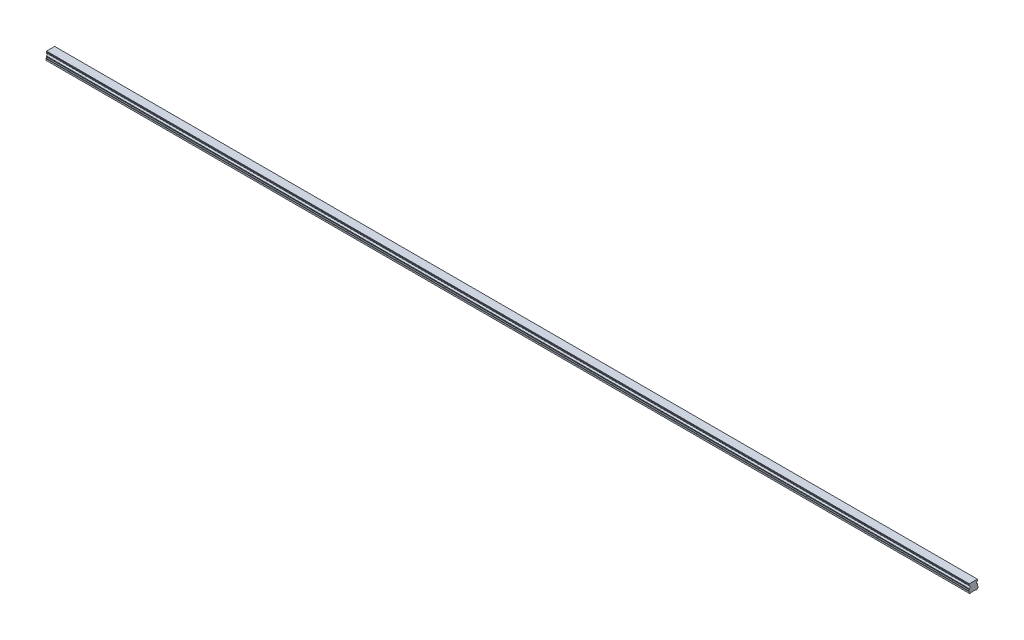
ISO-10303-21;
HEADER;
FILE_DESCRIPTION(('STEP AP214'),'2;1');
FILE_NAME('part.step','',(''),(''),'','','');
FILE_SCHEMA(('AUTOMOTIVE_DESIGN { 1 0 10303 214 1 1 1 1 }'));
ENDSEC;
DATA;
#1=APPLICATION_CONTEXT('core data for automotive mechanical design processes');
#2=APPLICATION_PROTOCOL_DEFINITION('international standard','automotive_design',2000,#1);
#3=PRODUCT_CONTEXT('',#1,'mechanical');
#4=PRODUCT('Part','Part','',(#3));
#5=PRODUCT_RELATED_PRODUCT_CATEGORY('part','',(#4));
#6=PRODUCT_DEFINITION_FORMATION('','',#4);
#7=PRODUCT_DEFINITION_CONTEXT('part definition',#1,'design');
#8=PRODUCT_DEFINITION('design','',#6,#7);
#9=PRODUCT_DEFINITION_SHAPE('','',#8);
#10=(LENGTH_UNIT() NAMED_UNIT(*) SI_UNIT(.MILLI.,.METRE.));
#11=(NAMED_UNIT(*) PLANE_ANGLE_UNIT() SI_UNIT($,.RADIAN.));
#12=(NAMED_UNIT(*) SI_UNIT($,.STERADIAN.) SOLID_ANGLE_UNIT());
#13=UNCERTAINTY_MEASURE_WITH_UNIT(LENGTH_MEASURE(1.E-05),#10,'distance_accuracy_value','');
#14=(GEOMETRIC_REPRESENTATION_CONTEXT(3) GLOBAL_UNCERTAINTY_ASSIGNED_CONTEXT((#13)) GLOBAL_UNIT_ASSIGNED_CONTEXT((#10,
#11,#12)) REPRESENTATION_CONTEXT('',''));
#15=CARTESIAN_POINT('',(0.,0.,0.));
#16=DIRECTION('',(0.,0.,1.));
#17=DIRECTION('',(1.,0.,0.));
#18=AXIS2_PLACEMENT_3D('',#15,#16,#17);
#19=CARTESIAN_POINT('',(1470.,0.399999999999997,0.));
#20=DIRECTION('',(0.,-1.,0.));
#21=DIRECTION('',(0.,0.,-1.));
#22=AXIS2_PLACEMENT_3D('',#19,#20,#21);
#23=CONICAL_SURFACE('',#22,2.89999999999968,0.785398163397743);
#24=CARTESIAN_POINT('',(1470.,0.799999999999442,0.));
#25=DIRECTION('',(0.,1.,0.));
#26=DIRECTION('',(0.,0.,1.));
#27=AXIS2_PLACEMENT_3D('',#24,#25,#26);
#28=CIRCLE('',#27,2.5);
#29=CARTESIAN_POINT('',(1470.,0.799999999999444,2.5));
#30=VERTEX_POINT('',#29);
#31=EDGE_CURVE('E11',#30,#30,#28,.F.);
#32=ORIENTED_EDGE('',*,*,#31,.F.);
#33=EDGE_LOOP('',(#32));
#34=FACE_BOUND('',#33,.T.);
#35=CARTESIAN_POINT('',(1470.,0.399999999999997,0.));
#36=DIRECTION('',(0.,1.,0.));
#37=DIRECTION('',(0.,0.,1.));
#38=AXIS2_PLACEMENT_3D('',#35,#36,#37);
#39=CIRCLE('',#38,2.89999999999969);
#40=CARTESIAN_POINT('',(1470.,0.399999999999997,2.89999999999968));
#41=VERTEX_POINT('',#40);
#42=EDGE_CURVE('E697',#41,#41,#39,.T.);
#43=ORIENTED_EDGE('',*,*,#42,.F.);
#44=EDGE_LOOP('',(#43));
#45=FACE_BOUND('',#44,.T.);
#46=ADVANCED_FACE('F39',(#34,#45),#23,.F.);
#47=CARTESIAN_POINT('',(1470.,7.,0.));
#48=DIRECTION('',(0.,-1.,0.));
#49=DIRECTION('',(0.,0.,-1.));
#50=AXIS2_PLACEMENT_3D('',#47,#48,#49);
#51=CYLINDRICAL_SURFACE('',#50,2.5);
#52=ORIENTED_EDGE('',*,*,#31,.T.);
#53=EDGE_LOOP('',(#52));
#54=FACE_BOUND('',#53,.T.);
#55=CARTESIAN_POINT('',(1470.,7.,0.));
#56=DIRECTION('',(0.,-1.,0.));
#57=DIRECTION('',(0.,0.,-1.));
#58=AXIS2_PLACEMENT_3D('',#55,#56,#57);
#59=CIRCLE('',#58,2.5);
#60=CARTESIAN_POINT('',(1470.,7.,-2.50000000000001));
#61=VERTEX_POINT('',#60);
#62=EDGE_CURVE('E49',#61,#61,#59,.T.);
#63=ORIENTED_EDGE('',*,*,#62,.F.);
#64=EDGE_LOOP('',(#63));
#65=FACE_BOUND('',#64,.T.);
#66=ADVANCED_FACE('F998',(#54,#65),#51,.F.);
#67=CARTESIAN_POINT('',(1470.,7.,0.));
#68=DIRECTION('',(0.,-1.,0.));
#69=DIRECTION('',(0.,0.,-1.));
#70=AXIS2_PLACEMENT_3D('',#67,#68,#69);
#71=PLANE('',#70);
#72=CARTESIAN_POINT('',(1470.,7.,0.));
#73=DIRECTION('',(0.,-1.,0.));
#74=DIRECTION('',(0.,0.,-1.));
#75=AXIS2_PLACEMENT_3D('',#72,#73,#74);
#76=CIRCLE('',#75,2.1);
#77=CARTESIAN_POINT('',(1470.,7.,-2.1));
#78=VERTEX_POINT('',#77);
#79=EDGE_CURVE('E42',#78,#78,#76,.T.);
#80=ORIENTED_EDGE('',*,*,#79,.F.);
#81=EDGE_LOOP('',(#80));
#82=FACE_BOUND('',#81,.T.);
#83=ORIENTED_EDGE('',*,*,#62,.T.);
#84=EDGE_LOOP('',(#83));
#85=FACE_BOUND('',#84,.T.);
#86=ADVANCED_FACE('F1003',(#82,#85),#71,.T.);
#87=CARTESIAN_POINT('',(1410.,0.399999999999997,0.));
#88=DIRECTION('',(0.,-1.,0.));
#89=DIRECTION('',(0.,0.,-1.));
#90=AXIS2_PLACEMENT_3D('',#87,#88,#89);
#91=CONICAL_SURFACE('',#90,2.89999999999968,0.785398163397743);
#92=CARTESIAN_POINT('',(1410.,0.799999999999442,0.));
#93=DIRECTION('',(0.,1.,0.));
#94=DIRECTION('',(0.,0.,1.));
#95=AXIS2_PLACEMENT_3D('',#92,#93,#94);
#96=CIRCLE('',#95,2.5);
#97=CARTESIAN_POINT('',(1410.,0.799999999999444,2.5));
#98=VERTEX_POINT('',#97);
#99=EDGE_CURVE('E693',#98,#98,#96,.F.);
#100=ORIENTED_EDGE('',*,*,#99,.F.);
#101=EDGE_LOOP('',(#100));
#102=FACE_BOUND('',#101,.T.);
#103=CARTESIAN_POINT('',(1410.,0.399999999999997,0.));
#104=DIRECTION('',(0.,1.,0.));
#105=DIRECTION('',(0.,0.,1.));
#106=AXIS2_PLACEMENT_3D('',#103,#104,#105);
#107=CIRCLE('',#106,2.89999999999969);
#108=CARTESIAN_POINT('',(1410.,0.399999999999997,2.89999999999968));
#109=VERTEX_POINT('',#108);
#110=EDGE_CURVE('E685',#109,#109,#107,.T.);
#111=ORIENTED_EDGE('',*,*,#110,.F.);
#112=EDGE_LOOP('',(#111));
#113=FACE_BOUND('',#112,.T.);
#114=ADVANCED_FACE('F1342',(#102,#113),#91,.F.);
#115=CARTESIAN_POINT('',(1410.,7.,0.));
#116=DIRECTION('',(0.,-1.,0.));
#117=DIRECTION('',(0.,0.,-1.));
#118=AXIS2_PLACEMENT_3D('',#115,#116,#117);
#119=CYLINDRICAL_SURFACE('',#118,2.5);
#120=ORIENTED_EDGE('',*,*,#99,.T.);
#121=EDGE_LOOP('',(#120));
#122=FACE_BOUND('',#121,.T.);
#123=CARTESIAN_POINT('',(1410.,7.,0.));
#124=DIRECTION('',(0.,-1.,0.));
#125=DIRECTION('',(0.,0.,-1.));
#126=AXIS2_PLACEMENT_3D('',#123,#124,#125);
#127=CIRCLE('',#126,2.5);
#128=CARTESIAN_POINT('',(1410.,7.,-2.50000000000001));
#129=VERTEX_POINT('',#128);
#130=EDGE_CURVE('E689',#129,#129,#127,.T.);
#131=ORIENTED_EDGE('',*,*,#130,.F.);
#132=EDGE_LOOP('',(#131));
#133=FACE_BOUND('',#132,.T.);
#134=ADVANCED_FACE('F1338',(#122,#133),#119,.F.);
#135=CARTESIAN_POINT('',(1410.,7.,0.));
#136=DIRECTION('',(0.,-1.,0.));
#137=DIRECTION('',(0.,0.,-1.));
#138=AXIS2_PLACEMENT_3D('',#135,#136,#137);
#139=PLANE('',#138);
#140=CARTESIAN_POINT('',(1410.,7.,0.));
#141=DIRECTION('',(0.,-1.,0.));
#142=DIRECTION('',(0.,0.,-1.));
#143=AXIS2_PLACEMENT_3D('',#140,#141,#142);
#144=CIRCLE('',#143,2.1);
#145=CARTESIAN_POINT('',(1410.,7.,-2.1));
#146=VERTEX_POINT('',#145);
#147=EDGE_CURVE('E792',#146,#146,#144,.T.);
#148=ORIENTED_EDGE('',*,*,#147,.F.);
#149=EDGE_LOOP('',(#148));
#150=FACE_BOUND('',#149,.T.);
#151=ORIENTED_EDGE('',*,*,#130,.T.);
#152=EDGE_LOOP('',(#151));
#153=FACE_BOUND('',#152,.T.);
#154=ADVANCED_FACE('F1334',(#150,#153),#139,.T.);
#155=CARTESIAN_POINT('',(1350.,0.399999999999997,0.));
#156=DIRECTION('',(0.,-1.,0.));
#157=DIRECTION('',(0.,0.,-1.));
#158=AXIS2_PLACEMENT_3D('',#155,#156,#157);
#159=CONICAL_SURFACE('',#158,2.89999999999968,0.785398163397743);
#160=CARTESIAN_POINT('',(1350.,0.799999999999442,0.));
#161=DIRECTION('',(0.,1.,0.));
#162=DIRECTION('',(0.,0.,1.));
#163=AXIS2_PLACEMENT_3D('',#160,#161,#162);
#164=CIRCLE('',#163,2.5);
#165=CARTESIAN_POINT('',(1350.,0.799999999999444,2.5));
#166=VERTEX_POINT('',#165);
#167=EDGE_CURVE('E681',#166,#166,#164,.F.);
#168=ORIENTED_EDGE('',*,*,#167,.F.);
#169=EDGE_LOOP('',(#168));
#170=FACE_BOUND('',#169,.T.);
#171=CARTESIAN_POINT('',(1350.,0.399999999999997,0.));
#172=DIRECTION('',(0.,1.,0.));
#173=DIRECTION('',(0.,0.,1.));
#174=AXIS2_PLACEMENT_3D('',#171,#172,#173);
#175=CIRCLE('',#174,2.89999999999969);
#176=CARTESIAN_POINT('',(1350.,0.399999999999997,2.89999999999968));
#177=VERTEX_POINT('',#176);
#178=EDGE_CURVE('E673',#177,#177,#175,.T.);
#179=ORIENTED_EDGE('',*,*,#178,.F.);
#180=EDGE_LOOP('',(#179));
#181=FACE_BOUND('',#180,.T.);
#182=ADVANCED_FACE('F1330',(#170,#181),#159,.F.);
#183=CARTESIAN_POINT('',(1350.,7.,0.));
#184=DIRECTION('',(0.,-1.,0.));
#185=DIRECTION('',(0.,0.,-1.));
#186=AXIS2_PLACEMENT_3D('',#183,#184,#185);
#187=CYLINDRICAL_SURFACE('',#186,2.5);
#188=ORIENTED_EDGE('',*,*,#167,.T.);
#189=EDGE_LOOP('',(#188));
#190=FACE_BOUND('',#189,.T.);
#191=CARTESIAN_POINT('',(1350.,7.,0.));
#192=DIRECTION('',(0.,-1.,0.));
#193=DIRECTION('',(0.,0.,-1.));
#194=AXIS2_PLACEMENT_3D('',#191,#192,#193);
#195=CIRCLE('',#194,2.5);
#196=CARTESIAN_POINT('',(1350.,7.,-2.50000000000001));
#197=VERTEX_POINT('',#196);
#198=EDGE_CURVE('E677',#197,#197,#195,.T.);
#199=ORIENTED_EDGE('',*,*,#198,.F.);
#200=EDGE_LOOP('',(#199));
#201=FACE_BOUND('',#200,.T.);
#202=ADVANCED_FACE('F1326',(#190,#201),#187,.F.);
#203=CARTESIAN_POINT('',(1350.,7.,0.));
#204=DIRECTION('',(0.,-1.,0.));
#205=DIRECTION('',(0.,0.,-1.));
#206=AXIS2_PLACEMENT_3D('',#203,#204,#205);
#207=PLANE('',#206);
#208=CARTESIAN_POINT('',(1350.,7.,0.));
#209=DIRECTION('',(0.,-1.,0.));
#210=DIRECTION('',(0.,0.,-1.));
#211=AXIS2_PLACEMENT_3D('',#208,#209,#210);
#212=CIRCLE('',#211,2.1);
#213=CARTESIAN_POINT('',(1350.,7.,-2.1));
#214=VERTEX_POINT('',#213);
#215=EDGE_CURVE('E789',#214,#214,#212,.T.);
#216=ORIENTED_EDGE('',*,*,#215,.F.);
#217=EDGE_LOOP('',(#216));
#218=FACE_BOUND('',#217,.T.);
#219=ORIENTED_EDGE('',*,*,#198,.T.);
#220=EDGE_LOOP('',(#219));
#221=FACE_BOUND('',#220,.T.);
#222=ADVANCED_FACE('F1322',(#218,#221),#207,.T.);
#223=CARTESIAN_POINT('',(1290.,0.399999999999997,0.));
#224=DIRECTION('',(0.,-1.,0.));
#225=DIRECTION('',(0.,0.,-1.));
#226=AXIS2_PLACEMENT_3D('',#223,#224,#225);
#227=CONICAL_SURFACE('',#226,2.89999999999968,0.785398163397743);
#228=CARTESIAN_POINT('',(1290.,0.799999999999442,0.));
#229=DIRECTION('',(0.,1.,0.));
#230=DIRECTION('',(0.,0.,1.));
#231=AXIS2_PLACEMENT_3D('',#228,#229,#230);
#232=CIRCLE('',#231,2.5);
#233=CARTESIAN_POINT('',(1290.,0.799999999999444,2.5));
#234=VERTEX_POINT('',#233);
#235=EDGE_CURVE('E669',#234,#234,#232,.F.);
#236=ORIENTED_EDGE('',*,*,#235,.F.);
#237=EDGE_LOOP('',(#236));
#238=FACE_BOUND('',#237,.T.);
#239=CARTESIAN_POINT('',(1290.,0.399999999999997,0.));
#240=DIRECTION('',(0.,1.,0.));
#241=DIRECTION('',(0.,0.,1.));
#242=AXIS2_PLACEMENT_3D('',#239,#240,#241);
#243=CIRCLE('',#242,2.89999999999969);
#244=CARTESIAN_POINT('',(1290.,0.399999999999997,2.89999999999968));
#245=VERTEX_POINT('',#244);
#246=EDGE_CURVE('E661',#245,#245,#243,.T.);
#247=ORIENTED_EDGE('',*,*,#246,.F.);
#248=EDGE_LOOP('',(#247));
#249=FACE_BOUND('',#248,.T.);
#250=ADVANCED_FACE('F1318',(#238,#249),#227,.F.);
#251=CARTESIAN_POINT('',(1290.,7.,0.));
#252=DIRECTION('',(0.,-1.,0.));
#253=DIRECTION('',(0.,0.,-1.));
#254=AXIS2_PLACEMENT_3D('',#251,#252,#253);
#255=CYLINDRICAL_SURFACE('',#254,2.5);
#256=ORIENTED_EDGE('',*,*,#235,.T.);
#257=EDGE_LOOP('',(#256));
#258=FACE_BOUND('',#257,.T.);
#259=CARTESIAN_POINT('',(1290.,7.,0.));
#260=DIRECTION('',(0.,-1.,0.));
#261=DIRECTION('',(0.,0.,-1.));
#262=AXIS2_PLACEMENT_3D('',#259,#260,#261);
#263=CIRCLE('',#262,2.5);
#264=CARTESIAN_POINT('',(1290.,7.,-2.50000000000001));
#265=VERTEX_POINT('',#264);
#266=EDGE_CURVE('E665',#265,#265,#263,.T.);
#267=ORIENTED_EDGE('',*,*,#266,.F.);
#268=EDGE_LOOP('',(#267));
#269=FACE_BOUND('',#268,.T.);
#270=ADVANCED_FACE('F1314',(#258,#269),#255,.F.);
#271=CARTESIAN_POINT('',(1290.,7.,0.));
#272=DIRECTION('',(0.,-1.,0.));
#273=DIRECTION('',(0.,0.,-1.));
#274=AXIS2_PLACEMENT_3D('',#271,#272,#273);
#275=PLANE('',#274);
#276=CARTESIAN_POINT('',(1290.,7.,0.));
#277=DIRECTION('',(0.,-1.,0.));
#278=DIRECTION('',(0.,0.,-1.));
#279=AXIS2_PLACEMENT_3D('',#276,#277,#278);
#280=CIRCLE('',#279,2.1);
#281=CARTESIAN_POINT('',(1290.,7.,-2.1));
#282=VERTEX_POINT('',#281);
#283=EDGE_CURVE('E785',#282,#282,#280,.T.);
#284=ORIENTED_EDGE('',*,*,#283,.F.);
#285=EDGE_LOOP('',(#284));
#286=FACE_BOUND('',#285,.T.);
#287=ORIENTED_EDGE('',*,*,#266,.T.);
#288=EDGE_LOOP('',(#287));
#289=FACE_BOUND('',#288,.T.);
#290=ADVANCED_FACE('F1310',(#286,#289),#275,.T.);
#291=CARTESIAN_POINT('',(1230.,0.399999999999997,0.));
#292=DIRECTION('',(0.,-1.,0.));
#293=DIRECTION('',(0.,0.,-1.));
#294=AXIS2_PLACEMENT_3D('',#291,#292,#293);
#295=CONICAL_SURFACE('',#294,2.89999999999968,0.785398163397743);
#296=CARTESIAN_POINT('',(1230.,0.799999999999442,0.));
#297=DIRECTION('',(0.,1.,0.));
#298=DIRECTION('',(0.,0.,1.));
#299=AXIS2_PLACEMENT_3D('',#296,#297,#298);
#300=CIRCLE('',#299,2.5);
#301=CARTESIAN_POINT('',(1230.,0.799999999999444,2.5));
#302=VERTEX_POINT('',#301);
#303=EDGE_CURVE('E657',#302,#302,#300,.F.);
#304=ORIENTED_EDGE('',*,*,#303,.F.);
#305=EDGE_LOOP('',(#304));
#306=FACE_BOUND('',#305,.T.);
#307=CARTESIAN_POINT('',(1230.,0.399999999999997,0.));
#308=DIRECTION('',(0.,1.,0.));
#309=DIRECTION('',(0.,0.,1.));
#310=AXIS2_PLACEMENT_3D('',#307,#308,#309);
#311=CIRCLE('',#310,2.89999999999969);
#312=CARTESIAN_POINT('',(1230.,0.399999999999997,2.89999999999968));
#313=VERTEX_POINT('',#312);
#314=EDGE_CURVE('E649',#313,#313,#311,.T.);
#315=ORIENTED_EDGE('',*,*,#314,.F.);
#316=EDGE_LOOP('',(#315));
#317=FACE_BOUND('',#316,.T.);
#318=ADVANCED_FACE('F1306',(#306,#317),#295,.F.);
#319=CARTESIAN_POINT('',(1230.,7.,0.));
#320=DIRECTION('',(0.,-1.,0.));
#321=DIRECTION('',(0.,0.,-1.));
#322=AXIS2_PLACEMENT_3D('',#319,#320,#321);
#323=CYLINDRICAL_SURFACE('',#322,2.5);
#324=ORIENTED_EDGE('',*,*,#303,.T.);
#325=EDGE_LOOP('',(#324));
#326=FACE_BOUND('',#325,.T.);
#327=CARTESIAN_POINT('',(1230.,7.,0.));
#328=DIRECTION('',(0.,-1.,0.));
#329=DIRECTION('',(0.,0.,-1.));
#330=AXIS2_PLACEMENT_3D('',#327,#328,#329);
#331=CIRCLE('',#330,2.5);
#332=CARTESIAN_POINT('',(1230.,7.,-2.50000000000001));
#333=VERTEX_POINT('',#332);
#334=EDGE_CURVE('E653',#333,#333,#331,.T.);
#335=ORIENTED_EDGE('',*,*,#334,.F.);
#336=EDGE_LOOP('',(#335));
#337=FACE_BOUND('',#336,.T.);
#338=ADVANCED_FACE('F1302',(#326,#337),#323,.F.);
#339=CARTESIAN_POINT('',(1230.,7.,0.));
#340=DIRECTION('',(0.,-1.,0.));
#341=DIRECTION('',(0.,0.,-1.));
#342=AXIS2_PLACEMENT_3D('',#339,#340,#341);
#343=PLANE('',#342);
#344=CARTESIAN_POINT('',(1230.,7.,0.));
#345=DIRECTION('',(0.,-1.,0.));
#346=DIRECTION('',(0.,0.,-1.));
#347=AXIS2_PLACEMENT_3D('',#344,#345,#346);
#348=CIRCLE('',#347,2.1);
#349=CARTESIAN_POINT('',(1230.,7.,-2.1));
#350=VERTEX_POINT('',#349);
#351=EDGE_CURVE('E781',#350,#350,#348,.T.);
#352=ORIENTED_EDGE('',*,*,#351,.F.);
#353=EDGE_LOOP('',(#352));
#354=FACE_BOUND('',#353,.T.);
#355=ORIENTED_EDGE('',*,*,#334,.T.);
#356=EDGE_LOOP('',(#355));
#357=FACE_BOUND('',#356,.T.);
#358=ADVANCED_FACE('F1298',(#354,#357),#343,.T.);
#359=CARTESIAN_POINT('',(1170.,0.399999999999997,0.));
#360=DIRECTION('',(0.,-1.,0.));
#361=DIRECTION('',(0.,0.,-1.));
#362=AXIS2_PLACEMENT_3D('',#359,#360,#361);
#363=CONICAL_SURFACE('',#362,2.89999999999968,0.785398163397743);
#364=CARTESIAN_POINT('',(1170.,0.799999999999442,0.));
#365=DIRECTION('',(0.,1.,0.));
#366=DIRECTION('',(0.,0.,1.));
#367=AXIS2_PLACEMENT_3D('',#364,#365,#366);
#368=CIRCLE('',#367,2.5);
#369=CARTESIAN_POINT('',(1170.,0.799999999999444,2.5));
#370=VERTEX_POINT('',#369);
#371=EDGE_CURVE('E645',#370,#370,#368,.F.);
#372=ORIENTED_EDGE('',*,*,#371,.F.);
#373=EDGE_LOOP('',(#372));
#374=FACE_BOUND('',#373,.T.);
#375=CARTESIAN_POINT('',(1170.,0.399999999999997,0.));
#376=DIRECTION('',(0.,1.,0.));
#377=DIRECTION('',(0.,0.,1.));
#378=AXIS2_PLACEMENT_3D('',#375,#376,#377);
#379=CIRCLE('',#378,2.89999999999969);
#380=CARTESIAN_POINT('',(1170.,0.399999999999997,2.89999999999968));
#381=VERTEX_POINT('',#380);
#382=EDGE_CURVE('E637',#381,#381,#379,.T.);
#383=ORIENTED_EDGE('',*,*,#382,.F.);
#384=EDGE_LOOP('',(#383));
#385=FACE_BOUND('',#384,.T.);
#386=ADVANCED_FACE('F1294',(#374,#385),#363,.F.);
#387=CARTESIAN_POINT('',(1170.,7.,0.));
#388=DIRECTION('',(0.,-1.,0.));
#389=DIRECTION('',(0.,0.,-1.));
#390=AXIS2_PLACEMENT_3D('',#387,#388,#389);
#391=CYLINDRICAL_SURFACE('',#390,2.5);
#392=ORIENTED_EDGE('',*,*,#371,.T.);
#393=EDGE_LOOP('',(#392));
#394=FACE_BOUND('',#393,.T.);
#395=CARTESIAN_POINT('',(1170.,7.,0.));
#396=DIRECTION('',(0.,-1.,0.));
#397=DIRECTION('',(0.,0.,-1.));
#398=AXIS2_PLACEMENT_3D('',#395,#396,#397);
#399=CIRCLE('',#398,2.5);
#400=CARTESIAN_POINT('',(1170.,7.,-2.50000000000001));
#401=VERTEX_POINT('',#400);
#402=EDGE_CURVE('E641',#401,#401,#399,.T.);
#403=ORIENTED_EDGE('',*,*,#402,.F.);
#404=EDGE_LOOP('',(#403));
#405=FACE_BOUND('',#404,.T.);
#406=ADVANCED_FACE('F1290',(#394,#405),#391,.F.);
#407=CARTESIAN_POINT('',(1170.,7.,0.));
#408=DIRECTION('',(0.,-1.,0.));
#409=DIRECTION('',(0.,0.,-1.));
#410=AXIS2_PLACEMENT_3D('',#407,#408,#409);
#411=PLANE('',#410);
#412=CARTESIAN_POINT('',(1170.,7.,0.));
#413=DIRECTION('',(0.,-1.,0.));
#414=DIRECTION('',(0.,0.,-1.));
#415=AXIS2_PLACEMENT_3D('',#412,#413,#414);
#416=CIRCLE('',#415,2.1);
#417=CARTESIAN_POINT('',(1170.,7.,-2.1));
#418=VERTEX_POINT('',#417);
#419=EDGE_CURVE('E777',#418,#418,#416,.T.);
#420=ORIENTED_EDGE('',*,*,#419,.F.);
#421=EDGE_LOOP('',(#420));
#422=FACE_BOUND('',#421,.T.);
#423=ORIENTED_EDGE('',*,*,#402,.T.);
#424=EDGE_LOOP('',(#423));
#425=FACE_BOUND('',#424,.T.);
#426=ADVANCED_FACE('F1286',(#422,#425),#411,.T.);
#427=CARTESIAN_POINT('',(1110.,0.399999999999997,0.));
#428=DIRECTION('',(0.,-1.,0.));
#429=DIRECTION('',(0.,0.,-1.));
#430=AXIS2_PLACEMENT_3D('',#427,#428,#429);
#431=CONICAL_SURFACE('',#430,2.89999999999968,0.785398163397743);
#432=CARTESIAN_POINT('',(1110.,0.799999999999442,0.));
#433=DIRECTION('',(0.,1.,0.));
#434=DIRECTION('',(0.,0.,1.));
#435=AXIS2_PLACEMENT_3D('',#432,#433,#434);
#436=CIRCLE('',#435,2.5);
#437=CARTESIAN_POINT('',(1110.,0.799999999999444,2.5));
#438=VERTEX_POINT('',#437);
#439=EDGE_CURVE('E633',#438,#438,#436,.F.);
#440=ORIENTED_EDGE('',*,*,#439,.F.);
#441=EDGE_LOOP('',(#440));
#442=FACE_BOUND('',#441,.T.);
#443=CARTESIAN_POINT('',(1110.,0.399999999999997,0.));
#444=DIRECTION('',(0.,1.,0.));
#445=DIRECTION('',(0.,0.,1.));
#446=AXIS2_PLACEMENT_3D('',#443,#444,#445);
#447=CIRCLE('',#446,2.89999999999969);
#448=CARTESIAN_POINT('',(1110.,0.399999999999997,2.89999999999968));
#449=VERTEX_POINT('',#448);
#450=EDGE_CURVE('E625',#449,#449,#447,.T.);
#451=ORIENTED_EDGE('',*,*,#450,.F.);
#452=EDGE_LOOP('',(#451));
#453=FACE_BOUND('',#452,.T.);
#454=ADVANCED_FACE('F1282',(#442,#453),#431,.F.);
#455=CARTESIAN_POINT('',(1110.,7.,0.));
#456=DIRECTION('',(0.,-1.,0.));
#457=DIRECTION('',(0.,0.,-1.));
#458=AXIS2_PLACEMENT_3D('',#455,#456,#457);
#459=CYLINDRICAL_SURFACE('',#458,2.5);
#460=ORIENTED_EDGE('',*,*,#439,.T.);
#461=EDGE_LOOP('',(#460));
#462=FACE_BOUND('',#461,.T.);
#463=CARTESIAN_POINT('',(1110.,7.,0.));
#464=DIRECTION('',(0.,-1.,0.));
#465=DIRECTION('',(0.,0.,-1.));
#466=AXIS2_PLACEMENT_3D('',#463,#464,#465);
#467=CIRCLE('',#466,2.5);
#468=CARTESIAN_POINT('',(1110.,7.,-2.50000000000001));
#469=VERTEX_POINT('',#468);
#470=EDGE_CURVE('E629',#469,#469,#467,.T.);
#471=ORIENTED_EDGE('',*,*,#470,.F.);
#472=EDGE_LOOP('',(#471));
#473=FACE_BOUND('',#472,.T.);
#474=ADVANCED_FACE('F1278',(#462,#473),#459,.F.);
#475=CARTESIAN_POINT('',(1110.,7.,0.));
#476=DIRECTION('',(0.,-1.,0.));
#477=DIRECTION('',(0.,0.,-1.));
#478=AXIS2_PLACEMENT_3D('',#475,#476,#477);
#479=PLANE('',#478);
#480=CARTESIAN_POINT('',(1110.,7.,0.));
#481=DIRECTION('',(0.,-1.,0.));
#482=DIRECTION('',(0.,0.,-1.));
#483=AXIS2_PLACEMENT_3D('',#480,#481,#482);
#484=CIRCLE('',#483,2.1);
#485=CARTESIAN_POINT('',(1110.,7.,-2.1));
#486=VERTEX_POINT('',#485);
#487=EDGE_CURVE('E773',#486,#486,#484,.T.);
#488=ORIENTED_EDGE('',*,*,#487,.F.);
#489=EDGE_LOOP('',(#488));
#490=FACE_BOUND('',#489,.T.);
#491=ORIENTED_EDGE('',*,*,#470,.T.);
#492=EDGE_LOOP('',(#491));
#493=FACE_BOUND('',#492,.T.);
#494=ADVANCED_FACE('F1274',(#490,#493),#479,.T.);
#495=CARTESIAN_POINT('',(1050.,0.399999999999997,0.));
#496=DIRECTION('',(0.,-1.,0.));
#497=DIRECTION('',(0.,0.,-1.));
#498=AXIS2_PLACEMENT_3D('',#495,#496,#497);
#499=CONICAL_SURFACE('',#498,2.89999999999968,0.785398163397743);
#500=CARTESIAN_POINT('',(1050.,0.799999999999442,0.));
#501=DIRECTION('',(0.,1.,0.));
#502=DIRECTION('',(0.,0.,1.));
#503=AXIS2_PLACEMENT_3D('',#500,#501,#502);
#504=CIRCLE('',#503,2.5);
#505=CARTESIAN_POINT('',(1050.,0.799999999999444,2.5));
#506=VERTEX_POINT('',#505);
#507=EDGE_CURVE('E621',#506,#506,#504,.F.);
#508=ORIENTED_EDGE('',*,*,#507,.F.);
#509=EDGE_LOOP('',(#508));
#510=FACE_BOUND('',#509,.T.);
#511=CARTESIAN_POINT('',(1050.,0.399999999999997,0.));
#512=DIRECTION('',(0.,1.,0.));
#513=DIRECTION('',(0.,0.,1.));
#514=AXIS2_PLACEMENT_3D('',#511,#512,#513);
#515=CIRCLE('',#514,2.89999999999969);
#516=CARTESIAN_POINT('',(1050.,0.399999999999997,2.89999999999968));
#517=VERTEX_POINT('',#516);
#518=EDGE_CURVE('E613',#517,#517,#515,.T.);
#519=ORIENTED_EDGE('',*,*,#518,.F.);
#520=EDGE_LOOP('',(#519));
#521=FACE_BOUND('',#520,.T.);
#522=ADVANCED_FACE('F1270',(#510,#521),#499,.F.);
#523=CARTESIAN_POINT('',(1050.,7.,0.));
#524=DIRECTION('',(0.,-1.,0.));
#525=DIRECTION('',(0.,0.,-1.));
#526=AXIS2_PLACEMENT_3D('',#523,#524,#525);
#527=CYLINDRICAL_SURFACE('',#526,2.5);
#528=ORIENTED_EDGE('',*,*,#507,.T.);
#529=EDGE_LOOP('',(#528));
#530=FACE_BOUND('',#529,.T.);
#531=CARTESIAN_POINT('',(1050.,7.,0.));
#532=DIRECTION('',(0.,-1.,0.));
#533=DIRECTION('',(0.,0.,-1.));
#534=AXIS2_PLACEMENT_3D('',#531,#532,#533);
#535=CIRCLE('',#534,2.5);
#536=CARTESIAN_POINT('',(1050.,7.,-2.50000000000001));
#537=VERTEX_POINT('',#536);
#538=EDGE_CURVE('E617',#537,#537,#535,.T.);
#539=ORIENTED_EDGE('',*,*,#538,.F.);
#540=EDGE_LOOP('',(#539));
#541=FACE_BOUND('',#540,.T.);
#542=ADVANCED_FACE('F1266',(#530,#541),#527,.F.);
#543=CARTESIAN_POINT('',(1050.,7.,0.));
#544=DIRECTION('',(0.,-1.,0.));
#545=DIRECTION('',(0.,0.,-1.));
#546=AXIS2_PLACEMENT_3D('',#543,#544,#545);
#547=PLANE('',#546);
#548=CARTESIAN_POINT('',(1050.,7.,0.));
#549=DIRECTION('',(0.,-1.,0.));
#550=DIRECTION('',(0.,0.,-1.));
#551=AXIS2_PLACEMENT_3D('',#548,#549,#550);
#552=CIRCLE('',#551,2.1);
#553=CARTESIAN_POINT('',(1050.,7.,-2.1));
#554=VERTEX_POINT('',#553);
#555=EDGE_CURVE('E769',#554,#554,#552,.T.);
#556=ORIENTED_EDGE('',*,*,#555,.F.);
#557=EDGE_LOOP('',(#556));
#558=FACE_BOUND('',#557,.T.);
#559=ORIENTED_EDGE('',*,*,#538,.T.);
#560=EDGE_LOOP('',(#559));
#561=FACE_BOUND('',#560,.T.);
#562=ADVANCED_FACE('F1262',(#558,#561),#547,.T.);
#563=CARTESIAN_POINT('',(990.,0.399999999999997,0.));
#564=DIRECTION('',(0.,-1.,0.));
#565=DIRECTION('',(0.,0.,-1.));
#566=AXIS2_PLACEMENT_3D('',#563,#564,#565);
#567=CONICAL_SURFACE('',#566,2.89999999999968,0.785398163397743);
#568=CARTESIAN_POINT('',(990.,0.799999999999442,0.));
#569=DIRECTION('',(0.,1.,0.));
#570=DIRECTION('',(0.,0.,1.));
#571=AXIS2_PLACEMENT_3D('',#568,#569,#570);
#572=CIRCLE('',#571,2.5);
#573=CARTESIAN_POINT('',(990.,0.799999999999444,2.5));
#574=VERTEX_POINT('',#573);
#575=EDGE_CURVE('E609',#574,#574,#572,.F.);
#576=ORIENTED_EDGE('',*,*,#575,.F.);
#577=EDGE_LOOP('',(#576));
#578=FACE_BOUND('',#577,.T.);
#579=CARTESIAN_POINT('',(990.,0.399999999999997,0.));
#580=DIRECTION('',(0.,1.,0.));
#581=DIRECTION('',(0.,0.,1.));
#582=AXIS2_PLACEMENT_3D('',#579,#580,#581);
#583=CIRCLE('',#582,2.89999999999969);
#584=CARTESIAN_POINT('',(990.,0.399999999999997,2.89999999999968));
#585=VERTEX_POINT('',#584);
#586=EDGE_CURVE('E601',#585,#585,#583,.T.);
#587=ORIENTED_EDGE('',*,*,#586,.F.);
#588=EDGE_LOOP('',(#587));
#589=FACE_BOUND('',#588,.T.);
#590=ADVANCED_FACE('F1258',(#578,#589),#567,.F.);
#591=CARTESIAN_POINT('',(990.,7.,0.));
#592=DIRECTION('',(0.,-1.,0.));
#593=DIRECTION('',(0.,0.,-1.));
#594=AXIS2_PLACEMENT_3D('',#591,#592,#593);
#595=CYLINDRICAL_SURFACE('',#594,2.5);
#596=ORIENTED_EDGE('',*,*,#575,.T.);
#597=EDGE_LOOP('',(#596));
#598=FACE_BOUND('',#597,.T.);
#599=CARTESIAN_POINT('',(990.,7.,0.));
#600=DIRECTION('',(0.,-1.,0.));
#601=DIRECTION('',(0.,0.,-1.));
#602=AXIS2_PLACEMENT_3D('',#599,#600,#601);
#603=CIRCLE('',#602,2.5);
#604=CARTESIAN_POINT('',(990.,7.,-2.50000000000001));
#605=VERTEX_POINT('',#604);
#606=EDGE_CURVE('E605',#605,#605,#603,.T.);
#607=ORIENTED_EDGE('',*,*,#606,.F.);
#608=EDGE_LOOP('',(#607));
#609=FACE_BOUND('',#608,.T.);
#610=ADVANCED_FACE('F1254',(#598,#609),#595,.F.);
#611=CARTESIAN_POINT('',(990.,7.,0.));
#612=DIRECTION('',(0.,-1.,0.));
#613=DIRECTION('',(0.,0.,-1.));
#614=AXIS2_PLACEMENT_3D('',#611,#612,#613);
#615=PLANE('',#614);
#616=CARTESIAN_POINT('',(990.,7.,0.));
#617=DIRECTION('',(0.,-1.,0.));
#618=DIRECTION('',(0.,0.,-1.));
#619=AXIS2_PLACEMENT_3D('',#616,#617,#618);
#620=CIRCLE('',#619,2.1);
#621=CARTESIAN_POINT('',(990.,7.,-2.1));
#622=VERTEX_POINT('',#621);
#623=EDGE_CURVE('E765',#622,#622,#620,.T.);
#624=ORIENTED_EDGE('',*,*,#623,.F.);
#625=EDGE_LOOP('',(#624));
#626=FACE_BOUND('',#625,.T.);
#627=ORIENTED_EDGE('',*,*,#606,.T.);
#628=EDGE_LOOP('',(#627));
#629=FACE_BOUND('',#628,.T.);
#630=ADVANCED_FACE('F1250',(#626,#629),#615,.T.);
#631=CARTESIAN_POINT('',(930.,0.399999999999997,0.));
#632=DIRECTION('',(0.,-1.,0.));
#633=DIRECTION('',(0.,0.,-1.));
#634=AXIS2_PLACEMENT_3D('',#631,#632,#633);
#635=CONICAL_SURFACE('',#634,2.89999999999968,0.785398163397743);
#636=CARTESIAN_POINT('',(930.,0.799999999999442,0.));
#637=DIRECTION('',(0.,1.,0.));
#638=DIRECTION('',(0.,0.,1.));
#639=AXIS2_PLACEMENT_3D('',#636,#637,#638);
#640=CIRCLE('',#639,2.5);
#641=CARTESIAN_POINT('',(930.,0.799999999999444,2.5));
#642=VERTEX_POINT('',#641);
#643=EDGE_CURVE('E597',#642,#642,#640,.F.);
#644=ORIENTED_EDGE('',*,*,#643,.F.);
#645=EDGE_LOOP('',(#644));
#646=FACE_BOUND('',#645,.T.);
#647=CARTESIAN_POINT('',(930.,0.399999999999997,0.));
#648=DIRECTION('',(0.,1.,0.));
#649=DIRECTION('',(0.,0.,1.));
#650=AXIS2_PLACEMENT_3D('',#647,#648,#649);
#651=CIRCLE('',#650,2.89999999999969);
#652=CARTESIAN_POINT('',(930.,0.399999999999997,2.89999999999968));
#653=VERTEX_POINT('',#652);
#654=EDGE_CURVE('E589',#653,#653,#651,.T.);
#655=ORIENTED_EDGE('',*,*,#654,.F.);
#656=EDGE_LOOP('',(#655));
#657=FACE_BOUND('',#656,.T.);
#658=ADVANCED_FACE('F1246',(#646,#657),#635,.F.);
#659=CARTESIAN_POINT('',(930.,7.,0.));
#660=DIRECTION('',(0.,-1.,0.));
#661=DIRECTION('',(0.,0.,-1.));
#662=AXIS2_PLACEMENT_3D('',#659,#660,#661);
#663=CYLINDRICAL_SURFACE('',#662,2.5);
#664=ORIENTED_EDGE('',*,*,#643,.T.);
#665=EDGE_LOOP('',(#664));
#666=FACE_BOUND('',#665,.T.);
#667=CARTESIAN_POINT('',(930.,7.,0.));
#668=DIRECTION('',(0.,-1.,0.));
#669=DIRECTION('',(0.,0.,-1.));
#670=AXIS2_PLACEMENT_3D('',#667,#668,#669);
#671=CIRCLE('',#670,2.5);
#672=CARTESIAN_POINT('',(930.,7.,-2.50000000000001));
#673=VERTEX_POINT('',#672);
#674=EDGE_CURVE('E593',#673,#673,#671,.T.);
#675=ORIENTED_EDGE('',*,*,#674,.F.);
#676=EDGE_LOOP('',(#675));
#677=FACE_BOUND('',#676,.T.);
#678=ADVANCED_FACE('F1242',(#666,#677),#663,.F.);
#679=CARTESIAN_POINT('',(930.,7.,0.));
#680=DIRECTION('',(0.,-1.,0.));
#681=DIRECTION('',(0.,0.,-1.));
#682=AXIS2_PLACEMENT_3D('',#679,#680,#681);
#683=PLANE('',#682);
#684=CARTESIAN_POINT('',(930.,7.,0.));
#685=DIRECTION('',(0.,-1.,0.));
#686=DIRECTION('',(0.,0.,-1.));
#687=AXIS2_PLACEMENT_3D('',#684,#685,#686);
#688=CIRCLE('',#687,2.1);
#689=CARTESIAN_POINT('',(930.,7.,-2.1));
#690=VERTEX_POINT('',#689);
#691=EDGE_CURVE('E761',#690,#690,#688,.T.);
#692=ORIENTED_EDGE('',*,*,#691,.F.);
#693=EDGE_LOOP('',(#692));
#694=FACE_BOUND('',#693,.T.);
#695=ORIENTED_EDGE('',*,*,#674,.T.);
#696=EDGE_LOOP('',(#695));
#697=FACE_BOUND('',#696,.T.);
#698=ADVANCED_FACE('F1238',(#694,#697),#683,.T.);
#699=CARTESIAN_POINT('',(870.,0.399999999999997,0.));
#700=DIRECTION('',(0.,-1.,0.));
#701=DIRECTION('',(0.,0.,-1.));
#702=AXIS2_PLACEMENT_3D('',#699,#700,#701);
#703=CONICAL_SURFACE('',#702,2.89999999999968,0.785398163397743);
#704=CARTESIAN_POINT('',(870.,0.799999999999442,0.));
#705=DIRECTION('',(0.,1.,0.));
#706=DIRECTION('',(0.,0.,1.));
#707=AXIS2_PLACEMENT_3D('',#704,#705,#706);
#708=CIRCLE('',#707,2.5);
#709=CARTESIAN_POINT('',(870.,0.799999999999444,2.5));
#710=VERTEX_POINT('',#709);
#711=EDGE_CURVE('E585',#710,#710,#708,.F.);
#712=ORIENTED_EDGE('',*,*,#711,.F.);
#713=EDGE_LOOP('',(#712));
#714=FACE_BOUND('',#713,.T.);
#715=CARTESIAN_POINT('',(870.,0.399999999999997,0.));
#716=DIRECTION('',(0.,1.,0.));
#717=DIRECTION('',(0.,0.,1.));
#718=AXIS2_PLACEMENT_3D('',#715,#716,#717);
#719=CIRCLE('',#718,2.89999999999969);
#720=CARTESIAN_POINT('',(870.,0.399999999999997,2.89999999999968));
#721=VERTEX_POINT('',#720);
#722=EDGE_CURVE('E577',#721,#721,#719,.T.);
#723=ORIENTED_EDGE('',*,*,#722,.F.);
#724=EDGE_LOOP('',(#723));
#725=FACE_BOUND('',#724,.T.);
#726=ADVANCED_FACE('F1234',(#714,#725),#703,.F.);
#727=CARTESIAN_POINT('',(870.,7.,0.));
#728=DIRECTION('',(0.,-1.,0.));
#729=DIRECTION('',(0.,0.,-1.));
#730=AXIS2_PLACEMENT_3D('',#727,#728,#729);
#731=CYLINDRICAL_SURFACE('',#730,2.5);
#732=ORIENTED_EDGE('',*,*,#711,.T.);
#733=EDGE_LOOP('',(#732));
#734=FACE_BOUND('',#733,.T.);
#735=CARTESIAN_POINT('',(870.,7.,0.));
#736=DIRECTION('',(0.,-1.,0.));
#737=DIRECTION('',(0.,0.,-1.));
#738=AXIS2_PLACEMENT_3D('',#735,#736,#737);
#739=CIRCLE('',#738,2.5);
#740=CARTESIAN_POINT('',(870.,7.,-2.50000000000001));
#741=VERTEX_POINT('',#740);
#742=EDGE_CURVE('E581',#741,#741,#739,.T.);
#743=ORIENTED_EDGE('',*,*,#742,.F.);
#744=EDGE_LOOP('',(#743));
#745=FACE_BOUND('',#744,.T.);
#746=ADVANCED_FACE('F1230',(#734,#745),#731,.F.);
#747=CARTESIAN_POINT('',(870.,7.,0.));
#748=DIRECTION('',(0.,-1.,0.));
#749=DIRECTION('',(0.,0.,-1.));
#750=AXIS2_PLACEMENT_3D('',#747,#748,#749);
#751=PLANE('',#750);
#752=CARTESIAN_POINT('',(870.,7.,0.));
#753=DIRECTION('',(0.,-1.,0.));
#754=DIRECTION('',(0.,0.,-1.));
#755=AXIS2_PLACEMENT_3D('',#752,#753,#754);
#756=CIRCLE('',#755,2.1);
#757=CARTESIAN_POINT('',(870.,7.,-2.1));
#758=VERTEX_POINT('',#757);
#759=EDGE_CURVE('E757',#758,#758,#756,.T.);
#760=ORIENTED_EDGE('',*,*,#759,.F.);
#761=EDGE_LOOP('',(#760));
#762=FACE_BOUND('',#761,.T.);
#763=ORIENTED_EDGE('',*,*,#742,.T.);
#764=EDGE_LOOP('',(#763));
#765=FACE_BOUND('',#764,.T.);
#766=ADVANCED_FACE('F1226',(#762,#765),#751,.T.);
#767=CARTESIAN_POINT('',(810.,0.399999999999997,0.));
#768=DIRECTION('',(0.,-1.,0.));
#769=DIRECTION('',(0.,0.,-1.));
#770=AXIS2_PLACEMENT_3D('',#767,#768,#769);
#771=CONICAL_SURFACE('',#770,2.89999999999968,0.785398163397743);
#772=CARTESIAN_POINT('',(810.,0.799999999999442,0.));
#773=DIRECTION('',(0.,1.,0.));
#774=DIRECTION('',(0.,0.,1.));
#775=AXIS2_PLACEMENT_3D('',#772,#773,#774);
#776=CIRCLE('',#775,2.5);
#777=CARTESIAN_POINT('',(810.,0.799999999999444,2.5));
#778=VERTEX_POINT('',#777);
#779=EDGE_CURVE('E573',#778,#778,#776,.F.);
#780=ORIENTED_EDGE('',*,*,#779,.F.);
#781=EDGE_LOOP('',(#780));
#782=FACE_BOUND('',#781,.T.);
#783=CARTESIAN_POINT('',(810.,0.399999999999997,0.));
#784=DIRECTION('',(0.,1.,0.));
#785=DIRECTION('',(0.,0.,1.));
#786=AXIS2_PLACEMENT_3D('',#783,#784,#785);
#787=CIRCLE('',#786,2.89999999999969);
#788=CARTESIAN_POINT('',(810.,0.399999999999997,2.89999999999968));
#789=VERTEX_POINT('',#788);
#790=EDGE_CURVE('E565',#789,#789,#787,.T.);
#791=ORIENTED_EDGE('',*,*,#790,.F.);
#792=EDGE_LOOP('',(#791));
#793=FACE_BOUND('',#792,.T.);
#794=ADVANCED_FACE('F1222',(#782,#793),#771,.F.);
#795=CARTESIAN_POINT('',(810.,7.,0.));
#796=DIRECTION('',(0.,-1.,0.));
#797=DIRECTION('',(0.,0.,-1.));
#798=AXIS2_PLACEMENT_3D('',#795,#796,#797);
#799=CYLINDRICAL_SURFACE('',#798,2.5);
#800=ORIENTED_EDGE('',*,*,#779,.T.);
#801=EDGE_LOOP('',(#800));
#802=FACE_BOUND('',#801,.T.);
#803=CARTESIAN_POINT('',(810.,7.,0.));
#804=DIRECTION('',(0.,-1.,0.));
#805=DIRECTION('',(0.,0.,-1.));
#806=AXIS2_PLACEMENT_3D('',#803,#804,#805);
#807=CIRCLE('',#806,2.5);
#808=CARTESIAN_POINT('',(810.,7.,-2.50000000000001));
#809=VERTEX_POINT('',#808);
#810=EDGE_CURVE('E569',#809,#809,#807,.T.);
#811=ORIENTED_EDGE('',*,*,#810,.F.);
#812=EDGE_LOOP('',(#811));
#813=FACE_BOUND('',#812,.T.);
#814=ADVANCED_FACE('F1218',(#802,#813),#799,.F.);
#815=CARTESIAN_POINT('',(810.,7.,0.));
#816=DIRECTION('',(0.,-1.,0.));
#817=DIRECTION('',(0.,0.,-1.));
#818=AXIS2_PLACEMENT_3D('',#815,#816,#817);
#819=PLANE('',#818);
#820=CARTESIAN_POINT('',(810.,7.,0.));
#821=DIRECTION('',(0.,-1.,0.));
#822=DIRECTION('',(0.,0.,-1.));
#823=AXIS2_PLACEMENT_3D('',#820,#821,#822);
#824=CIRCLE('',#823,2.1);
#825=CARTESIAN_POINT('',(810.,7.,-2.1));
#826=VERTEX_POINT('',#825);
#827=EDGE_CURVE('E753',#826,#826,#824,.T.);
#828=ORIENTED_EDGE('',*,*,#827,.F.);
#829=EDGE_LOOP('',(#828));
#830=FACE_BOUND('',#829,.T.);
#831=ORIENTED_EDGE('',*,*,#810,.T.);
#832=EDGE_LOOP('',(#831));
#833=FACE_BOUND('',#832,.T.);
#834=ADVANCED_FACE('F1214',(#830,#833),#819,.T.);
#835=CARTESIAN_POINT('',(750.,0.399999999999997,0.));
#836=DIRECTION('',(0.,-1.,0.));
#837=DIRECTION('',(0.,0.,-1.));
#838=AXIS2_PLACEMENT_3D('',#835,#836,#837);
#839=CONICAL_SURFACE('',#838,2.89999999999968,0.785398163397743);
#840=CARTESIAN_POINT('',(750.,0.799999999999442,0.));
#841=DIRECTION('',(0.,1.,0.));
#842=DIRECTION('',(0.,0.,1.));
#843=AXIS2_PLACEMENT_3D('',#840,#841,#842);
#844=CIRCLE('',#843,2.5);
#845=CARTESIAN_POINT('',(750.,0.799999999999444,2.5));
#846=VERTEX_POINT('',#845);
#847=EDGE_CURVE('E561',#846,#846,#844,.F.);
#848=ORIENTED_EDGE('',*,*,#847,.F.);
#849=EDGE_LOOP('',(#848));
#850=FACE_BOUND('',#849,.T.);
#851=CARTESIAN_POINT('',(750.,0.399999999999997,0.));
#852=DIRECTION('',(0.,1.,0.));
#853=DIRECTION('',(0.,0.,1.));
#854=AXIS2_PLACEMENT_3D('',#851,#852,#853);
#855=CIRCLE('',#854,2.89999999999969);
#856=CARTESIAN_POINT('',(750.,0.399999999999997,2.89999999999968));
#857=VERTEX_POINT('',#856);
#858=EDGE_CURVE('E553',#857,#857,#855,.T.);
#859=ORIENTED_EDGE('',*,*,#858,.F.);
#860=EDGE_LOOP('',(#859));
#861=FACE_BOUND('',#860,.T.);
#862=ADVANCED_FACE('F1210',(#850,#861),#839,.F.);
#863=CARTESIAN_POINT('',(750.,7.,0.));
#864=DIRECTION('',(0.,-1.,0.));
#865=DIRECTION('',(0.,0.,-1.));
#866=AXIS2_PLACEMENT_3D('',#863,#864,#865);
#867=CYLINDRICAL_SURFACE('',#866,2.5);
#868=ORIENTED_EDGE('',*,*,#847,.T.);
#869=EDGE_LOOP('',(#868));
#870=FACE_BOUND('',#869,.T.);
#871=CARTESIAN_POINT('',(750.,7.,0.));
#872=DIRECTION('',(0.,-1.,0.));
#873=DIRECTION('',(0.,0.,-1.));
#874=AXIS2_PLACEMENT_3D('',#871,#872,#873);
#875=CIRCLE('',#874,2.5);
#876=CARTESIAN_POINT('',(750.,7.,-2.50000000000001));
#877=VERTEX_POINT('',#876);
#878=EDGE_CURVE('E557',#877,#877,#875,.T.);
#879=ORIENTED_EDGE('',*,*,#878,.F.);
#880=EDGE_LOOP('',(#879));
#881=FACE_BOUND('',#880,.T.);
#882=ADVANCED_FACE('F1206',(#870,#881),#867,.F.);
#883=CARTESIAN_POINT('',(750.,7.,0.));
#884=DIRECTION('',(0.,-1.,0.));
#885=DIRECTION('',(0.,0.,-1.));
#886=AXIS2_PLACEMENT_3D('',#883,#884,#885);
#887=PLANE('',#886);
#888=CARTESIAN_POINT('',(750.,7.,0.));
#889=DIRECTION('',(0.,-1.,0.));
#890=DIRECTION('',(0.,0.,-1.));
#891=AXIS2_PLACEMENT_3D('',#888,#889,#890);
#892=CIRCLE('',#891,2.1);
#893=CARTESIAN_POINT('',(750.,7.,-2.1));
#894=VERTEX_POINT('',#893);
#895=EDGE_CURVE('E749',#894,#894,#892,.T.);
#896=ORIENTED_EDGE('',*,*,#895,.F.);
#897=EDGE_LOOP('',(#896));
#898=FACE_BOUND('',#897,.T.);
#899=ORIENTED_EDGE('',*,*,#878,.T.);
#900=EDGE_LOOP('',(#899));
#901=FACE_BOUND('',#900,.T.);
#902=ADVANCED_FACE('F1202',(#898,#901),#887,.T.);
#903=CARTESIAN_POINT('',(690.,0.399999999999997,0.));
#904=DIRECTION('',(0.,-1.,0.));
#905=DIRECTION('',(0.,0.,-1.));
#906=AXIS2_PLACEMENT_3D('',#903,#904,#905);
#907=CONICAL_SURFACE('',#906,2.89999999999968,0.785398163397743);
#908=CARTESIAN_POINT('',(690.,0.799999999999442,0.));
#909=DIRECTION('',(0.,1.,0.));
#910=DIRECTION('',(0.,0.,1.));
#911=AXIS2_PLACEMENT_3D('',#908,#909,#910);
#912=CIRCLE('',#911,2.5);
#913=CARTESIAN_POINT('',(690.,0.799999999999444,2.5));
#914=VERTEX_POINT('',#913);
#915=EDGE_CURVE('E549',#914,#914,#912,.F.);
#916=ORIENTED_EDGE('',*,*,#915,.F.);
#917=EDGE_LOOP('',(#916));
#918=FACE_BOUND('',#917,.T.);
#919=CARTESIAN_POINT('',(690.,0.399999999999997,0.));
#920=DIRECTION('',(0.,1.,0.));
#921=DIRECTION('',(0.,0.,1.));
#922=AXIS2_PLACEMENT_3D('',#919,#920,#921);
#923=CIRCLE('',#922,2.89999999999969);
#924=CARTESIAN_POINT('',(690.,0.399999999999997,2.89999999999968));
#925=VERTEX_POINT('',#924);
#926=EDGE_CURVE('E541',#925,#925,#923,.T.);
#927=ORIENTED_EDGE('',*,*,#926,.F.);
#928=EDGE_LOOP('',(#927));
#929=FACE_BOUND('',#928,.T.);
#930=ADVANCED_FACE('F1198',(#918,#929),#907,.F.);
#931=CARTESIAN_POINT('',(690.,7.,0.));
#932=DIRECTION('',(0.,-1.,0.));
#933=DIRECTION('',(0.,0.,-1.));
#934=AXIS2_PLACEMENT_3D('',#931,#932,#933);
#935=CYLINDRICAL_SURFACE('',#934,2.5);
#936=ORIENTED_EDGE('',*,*,#915,.T.);
#937=EDGE_LOOP('',(#936));
#938=FACE_BOUND('',#937,.T.);
#939=CARTESIAN_POINT('',(690.,7.,0.));
#940=DIRECTION('',(0.,-1.,0.));
#941=DIRECTION('',(0.,0.,-1.));
#942=AXIS2_PLACEMENT_3D('',#939,#940,#941);
#943=CIRCLE('',#942,2.5);
#944=CARTESIAN_POINT('',(690.,7.,-2.50000000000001));
#945=VERTEX_POINT('',#944);
#946=EDGE_CURVE('E545',#945,#945,#943,.T.);
#947=ORIENTED_EDGE('',*,*,#946,.F.);
#948=EDGE_LOOP('',(#947));
#949=FACE_BOUND('',#948,.T.);
#950=ADVANCED_FACE('F1194',(#938,#949),#935,.F.);
#951=CARTESIAN_POINT('',(690.,7.,0.));
#952=DIRECTION('',(0.,-1.,0.));
#953=DIRECTION('',(0.,0.,-1.));
#954=AXIS2_PLACEMENT_3D('',#951,#952,#953);
#955=PLANE('',#954);
#956=CARTESIAN_POINT('',(690.,7.,0.));
#957=DIRECTION('',(0.,-1.,0.));
#958=DIRECTION('',(0.,0.,-1.));
#959=AXIS2_PLACEMENT_3D('',#956,#957,#958);
#960=CIRCLE('',#959,2.1);
#961=CARTESIAN_POINT('',(690.,7.,-2.1));
#962=VERTEX_POINT('',#961);
#963=EDGE_CURVE('E745',#962,#962,#960,.T.);
#964=ORIENTED_EDGE('',*,*,#963,.F.);
#965=EDGE_LOOP('',(#964));
#966=FACE_BOUND('',#965,.T.);
#967=ORIENTED_EDGE('',*,*,#946,.T.);
#968=EDGE_LOOP('',(#967));
#969=FACE_BOUND('',#968,.T.);
#970=ADVANCED_FACE('F1190',(#966,#969),#955,.T.);
#971=CARTESIAN_POINT('',(630.,0.399999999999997,0.));
#972=DIRECTION('',(0.,-1.,0.));
#973=DIRECTION('',(0.,0.,-1.));
#974=AXIS2_PLACEMENT_3D('',#971,#972,#973);
#975=CONICAL_SURFACE('',#974,2.89999999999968,0.785398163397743);
#976=CARTESIAN_POINT('',(630.,0.799999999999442,0.));
#977=DIRECTION('',(0.,1.,0.));
#978=DIRECTION('',(0.,0.,1.));
#979=AXIS2_PLACEMENT_3D('',#976,#977,#978);
#980=CIRCLE('',#979,2.5);
#981=CARTESIAN_POINT('',(630.,0.799999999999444,2.5));
#982=VERTEX_POINT('',#981);
#983=EDGE_CURVE('E537',#982,#982,#980,.F.);
#984=ORIENTED_EDGE('',*,*,#983,.F.);
#985=EDGE_LOOP('',(#984));
#986=FACE_BOUND('',#985,.T.);
#987=CARTESIAN_POINT('',(630.,0.399999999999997,0.));
#988=DIRECTION('',(0.,1.,0.));
#989=DIRECTION('',(0.,0.,1.));
#990=AXIS2_PLACEMENT_3D('',#987,#988,#989);
#991=CIRCLE('',#990,2.89999999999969);
#992=CARTESIAN_POINT('',(630.,0.399999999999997,2.89999999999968));
#993=VERTEX_POINT('',#992);
#994=EDGE_CURVE('E529',#993,#993,#991,.T.);
#995=ORIENTED_EDGE('',*,*,#994,.F.);
#996=EDGE_LOOP('',(#995));
#997=FACE_BOUND('',#996,.T.);
#998=ADVANCED_FACE('F1186',(#986,#997),#975,.F.);
#999=CARTESIAN_POINT('',(630.,7.,0.));
#1000=DIRECTION('',(0.,-1.,0.));
#1001=DIRECTION('',(0.,0.,-1.));
#1002=AXIS2_PLACEMENT_3D('',#999,#1000,#1001);
#1003=CYLINDRICAL_SURFACE('',#1002,2.5);
#1004=ORIENTED_EDGE('',*,*,#983,.T.);
#1005=EDGE_LOOP('',(#1004));
#1006=FACE_BOUND('',#1005,.T.);
#1007=CARTESIAN_POINT('',(630.,7.,0.));
#1008=DIRECTION('',(0.,-1.,0.));
#1009=DIRECTION('',(0.,0.,-1.));
#1010=AXIS2_PLACEMENT_3D('',#1007,#1008,#1009);
#1011=CIRCLE('',#1010,2.5);
#1012=CARTESIAN_POINT('',(630.,7.,-2.50000000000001));
#1013=VERTEX_POINT('',#1012);
#1014=EDGE_CURVE('E533',#1013,#1013,#1011,.T.);
#1015=ORIENTED_EDGE('',*,*,#1014,.F.);
#1016=EDGE_LOOP('',(#1015));
#1017=FACE_BOUND('',#1016,.T.);
#1018=ADVANCED_FACE('F1182',(#1006,#1017),#1003,.F.);
#1019=CARTESIAN_POINT('',(630.,7.,0.));
#1020=DIRECTION('',(0.,-1.,0.));
#1021=DIRECTION('',(0.,0.,-1.));
#1022=AXIS2_PLACEMENT_3D('',#1019,#1020,#1021);
#1023=PLANE('',#1022);
#1024=CARTESIAN_POINT('',(630.,7.,0.));
#1025=DIRECTION('',(0.,-1.,0.));
#1026=DIRECTION('',(0.,0.,-1.));
#1027=AXIS2_PLACEMENT_3D('',#1024,#1025,#1026);
#1028=CIRCLE('',#1027,2.1);
#1029=CARTESIAN_POINT('',(630.,7.,-2.1));
#1030=VERTEX_POINT('',#1029);
#1031=EDGE_CURVE('E741',#1030,#1030,#1028,.T.);
#1032=ORIENTED_EDGE('',*,*,#1031,.F.);
#1033=EDGE_LOOP('',(#1032));
#1034=FACE_BOUND('',#1033,.T.);
#1035=ORIENTED_EDGE('',*,*,#1014,.T.);
#1036=EDGE_LOOP('',(#1035));
#1037=FACE_BOUND('',#1036,.T.);
#1038=ADVANCED_FACE('F1178',(#1034,#1037),#1023,.T.);
#1039=CARTESIAN_POINT('',(570.,0.399999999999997,0.));
#1040=DIRECTION('',(0.,-1.,0.));
#1041=DIRECTION('',(0.,0.,-1.));
#1042=AXIS2_PLACEMENT_3D('',#1039,#1040,#1041);
#1043=CONICAL_SURFACE('',#1042,2.89999999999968,0.785398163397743);
#1044=CARTESIAN_POINT('',(570.,0.799999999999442,0.));
#1045=DIRECTION('',(0.,1.,0.));
#1046=DIRECTION('',(0.,0.,1.));
#1047=AXIS2_PLACEMENT_3D('',#1044,#1045,#1046);
#1048=CIRCLE('',#1047,2.5);
#1049=CARTESIAN_POINT('',(570.,0.799999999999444,2.5));
#1050=VERTEX_POINT('',#1049);
#1051=EDGE_CURVE('E525',#1050,#1050,#1048,.F.);
#1052=ORIENTED_EDGE('',*,*,#1051,.F.);
#1053=EDGE_LOOP('',(#1052));
#1054=FACE_BOUND('',#1053,.T.);
#1055=CARTESIAN_POINT('',(570.,0.399999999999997,0.));
#1056=DIRECTION('',(0.,1.,0.));
#1057=DIRECTION('',(0.,0.,1.));
#1058=AXIS2_PLACEMENT_3D('',#1055,#1056,#1057);
#1059=CIRCLE('',#1058,2.89999999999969);
#1060=CARTESIAN_POINT('',(570.,0.399999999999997,2.89999999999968));
#1061=VERTEX_POINT('',#1060);
#1062=EDGE_CURVE('E517',#1061,#1061,#1059,.T.);
#1063=ORIENTED_EDGE('',*,*,#1062,.F.);
#1064=EDGE_LOOP('',(#1063));
#1065=FACE_BOUND('',#1064,.T.);
#1066=ADVANCED_FACE('F1174',(#1054,#1065),#1043,.F.);
#1067=CARTESIAN_POINT('',(570.,7.,0.));
#1068=DIRECTION('',(0.,-1.,0.));
#1069=DIRECTION('',(0.,0.,-1.));
#1070=AXIS2_PLACEMENT_3D('',#1067,#1068,#1069);
#1071=CYLINDRICAL_SURFACE('',#1070,2.5);
#1072=ORIENTED_EDGE('',*,*,#1051,.T.);
#1073=EDGE_LOOP('',(#1072));
#1074=FACE_BOUND('',#1073,.T.);
#1075=CARTESIAN_POINT('',(570.,7.,0.));
#1076=DIRECTION('',(0.,-1.,0.));
#1077=DIRECTION('',(0.,0.,-1.));
#1078=AXIS2_PLACEMENT_3D('',#1075,#1076,#1077);
#1079=CIRCLE('',#1078,2.5);
#1080=CARTESIAN_POINT('',(570.,7.,-2.50000000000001));
#1081=VERTEX_POINT('',#1080);
#1082=EDGE_CURVE('E521',#1081,#1081,#1079,.T.);
#1083=ORIENTED_EDGE('',*,*,#1082,.F.);
#1084=EDGE_LOOP('',(#1083));
#1085=FACE_BOUND('',#1084,.T.);
#1086=ADVANCED_FACE('F1170',(#1074,#1085),#1071,.F.);
#1087=CARTESIAN_POINT('',(570.,7.,0.));
#1088=DIRECTION('',(0.,-1.,0.));
#1089=DIRECTION('',(0.,0.,-1.));
#1090=AXIS2_PLACEMENT_3D('',#1087,#1088,#1089);
#1091=PLANE('',#1090);
#1092=CARTESIAN_POINT('',(570.,7.,0.));
#1093=DIRECTION('',(0.,-1.,0.));
#1094=DIRECTION('',(0.,0.,-1.));
#1095=AXIS2_PLACEMENT_3D('',#1092,#1093,#1094);
#1096=CIRCLE('',#1095,2.1);
#1097=CARTESIAN_POINT('',(570.,7.,-2.1));
#1098=VERTEX_POINT('',#1097);
#1099=EDGE_CURVE('E737',#1098,#1098,#1096,.T.);
#1100=ORIENTED_EDGE('',*,*,#1099,.F.);
#1101=EDGE_LOOP('',(#1100));
#1102=FACE_BOUND('',#1101,.T.);
#1103=ORIENTED_EDGE('',*,*,#1082,.T.);
#1104=EDGE_LOOP('',(#1103));
#1105=FACE_BOUND('',#1104,.T.);
#1106=ADVANCED_FACE('F1166',(#1102,#1105),#1091,.T.);
#1107=CARTESIAN_POINT('',(510.,0.399999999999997,0.));
#1108=DIRECTION('',(0.,-1.,0.));
#1109=DIRECTION('',(0.,0.,-1.));
#1110=AXIS2_PLACEMENT_3D('',#1107,#1108,#1109);
#1111=CONICAL_SURFACE('',#1110,2.89999999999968,0.785398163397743);
#1112=CARTESIAN_POINT('',(510.,0.799999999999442,0.));
#1113=DIRECTION('',(0.,1.,0.));
#1114=DIRECTION('',(0.,0.,1.));
#1115=AXIS2_PLACEMENT_3D('',#1112,#1113,#1114);
#1116=CIRCLE('',#1115,2.5);
#1117=CARTESIAN_POINT('',(510.,0.799999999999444,2.5));
#1118=VERTEX_POINT('',#1117);
#1119=EDGE_CURVE('E513',#1118,#1118,#1116,.F.);
#1120=ORIENTED_EDGE('',*,*,#1119,.F.);
#1121=EDGE_LOOP('',(#1120));
#1122=FACE_BOUND('',#1121,.T.);
#1123=CARTESIAN_POINT('',(510.,0.399999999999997,0.));
#1124=DIRECTION('',(0.,1.,0.));
#1125=DIRECTION('',(0.,0.,1.));
#1126=AXIS2_PLACEMENT_3D('',#1123,#1124,#1125);
#1127=CIRCLE('',#1126,2.89999999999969);
#1128=CARTESIAN_POINT('',(510.,0.399999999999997,2.89999999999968));
#1129=VERTEX_POINT('',#1128);
#1130=EDGE_CURVE('E505',#1129,#1129,#1127,.T.);
#1131=ORIENTED_EDGE('',*,*,#1130,.F.);
#1132=EDGE_LOOP('',(#1131));
#1133=FACE_BOUND('',#1132,.T.);
#1134=ADVANCED_FACE('F1162',(#1122,#1133),#1111,.F.);
#1135=CARTESIAN_POINT('',(510.,7.,0.));
#1136=DIRECTION('',(0.,-1.,0.));
#1137=DIRECTION('',(0.,0.,-1.));
#1138=AXIS2_PLACEMENT_3D('',#1135,#1136,#1137);
#1139=CYLINDRICAL_SURFACE('',#1138,2.5);
#1140=ORIENTED_EDGE('',*,*,#1119,.T.);
#1141=EDGE_LOOP('',(#1140));
#1142=FACE_BOUND('',#1141,.T.);
#1143=CARTESIAN_POINT('',(510.,7.,0.));
#1144=DIRECTION('',(0.,-1.,0.));
#1145=DIRECTION('',(0.,0.,-1.));
#1146=AXIS2_PLACEMENT_3D('',#1143,#1144,#1145);
#1147=CIRCLE('',#1146,2.5);
#1148=CARTESIAN_POINT('',(510.,7.,-2.50000000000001));
#1149=VERTEX_POINT('',#1148);
#1150=EDGE_CURVE('E509',#1149,#1149,#1147,.T.);
#1151=ORIENTED_EDGE('',*,*,#1150,.F.);
#1152=EDGE_LOOP('',(#1151));
#1153=FACE_BOUND('',#1152,.T.);
#1154=ADVANCED_FACE('F1158',(#1142,#1153),#1139,.F.);
#1155=CARTESIAN_POINT('',(510.,7.,0.));
#1156=DIRECTION('',(0.,-1.,0.));
#1157=DIRECTION('',(0.,0.,-1.));
#1158=AXIS2_PLACEMENT_3D('',#1155,#1156,#1157);
#1159=PLANE('',#1158);
#1160=CARTESIAN_POINT('',(510.,7.,0.));
#1161=DIRECTION('',(0.,-1.,0.));
#1162=DIRECTION('',(0.,0.,-1.));
#1163=AXIS2_PLACEMENT_3D('',#1160,#1161,#1162);
#1164=CIRCLE('',#1163,2.1);
#1165=CARTESIAN_POINT('',(510.,7.,-2.1));
#1166=VERTEX_POINT('',#1165);
#1167=EDGE_CURVE('E733',#1166,#1166,#1164,.T.);
#1168=ORIENTED_EDGE('',*,*,#1167,.F.);
#1169=EDGE_LOOP('',(#1168));
#1170=FACE_BOUND('',#1169,.T.);
#1171=ORIENTED_EDGE('',*,*,#1150,.T.);
#1172=EDGE_LOOP('',(#1171));
#1173=FACE_BOUND('',#1172,.T.);
#1174=ADVANCED_FACE('F1154',(#1170,#1173),#1159,.T.);
#1175=CARTESIAN_POINT('',(450.,0.399999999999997,0.));
#1176=DIRECTION('',(0.,-1.,0.));
#1177=DIRECTION('',(0.,0.,-1.));
#1178=AXIS2_PLACEMENT_3D('',#1175,#1176,#1177);
#1179=CONICAL_SURFACE('',#1178,2.89999999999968,0.785398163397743);
#1180=CARTESIAN_POINT('',(450.,0.799999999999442,0.));
#1181=DIRECTION('',(0.,1.,0.));
#1182=DIRECTION('',(0.,0.,1.));
#1183=AXIS2_PLACEMENT_3D('',#1180,#1181,#1182);
#1184=CIRCLE('',#1183,2.5);
#1185=CARTESIAN_POINT('',(450.,0.799999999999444,2.5));
#1186=VERTEX_POINT('',#1185);
#1187=EDGE_CURVE('E501',#1186,#1186,#1184,.F.);
#1188=ORIENTED_EDGE('',*,*,#1187,.F.);
#1189=EDGE_LOOP('',(#1188));
#1190=FACE_BOUND('',#1189,.T.);
#1191=CARTESIAN_POINT('',(450.,0.399999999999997,0.));
#1192=DIRECTION('',(0.,1.,0.));
#1193=DIRECTION('',(0.,0.,1.));
#1194=AXIS2_PLACEMENT_3D('',#1191,#1192,#1193);
#1195=CIRCLE('',#1194,2.89999999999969);
#1196=CARTESIAN_POINT('',(450.,0.399999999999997,2.89999999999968));
#1197=VERTEX_POINT('',#1196);
#1198=EDGE_CURVE('E493',#1197,#1197,#1195,.T.);
#1199=ORIENTED_EDGE('',*,*,#1198,.F.);
#1200=EDGE_LOOP('',(#1199));
#1201=FACE_BOUND('',#1200,.T.);
#1202=ADVANCED_FACE('F1150',(#1190,#1201),#1179,.F.);
#1203=CARTESIAN_POINT('',(450.,7.,0.));
#1204=DIRECTION('',(0.,-1.,0.));
#1205=DIRECTION('',(0.,0.,-1.));
#1206=AXIS2_PLACEMENT_3D('',#1203,#1204,#1205);
#1207=CYLINDRICAL_SURFACE('',#1206,2.5);
#1208=ORIENTED_EDGE('',*,*,#1187,.T.);
#1209=EDGE_LOOP('',(#1208));
#1210=FACE_BOUND('',#1209,.T.);
#1211=CARTESIAN_POINT('',(450.,7.,0.));
#1212=DIRECTION('',(0.,-1.,0.));
#1213=DIRECTION('',(0.,0.,-1.));
#1214=AXIS2_PLACEMENT_3D('',#1211,#1212,#1213);
#1215=CIRCLE('',#1214,2.5);
#1216=CARTESIAN_POINT('',(450.,7.,-2.50000000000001));
#1217=VERTEX_POINT('',#1216);
#1218=EDGE_CURVE('E497',#1217,#1217,#1215,.T.);
#1219=ORIENTED_EDGE('',*,*,#1218,.F.);
#1220=EDGE_LOOP('',(#1219));
#1221=FACE_BOUND('',#1220,.T.);
#1222=ADVANCED_FACE('F1146',(#1210,#1221),#1207,.F.);
#1223=CARTESIAN_POINT('',(450.,7.,0.));
#1224=DIRECTION('',(0.,-1.,0.));
#1225=DIRECTION('',(0.,0.,-1.));
#1226=AXIS2_PLACEMENT_3D('',#1223,#1224,#1225);
#1227=PLANE('',#1226);
#1228=CARTESIAN_POINT('',(450.,7.,0.));
#1229=DIRECTION('',(0.,-1.,0.));
#1230=DIRECTION('',(0.,0.,-1.));
#1231=AXIS2_PLACEMENT_3D('',#1228,#1229,#1230);
#1232=CIRCLE('',#1231,2.1);
#1233=CARTESIAN_POINT('',(450.,7.,-2.1));
#1234=VERTEX_POINT('',#1233);
#1235=EDGE_CURVE('E729',#1234,#1234,#1232,.T.);
#1236=ORIENTED_EDGE('',*,*,#1235,.F.);
#1237=EDGE_LOOP('',(#1236));
#1238=FACE_BOUND('',#1237,.T.);
#1239=ORIENTED_EDGE('',*,*,#1218,.T.);
#1240=EDGE_LOOP('',(#1239));
#1241=FACE_BOUND('',#1240,.T.);
#1242=ADVANCED_FACE('F1142',(#1238,#1241),#1227,.T.);
#1243=CARTESIAN_POINT('',(390.,0.399999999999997,0.));
#1244=DIRECTION('',(0.,-1.,0.));
#1245=DIRECTION('',(0.,0.,-1.));
#1246=AXIS2_PLACEMENT_3D('',#1243,#1244,#1245);
#1247=CONICAL_SURFACE('',#1246,2.89999999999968,0.785398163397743);
#1248=CARTESIAN_POINT('',(390.,0.799999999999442,0.));
#1249=DIRECTION('',(0.,1.,0.));
#1250=DIRECTION('',(0.,0.,1.));
#1251=AXIS2_PLACEMENT_3D('',#1248,#1249,#1250);
#1252=CIRCLE('',#1251,2.5);
#1253=CARTESIAN_POINT('',(390.,0.799999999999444,2.5));
#1254=VERTEX_POINT('',#1253);
#1255=EDGE_CURVE('E489',#1254,#1254,#1252,.F.);
#1256=ORIENTED_EDGE('',*,*,#1255,.F.);
#1257=EDGE_LOOP('',(#1256));
#1258=FACE_BOUND('',#1257,.T.);
#1259=CARTESIAN_POINT('',(390.,0.399999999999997,0.));
#1260=DIRECTION('',(0.,1.,0.));
#1261=DIRECTION('',(0.,0.,1.));
#1262=AXIS2_PLACEMENT_3D('',#1259,#1260,#1261);
#1263=CIRCLE('',#1262,2.89999999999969);
#1264=CARTESIAN_POINT('',(390.,0.399999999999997,2.89999999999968));
#1265=VERTEX_POINT('',#1264);
#1266=EDGE_CURVE('E481',#1265,#1265,#1263,.T.);
#1267=ORIENTED_EDGE('',*,*,#1266,.F.);
#1268=EDGE_LOOP('',(#1267));
#1269=FACE_BOUND('',#1268,.T.);
#1270=ADVANCED_FACE('F1138',(#1258,#1269),#1247,.F.);
#1271=CARTESIAN_POINT('',(390.,7.,0.));
#1272=DIRECTION('',(0.,-1.,0.));
#1273=DIRECTION('',(0.,0.,-1.));
#1274=AXIS2_PLACEMENT_3D('',#1271,#1272,#1273);
#1275=CYLINDRICAL_SURFACE('',#1274,2.5);
#1276=ORIENTED_EDGE('',*,*,#1255,.T.);
#1277=EDGE_LOOP('',(#1276));
#1278=FACE_BOUND('',#1277,.T.);
#1279=CARTESIAN_POINT('',(390.,7.,0.));
#1280=DIRECTION('',(0.,-1.,0.));
#1281=DIRECTION('',(0.,0.,-1.));
#1282=AXIS2_PLACEMENT_3D('',#1279,#1280,#1281);
#1283=CIRCLE('',#1282,2.5);
#1284=CARTESIAN_POINT('',(390.,7.,-2.50000000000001));
#1285=VERTEX_POINT('',#1284);
#1286=EDGE_CURVE('E485',#1285,#1285,#1283,.T.);
#1287=ORIENTED_EDGE('',*,*,#1286,.F.);
#1288=EDGE_LOOP('',(#1287));
#1289=FACE_BOUND('',#1288,.T.);
#1290=ADVANCED_FACE('F1134',(#1278,#1289),#1275,.F.);
#1291=CARTESIAN_POINT('',(390.,7.,0.));
#1292=DIRECTION('',(0.,-1.,0.));
#1293=DIRECTION('',(0.,0.,-1.));
#1294=AXIS2_PLACEMENT_3D('',#1291,#1292,#1293);
#1295=PLANE('',#1294);
#1296=CARTESIAN_POINT('',(390.,7.,0.));
#1297=DIRECTION('',(0.,-1.,0.));
#1298=DIRECTION('',(0.,0.,-1.));
#1299=AXIS2_PLACEMENT_3D('',#1296,#1297,#1298);
#1300=CIRCLE('',#1299,2.1);
#1301=CARTESIAN_POINT('',(390.,7.,-2.1));
#1302=VERTEX_POINT('',#1301);
#1303=EDGE_CURVE('E725',#1302,#1302,#1300,.T.);
#1304=ORIENTED_EDGE('',*,*,#1303,.F.);
#1305=EDGE_LOOP('',(#1304));
#1306=FACE_BOUND('',#1305,.T.);
#1307=ORIENTED_EDGE('',*,*,#1286,.T.);
#1308=EDGE_LOOP('',(#1307));
#1309=FACE_BOUND('',#1308,.T.);
#1310=ADVANCED_FACE('F1130',(#1306,#1309),#1295,.T.);
#1311=CARTESIAN_POINT('',(330.,0.399999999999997,0.));
#1312=DIRECTION('',(0.,-1.,0.));
#1313=DIRECTION('',(0.,0.,-1.));
#1314=AXIS2_PLACEMENT_3D('',#1311,#1312,#1313);
#1315=CONICAL_SURFACE('',#1314,2.89999999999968,0.785398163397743);
#1316=CARTESIAN_POINT('',(330.,0.799999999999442,0.));
#1317=DIRECTION('',(0.,1.,0.));
#1318=DIRECTION('',(0.,0.,1.));
#1319=AXIS2_PLACEMENT_3D('',#1316,#1317,#1318);
#1320=CIRCLE('',#1319,2.5);
#1321=CARTESIAN_POINT('',(330.,0.799999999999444,2.5));
#1322=VERTEX_POINT('',#1321);
#1323=EDGE_CURVE('E477',#1322,#1322,#1320,.F.);
#1324=ORIENTED_EDGE('',*,*,#1323,.F.);
#1325=EDGE_LOOP('',(#1324));
#1326=FACE_BOUND('',#1325,.T.);
#1327=CARTESIAN_POINT('',(330.,0.399999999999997,0.));
#1328=DIRECTION('',(0.,1.,0.));
#1329=DIRECTION('',(0.,0.,1.));
#1330=AXIS2_PLACEMENT_3D('',#1327,#1328,#1329);
#1331=CIRCLE('',#1330,2.89999999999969);
#1332=CARTESIAN_POINT('',(330.,0.399999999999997,2.89999999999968));
#1333=VERTEX_POINT('',#1332);
#1334=EDGE_CURVE('E469',#1333,#1333,#1331,.T.);
#1335=ORIENTED_EDGE('',*,*,#1334,.F.);
#1336=EDGE_LOOP('',(#1335));
#1337=FACE_BOUND('',#1336,.T.);
#1338=ADVANCED_FACE('F1126',(#1326,#1337),#1315,.F.);
#1339=CARTESIAN_POINT('',(330.,7.,0.));
#1340=DIRECTION('',(0.,-1.,0.));
#1341=DIRECTION('',(0.,0.,-1.));
#1342=AXIS2_PLACEMENT_3D('',#1339,#1340,#1341);
#1343=CYLINDRICAL_SURFACE('',#1342,2.5);
#1344=ORIENTED_EDGE('',*,*,#1323,.T.);
#1345=EDGE_LOOP('',(#1344));
#1346=FACE_BOUND('',#1345,.T.);
#1347=CARTESIAN_POINT('',(330.,7.,0.));
#1348=DIRECTION('',(0.,-1.,0.));
#1349=DIRECTION('',(0.,0.,-1.));
#1350=AXIS2_PLACEMENT_3D('',#1347,#1348,#1349);
#1351=CIRCLE('',#1350,2.5);
#1352=CARTESIAN_POINT('',(330.,7.,-2.50000000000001));
#1353=VERTEX_POINT('',#1352);
#1354=EDGE_CURVE('E473',#1353,#1353,#1351,.T.);
#1355=ORIENTED_EDGE('',*,*,#1354,.F.);
#1356=EDGE_LOOP('',(#1355));
#1357=FACE_BOUND('',#1356,.T.);
#1358=ADVANCED_FACE('F1122',(#1346,#1357),#1343,.F.);
#1359=CARTESIAN_POINT('',(330.,7.,0.));
#1360=DIRECTION('',(0.,-1.,0.));
#1361=DIRECTION('',(0.,0.,-1.));
#1362=AXIS2_PLACEMENT_3D('',#1359,#1360,#1361);
#1363=PLANE('',#1362);
#1364=CARTESIAN_POINT('',(330.,7.,0.));
#1365=DIRECTION('',(0.,-1.,0.));
#1366=DIRECTION('',(0.,0.,-1.));
#1367=AXIS2_PLACEMENT_3D('',#1364,#1365,#1366);
#1368=CIRCLE('',#1367,2.1);
#1369=CARTESIAN_POINT('',(330.,7.,-2.1));
#1370=VERTEX_POINT('',#1369);
#1371=EDGE_CURVE('E721',#1370,#1370,#1368,.T.);
#1372=ORIENTED_EDGE('',*,*,#1371,.F.);
#1373=EDGE_LOOP('',(#1372));
#1374=FACE_BOUND('',#1373,.T.);
#1375=ORIENTED_EDGE('',*,*,#1354,.T.);
#1376=EDGE_LOOP('',(#1375));
#1377=FACE_BOUND('',#1376,.T.);
#1378=ADVANCED_FACE('F1118',(#1374,#1377),#1363,.T.);
#1379=CARTESIAN_POINT('',(270.,0.399999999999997,0.));
#1380=DIRECTION('',(0.,-1.,0.));
#1381=DIRECTION('',(0.,0.,-1.));
#1382=AXIS2_PLACEMENT_3D('',#1379,#1380,#1381);
#1383=CONICAL_SURFACE('',#1382,2.89999999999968,0.785398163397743);
#1384=CARTESIAN_POINT('',(270.,0.799999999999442,0.));
#1385=DIRECTION('',(0.,1.,0.));
#1386=DIRECTION('',(0.,0.,1.));
#1387=AXIS2_PLACEMENT_3D('',#1384,#1385,#1386);
#1388=CIRCLE('',#1387,2.5);
#1389=CARTESIAN_POINT('',(270.,0.799999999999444,2.5));
#1390=VERTEX_POINT('',#1389);
#1391=EDGE_CURVE('E465',#1390,#1390,#1388,.F.);
#1392=ORIENTED_EDGE('',*,*,#1391,.F.);
#1393=EDGE_LOOP('',(#1392));
#1394=FACE_BOUND('',#1393,.T.);
#1395=CARTESIAN_POINT('',(270.,0.399999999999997,0.));
#1396=DIRECTION('',(0.,1.,0.));
#1397=DIRECTION('',(0.,0.,1.));
#1398=AXIS2_PLACEMENT_3D('',#1395,#1396,#1397);
#1399=CIRCLE('',#1398,2.89999999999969);
#1400=CARTESIAN_POINT('',(270.,0.399999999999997,2.89999999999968));
#1401=VERTEX_POINT('',#1400);
#1402=EDGE_CURVE('E457',#1401,#1401,#1399,.T.);
#1403=ORIENTED_EDGE('',*,*,#1402,.F.);
#1404=EDGE_LOOP('',(#1403));
#1405=FACE_BOUND('',#1404,.T.);
#1406=ADVANCED_FACE('F1114',(#1394,#1405),#1383,.F.);
#1407=CARTESIAN_POINT('',(270.,7.,0.));
#1408=DIRECTION('',(0.,-1.,0.));
#1409=DIRECTION('',(0.,0.,-1.));
#1410=AXIS2_PLACEMENT_3D('',#1407,#1408,#1409);
#1411=CYLINDRICAL_SURFACE('',#1410,2.5);
#1412=ORIENTED_EDGE('',*,*,#1391,.T.);
#1413=EDGE_LOOP('',(#1412));
#1414=FACE_BOUND('',#1413,.T.);
#1415=CARTESIAN_POINT('',(270.,7.,0.));
#1416=DIRECTION('',(0.,-1.,0.));
#1417=DIRECTION('',(0.,0.,-1.));
#1418=AXIS2_PLACEMENT_3D('',#1415,#1416,#1417);
#1419=CIRCLE('',#1418,2.5);
#1420=CARTESIAN_POINT('',(270.,7.,-2.50000000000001));
#1421=VERTEX_POINT('',#1420);
#1422=EDGE_CURVE('E461',#1421,#1421,#1419,.T.);
#1423=ORIENTED_EDGE('',*,*,#1422,.F.);
#1424=EDGE_LOOP('',(#1423));
#1425=FACE_BOUND('',#1424,.T.);
#1426=ADVANCED_FACE('F1110',(#1414,#1425),#1411,.F.);
#1427=CARTESIAN_POINT('',(270.,7.,0.));
#1428=DIRECTION('',(0.,-1.,0.));
#1429=DIRECTION('',(0.,0.,-1.));
#1430=AXIS2_PLACEMENT_3D('',#1427,#1428,#1429);
#1431=PLANE('',#1430);
#1432=CARTESIAN_POINT('',(270.,7.,0.));
#1433=DIRECTION('',(0.,-1.,0.));
#1434=DIRECTION('',(0.,0.,-1.));
#1435=AXIS2_PLACEMENT_3D('',#1432,#1433,#1434);
#1436=CIRCLE('',#1435,2.1);
#1437=CARTESIAN_POINT('',(270.,7.,-2.1));
#1438=VERTEX_POINT('',#1437);
#1439=EDGE_CURVE('E717',#1438,#1438,#1436,.T.);
#1440=ORIENTED_EDGE('',*,*,#1439,.F.);
#1441=EDGE_LOOP('',(#1440));
#1442=FACE_BOUND('',#1441,.T.);
#1443=ORIENTED_EDGE('',*,*,#1422,.T.);
#1444=EDGE_LOOP('',(#1443));
#1445=FACE_BOUND('',#1444,.T.);
#1446=ADVANCED_FACE('F1106',(#1442,#1445),#1431,.T.);
#1447=CARTESIAN_POINT('',(210.,0.399999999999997,0.));
#1448=DIRECTION('',(0.,-1.,0.));
#1449=DIRECTION('',(0.,0.,-1.));
#1450=AXIS2_PLACEMENT_3D('',#1447,#1448,#1449);
#1451=CONICAL_SURFACE('',#1450,2.89999999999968,0.785398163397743);
#1452=CARTESIAN_POINT('',(210.,0.799999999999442,0.));
#1453=DIRECTION('',(0.,1.,0.));
#1454=DIRECTION('',(0.,0.,1.));
#1455=AXIS2_PLACEMENT_3D('',#1452,#1453,#1454);
#1456=CIRCLE('',#1455,2.5);
#1457=CARTESIAN_POINT('',(210.,0.799999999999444,2.5));
#1458=VERTEX_POINT('',#1457);
#1459=EDGE_CURVE('E453',#1458,#1458,#1456,.F.);
#1460=ORIENTED_EDGE('',*,*,#1459,.F.);
#1461=EDGE_LOOP('',(#1460));
#1462=FACE_BOUND('',#1461,.T.);
#1463=CARTESIAN_POINT('',(210.,0.399999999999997,0.));
#1464=DIRECTION('',(0.,1.,0.));
#1465=DIRECTION('',(0.,0.,1.));
#1466=AXIS2_PLACEMENT_3D('',#1463,#1464,#1465);
#1467=CIRCLE('',#1466,2.89999999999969);
#1468=CARTESIAN_POINT('',(210.,0.399999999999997,2.89999999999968));
#1469=VERTEX_POINT('',#1468);
#1470=EDGE_CURVE('E445',#1469,#1469,#1467,.T.);
#1471=ORIENTED_EDGE('',*,*,#1470,.F.);
#1472=EDGE_LOOP('',(#1471));
#1473=FACE_BOUND('',#1472,.T.);
#1474=ADVANCED_FACE('F1102',(#1462,#1473),#1451,.F.);
#1475=CARTESIAN_POINT('',(210.,7.,0.));
#1476=DIRECTION('',(0.,-1.,0.));
#1477=DIRECTION('',(0.,0.,-1.));
#1478=AXIS2_PLACEMENT_3D('',#1475,#1476,#1477);
#1479=CYLINDRICAL_SURFACE('',#1478,2.5);
#1480=ORIENTED_EDGE('',*,*,#1459,.T.);
#1481=EDGE_LOOP('',(#1480));
#1482=FACE_BOUND('',#1481,.T.);
#1483=CARTESIAN_POINT('',(210.,7.,0.));
#1484=DIRECTION('',(0.,-1.,0.));
#1485=DIRECTION('',(0.,0.,-1.));
#1486=AXIS2_PLACEMENT_3D('',#1483,#1484,#1485);
#1487=CIRCLE('',#1486,2.5);
#1488=CARTESIAN_POINT('',(210.,7.,-2.50000000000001));
#1489=VERTEX_POINT('',#1488);
#1490=EDGE_CURVE('E449',#1489,#1489,#1487,.T.);
#1491=ORIENTED_EDGE('',*,*,#1490,.F.);
#1492=EDGE_LOOP('',(#1491));
#1493=FACE_BOUND('',#1492,.T.);
#1494=ADVANCED_FACE('F1098',(#1482,#1493),#1479,.F.);
#1495=CARTESIAN_POINT('',(210.,7.,0.));
#1496=DIRECTION('',(0.,-1.,0.));
#1497=DIRECTION('',(0.,0.,-1.));
#1498=AXIS2_PLACEMENT_3D('',#1495,#1496,#1497);
#1499=PLANE('',#1498);
#1500=CARTESIAN_POINT('',(210.,7.,0.));
#1501=DIRECTION('',(0.,-1.,0.));
#1502=DIRECTION('',(0.,0.,-1.));
#1503=AXIS2_PLACEMENT_3D('',#1500,#1501,#1502);
#1504=CIRCLE('',#1503,2.1);
#1505=CARTESIAN_POINT('',(210.,7.,-2.1));
#1506=VERTEX_POINT('',#1505);
#1507=EDGE_CURVE('E713',#1506,#1506,#1504,.T.);
#1508=ORIENTED_EDGE('',*,*,#1507,.F.);
#1509=EDGE_LOOP('',(#1508));
#1510=FACE_BOUND('',#1509,.T.);
#1511=ORIENTED_EDGE('',*,*,#1490,.T.);
#1512=EDGE_LOOP('',(#1511));
#1513=FACE_BOUND('',#1512,.T.);
#1514=ADVANCED_FACE('F1094',(#1510,#1513),#1499,.T.);
#1515=CARTESIAN_POINT('',(150.,0.399999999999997,0.));
#1516=DIRECTION('',(0.,-1.,0.));
#1517=DIRECTION('',(0.,0.,-1.));
#1518=AXIS2_PLACEMENT_3D('',#1515,#1516,#1517);
#1519=CONICAL_SURFACE('',#1518,2.89999999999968,0.785398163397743);
#1520=CARTESIAN_POINT('',(150.,0.799999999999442,0.));
#1521=DIRECTION('',(0.,1.,0.));
#1522=DIRECTION('',(0.,0.,1.));
#1523=AXIS2_PLACEMENT_3D('',#1520,#1521,#1522);
#1524=CIRCLE('',#1523,2.5);
#1525=CARTESIAN_POINT('',(150.,0.799999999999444,2.5));
#1526=VERTEX_POINT('',#1525);
#1527=EDGE_CURVE('E441',#1526,#1526,#1524,.F.);
#1528=ORIENTED_EDGE('',*,*,#1527,.F.);
#1529=EDGE_LOOP('',(#1528));
#1530=FACE_BOUND('',#1529,.T.);
#1531=CARTESIAN_POINT('',(150.,0.399999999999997,0.));
#1532=DIRECTION('',(0.,1.,0.));
#1533=DIRECTION('',(0.,0.,1.));
#1534=AXIS2_PLACEMENT_3D('',#1531,#1532,#1533);
#1535=CIRCLE('',#1534,2.89999999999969);
#1536=CARTESIAN_POINT('',(150.,0.399999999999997,2.89999999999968));
#1537=VERTEX_POINT('',#1536);
#1538=EDGE_CURVE('E433',#1537,#1537,#1535,.T.);
#1539=ORIENTED_EDGE('',*,*,#1538,.F.);
#1540=EDGE_LOOP('',(#1539));
#1541=FACE_BOUND('',#1540,.T.);
#1542=ADVANCED_FACE('F1090',(#1530,#1541),#1519,.F.);
#1543=CARTESIAN_POINT('',(150.,7.,0.));
#1544=DIRECTION('',(0.,-1.,0.));
#1545=DIRECTION('',(0.,0.,-1.));
#1546=AXIS2_PLACEMENT_3D('',#1543,#1544,#1545);
#1547=CYLINDRICAL_SURFACE('',#1546,2.5);
#1548=ORIENTED_EDGE('',*,*,#1527,.T.);
#1549=EDGE_LOOP('',(#1548));
#1550=FACE_BOUND('',#1549,.T.);
#1551=CARTESIAN_POINT('',(150.,7.,0.));
#1552=DIRECTION('',(0.,-1.,0.));
#1553=DIRECTION('',(0.,0.,-1.));
#1554=AXIS2_PLACEMENT_3D('',#1551,#1552,#1553);
#1555=CIRCLE('',#1554,2.5);
#1556=CARTESIAN_POINT('',(150.,7.,-2.50000000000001));
#1557=VERTEX_POINT('',#1556);
#1558=EDGE_CURVE('E437',#1557,#1557,#1555,.T.);
#1559=ORIENTED_EDGE('',*,*,#1558,.F.);
#1560=EDGE_LOOP('',(#1559));
#1561=FACE_BOUND('',#1560,.T.);
#1562=ADVANCED_FACE('F1086',(#1550,#1561),#1547,.F.);
#1563=CARTESIAN_POINT('',(150.,7.,0.));
#1564=DIRECTION('',(0.,-1.,0.));
#1565=DIRECTION('',(0.,0.,-1.));
#1566=AXIS2_PLACEMENT_3D('',#1563,#1564,#1565);
#1567=PLANE('',#1566);
#1568=CARTESIAN_POINT('',(150.,7.,0.));
#1569=DIRECTION('',(0.,-1.,0.));
#1570=DIRECTION('',(0.,0.,-1.));
#1571=AXIS2_PLACEMENT_3D('',#1568,#1569,#1570);
#1572=CIRCLE('',#1571,2.1);
#1573=CARTESIAN_POINT('',(150.,7.,-2.1));
#1574=VERTEX_POINT('',#1573);
#1575=EDGE_CURVE('E708',#1574,#1574,#1572,.T.);
#1576=ORIENTED_EDGE('',*,*,#1575,.F.);
#1577=EDGE_LOOP('',(#1576));
#1578=FACE_BOUND('',#1577,.T.);
#1579=ORIENTED_EDGE('',*,*,#1558,.T.);
#1580=EDGE_LOOP('',(#1579));
#1581=FACE_BOUND('',#1580,.T.);
#1582=ADVANCED_FACE('F1076',(#1578,#1581),#1567,.T.);
#1583=CARTESIAN_POINT('',(1500.,14.,-6.59000000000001));
#1584=DIRECTION('',(0.,0.,1.));
#1585=DIRECTION('',(0.,-1.,0.));
#1586=AXIS2_PLACEMENT_3D('',#1583,#1584,#1585);
#1587=PLANE('',#1586);
#1588=DIRECTION('',(0.,1.,0.));
#1589=VECTOR('',#1588,1.);
#1590=CARTESIAN_POINT('',(0.,14.,-6.59000000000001));
#1591=LINE('',#1590,#1589);
#1592=CARTESIAN_POINT('',(0.,13.15,-6.59));
#1593=VERTEX_POINT('',#1592);
#1594=CARTESIAN_POINT('',(0.,14.,-6.59000000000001));
#1595=VERTEX_POINT('',#1594);
#1596=EDGE_CURVE('E255',#1593,#1595,#1591,.T.);
#1597=ORIENTED_EDGE('',*,*,#1596,.T.);
#1598=DIRECTION('',(-1.,0.,0.));
#1599=VECTOR('',#1598,1.);
#1600=CARTESIAN_POINT('',(1500.,14.,-6.59000000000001));
#1601=LINE('',#1600,#1599);
#1602=CARTESIAN_POINT('',(1500.,14.,-6.59000000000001));
#1603=VERTEX_POINT('',#1602);
#1604=EDGE_CURVE('E422',#1603,#1595,#1601,.T.);
#1605=ORIENTED_EDGE('',*,*,#1604,.F.);
#1606=DIRECTION('',(0.,1.,0.));
#1607=VECTOR('',#1606,1.);
#1608=CARTESIAN_POINT('',(1500.,14.,-6.59000000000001));
#1609=LINE('',#1608,#1607);
#1610=CARTESIAN_POINT('',(1500.,13.15,-6.59));
#1611=VERTEX_POINT('',#1610);
#1612=EDGE_CURVE('E332',#1611,#1603,#1609,.T.);
#1613=ORIENTED_EDGE('',*,*,#1612,.F.);
#1614=DIRECTION('',(-1.,0.,0.));
#1615=VECTOR('',#1614,1.);
#1616=CARTESIAN_POINT('',(1500.,13.15,-6.59));
#1617=LINE('',#1616,#1615);
#1618=EDGE_CURVE('E251',#1611,#1593,#1617,.T.);
#1619=ORIENTED_EDGE('',*,*,#1618,.T.);
#1620=EDGE_LOOP('',(#1597,#1605,#1613,#1619));
#1621=FACE_BOUND('',#1620,.T.);
#1622=ADVANCED_FACE('F1073',(#1621),#1587,.F.);
#1623=CARTESIAN_POINT('',(1500.,14.,-6.59000000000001));
#1624=DIRECTION('',(0.,-1.,0.));
#1625=DIRECTION('',(0.,0.,-1.));
#1626=AXIS2_PLACEMENT_3D('',#1623,#1624,#1625);
#1627=PLANE('',#1626);
#1628=DIRECTION('',(0.,0.,1.));
#1629=VECTOR('',#1628,1.);
#1630=CARTESIAN_POINT('',(0.,14.,-6.59000000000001));
#1631=LINE('',#1630,#1629);
#1632=CARTESIAN_POINT('',(0.,14.,6.59));
#1633=VERTEX_POINT('',#1632);
#1634=EDGE_CURVE('E259',#1595,#1633,#1631,.T.);
#1635=ORIENTED_EDGE('',*,*,#1634,.T.);
#1636=DIRECTION('',(-1.,0.,0.));
#1637=VECTOR('',#1636,1.);
#1638=CARTESIAN_POINT('',(1500.,14.,6.59));
#1639=LINE('',#1638,#1637);
#1640=CARTESIAN_POINT('',(1500.,14.,6.59));
#1641=VERTEX_POINT('',#1640);
#1642=EDGE_CURVE('E418',#1641,#1633,#1639,.T.);
#1643=ORIENTED_EDGE('',*,*,#1642,.F.);
#1644=DIRECTION('',(0.,0.,1.));
#1645=VECTOR('',#1644,1.);
#1646=CARTESIAN_POINT('',(1500.,14.,-6.59000000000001));
#1647=LINE('',#1646,#1645);
#1648=EDGE_CURVE('E157',#1603,#1641,#1647,.T.);
#1649=ORIENTED_EDGE('',*,*,#1648,.F.);
#1650=ORIENTED_EDGE('',*,*,#1604,.T.);
#1651=EDGE_LOOP('',(#1635,#1643,#1649,#1650));
#1652=FACE_BOUND('',#1651,.T.);
#1653=ADVANCED_FACE('F1069',(#1652),#1627,.F.);
#1654=CARTESIAN_POINT('',(1500.,14.,6.59));
#1655=DIRECTION('',(0.,0.,-1.));
#1656=DIRECTION('',(0.,1.,0.));
#1657=AXIS2_PLACEMENT_3D('',#1654,#1655,#1656);
#1658=PLANE('',#1657);
#1659=DIRECTION('',(0.,-1.,0.));
#1660=VECTOR('',#1659,1.);
#1661=CARTESIAN_POINT('',(0.,14.,6.59));
#1662=LINE('',#1661,#1660);
#1663=CARTESIAN_POINT('',(0.,13.15,6.59));
#1664=VERTEX_POINT('',#1663);
#1665=EDGE_CURVE('E263',#1633,#1664,#1662,.T.);
#1666=ORIENTED_EDGE('',*,*,#1665,.T.);
#1667=DIRECTION('',(-1.,0.,0.));
#1668=VECTOR('',#1667,1.);
#1669=CARTESIAN_POINT('',(1500.,13.15,6.59));
#1670=LINE('',#1669,#1668);
#1671=CARTESIAN_POINT('',(1500.,13.15,6.59));
#1672=VERTEX_POINT('',#1671);
#1673=EDGE_CURVE('E414',#1672,#1664,#1670,.T.);
#1674=ORIENTED_EDGE('',*,*,#1673,.F.);
#1675=DIRECTION('',(0.,-1.,0.));
#1676=VECTOR('',#1675,1.);
#1677=CARTESIAN_POINT('',(1500.,14.,6.59));
#1678=LINE('',#1677,#1676);
#1679=EDGE_CURVE('E835',#1641,#1672,#1678,.T.);
#1680=ORIENTED_EDGE('',*,*,#1679,.F.);
#1681=ORIENTED_EDGE('',*,*,#1642,.T.);
#1682=EDGE_LOOP('',(#1666,#1674,#1680,#1681));
#1683=FACE_BOUND('',#1682,.T.);
#1684=ADVANCED_FACE('F1065',(#1683),#1658,.F.);
#1685=CARTESIAN_POINT('',(1500.,13.15,6.59));
#1686=DIRECTION('',(0.,-0.422618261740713,-0.906307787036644));
#1687=DIRECTION('',(0.,0.906307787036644,-0.422618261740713));
#1688=AXIS2_PLACEMENT_3D('',#1685,#1686,#1687);
#1689=PLANE('',#1688);
#1690=DIRECTION('',(0.,-0.906307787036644,0.422618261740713));
#1691=VECTOR('',#1690,1.);
#1692=CARTESIAN_POINT('',(0.,13.15,6.59));
#1693=LINE('',#1692,#1691);
#1694=CARTESIAN_POINT('',(0.,12.3565324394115,6.96));
#1695=VERTEX_POINT('',#1694);
#1696=EDGE_CURVE('E266',#1664,#1695,#1693,.T.);
#1697=ORIENTED_EDGE('',*,*,#1696,.T.);
#1698=DIRECTION('',(-1.,0.,0.));
#1699=VECTOR('',#1698,1.);
#1700=CARTESIAN_POINT('',(1500.,12.3565324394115,6.96));
#1701=LINE('',#1700,#1699);
#1702=CARTESIAN_POINT('',(1500.,12.3565324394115,6.96));
#1703=VERTEX_POINT('',#1702);
#1704=EDGE_CURVE('E410',#1703,#1695,#1701,.T.);
#1705=ORIENTED_EDGE('',*,*,#1704,.F.);
#1706=DIRECTION('',(0.,-0.906307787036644,0.422618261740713));
#1707=VECTOR('',#1706,1.);
#1708=CARTESIAN_POINT('',(1500.,13.15,6.59));
#1709=LINE('',#1708,#1707);
#1710=EDGE_CURVE('E838',#1672,#1703,#1709,.T.);
#1711=ORIENTED_EDGE('',*,*,#1710,.F.);
#1712=ORIENTED_EDGE('',*,*,#1673,.T.);
#1713=EDGE_LOOP('',(#1697,#1705,#1711,#1712));
#1714=FACE_BOUND('',#1713,.T.);
#1715=ADVANCED_FACE('F1061',(#1714),#1689,.F.);
#1716=CARTESIAN_POINT('',(1500.,12.3565324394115,6.96));
#1717=DIRECTION('',(0.,0.,-1.));
#1718=DIRECTION('',(0.,1.,0.));
#1719=AXIS2_PLACEMENT_3D('',#1716,#1717,#1718);
#1720=PLANE('',#1719);
#1721=DIRECTION('',(0.,-1.,0.));
#1722=VECTOR('',#1721,1.);
#1723=CARTESIAN_POINT('',(0.,12.3565324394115,6.96));
#1724=LINE('',#1723,#1722);
#1725=CARTESIAN_POINT('',(0.,11.4351744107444,6.96));
#1726=VERTEX_POINT('',#1725);
#1727=EDGE_CURVE('E269',#1695,#1726,#1724,.T.);
#1728=ORIENTED_EDGE('',*,*,#1727,.T.);
#1729=DIRECTION('',(-1.,0.,0.));
#1730=VECTOR('',#1729,1.);
#1731=CARTESIAN_POINT('',(1500.,11.4351744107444,6.96));
#1732=LINE('',#1731,#1730);
#1733=CARTESIAN_POINT('',(1500.,11.4351744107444,6.96));
#1734=VERTEX_POINT('',#1733);
#1735=EDGE_CURVE('E406',#1734,#1726,#1732,.T.);
#1736=ORIENTED_EDGE('',*,*,#1735,.F.);
#1737=DIRECTION('',(0.,-1.,0.));
#1738=VECTOR('',#1737,1.);
#1739=CARTESIAN_POINT('',(1500.,12.3565324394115,6.96));
#1740=LINE('',#1739,#1738);
#1741=EDGE_CURVE('E841',#1703,#1734,#1740,.T.);
#1742=ORIENTED_EDGE('',*,*,#1741,.F.);
#1743=ORIENTED_EDGE('',*,*,#1704,.T.);
#1744=EDGE_LOOP('',(#1728,#1736,#1742,#1743));
#1745=FACE_BOUND('',#1744,.T.);
#1746=ADVANCED_FACE('F1057',(#1745),#1720,.F.);
#1747=CARTESIAN_POINT('',(1500.,9.5,7.2));
#1748=DIRECTION('',(-1.,0.,0.));
#1749=DIRECTION('',(0.,0.,1.));
#1750=AXIS2_PLACEMENT_3D('',#1747,#1748,#1749);
#1751=CYLINDRICAL_SURFACE('',#1750,1.95);
#1752=CARTESIAN_POINT('',(0.,9.5,7.2));
#1753=DIRECTION('',(-1.,0.,0.));
#1754=DIRECTION('',(0.,0.,-1.));
#1755=AXIS2_PLACEMENT_3D('',#1752,#1753,#1754);
#1756=CIRCLE('',#1755,1.95);
#1757=CARTESIAN_POINT('',(0.,7.56482558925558,6.96));
#1758=VERTEX_POINT('',#1757);
#1759=EDGE_CURVE('E272',#1726,#1758,#1756,.T.);
#1760=ORIENTED_EDGE('',*,*,#1759,.T.);
#1761=DIRECTION('',(-1.,0.,0.));
#1762=VECTOR('',#1761,1.);
#1763=CARTESIAN_POINT('',(1500.,7.56482558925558,6.96));
#1764=LINE('',#1763,#1762);
#1765=CARTESIAN_POINT('',(1500.,7.56482558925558,6.96));
#1766=VERTEX_POINT('',#1765);
#1767=EDGE_CURVE('E402',#1766,#1758,#1764,.T.);
#1768=ORIENTED_EDGE('',*,*,#1767,.F.);
#1769=CARTESIAN_POINT('',(1500.,9.5,7.2));
#1770=DIRECTION('',(-1.,0.,0.));
#1771=DIRECTION('',(0.,0.,-1.));
#1772=AXIS2_PLACEMENT_3D('',#1769,#1770,#1771);
#1773=CIRCLE('',#1772,1.95);
#1774=EDGE_CURVE('E844',#1734,#1766,#1773,.T.);
#1775=ORIENTED_EDGE('',*,*,#1774,.F.);
#1776=ORIENTED_EDGE('',*,*,#1735,.T.);
#1777=EDGE_LOOP('',(#1760,#1768,#1775,#1776));
#1778=FACE_BOUND('',#1777,.T.);
#1779=ADVANCED_FACE('F1053',(#1778),#1751,.F.);
#1780=CARTESIAN_POINT('',(1500.,7.56482558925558,6.96));
#1781=DIRECTION('',(0.,0.,-1.));
#1782=DIRECTION('',(0.,1.,0.));
#1783=AXIS2_PLACEMENT_3D('',#1780,#1781,#1782);
#1784=PLANE('',#1783);
#1785=DIRECTION('',(0.,-1.,0.));
#1786=VECTOR('',#1785,1.);
#1787=CARTESIAN_POINT('',(0.,7.56482558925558,6.96));
#1788=LINE('',#1787,#1786);
#1789=CARTESIAN_POINT('',(0.,6.64346756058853,6.96));
#1790=VERTEX_POINT('',#1789);
#1791=EDGE_CURVE('E275',#1758,#1790,#1788,.T.);
#1792=ORIENTED_EDGE('',*,*,#1791,.T.);
#1793=DIRECTION('',(-1.,0.,0.));
#1794=VECTOR('',#1793,1.);
#1795=CARTESIAN_POINT('',(1500.,6.64346756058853,6.96));
#1796=LINE('',#1795,#1794);
#1797=CARTESIAN_POINT('',(1500.,6.64346756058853,6.96));
#1798=VERTEX_POINT('',#1797);
#1799=EDGE_CURVE('E398',#1798,#1790,#1796,.T.);
#1800=ORIENTED_EDGE('',*,*,#1799,.F.);
#1801=DIRECTION('',(0.,-1.,0.));
#1802=VECTOR('',#1801,1.);
#1803=CARTESIAN_POINT('',(1500.,7.56482558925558,6.96));
#1804=LINE('',#1803,#1802);
#1805=EDGE_CURVE('E847',#1766,#1798,#1804,.T.);
#1806=ORIENTED_EDGE('',*,*,#1805,.F.);
#1807=ORIENTED_EDGE('',*,*,#1767,.T.);
#1808=EDGE_LOOP('',(#1792,#1800,#1806,#1807));
#1809=FACE_BOUND('',#1808,.T.);
#1810=ADVANCED_FACE('F1049',(#1809),#1784,.F.);
#1811=CARTESIAN_POINT('',(1500.,6.64346756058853,6.96));
#1812=DIRECTION('',(0.,0.422618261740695,-0.906307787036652));
#1813=DIRECTION('',(0.,0.906307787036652,0.422618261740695));
#1814=AXIS2_PLACEMENT_3D('',#1811,#1812,#1813);
#1815=PLANE('',#1814);
#1816=DIRECTION('',(0.,-0.906307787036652,-0.422618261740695));
#1817=VECTOR('',#1816,1.);
#1818=CARTESIAN_POINT('',(0.,6.64346756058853,6.96));
#1819=LINE('',#1818,#1817);
#1820=CARTESIAN_POINT('',(0.,5.85,6.59000000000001));
#1821=VERTEX_POINT('',#1820);
#1822=EDGE_CURVE('E278',#1790,#1821,#1819,.T.);
#1823=ORIENTED_EDGE('',*,*,#1822,.T.);
#1824=DIRECTION('',(-1.,0.,0.));
#1825=VECTOR('',#1824,1.);
#1826=CARTESIAN_POINT('',(1500.,5.85,6.59000000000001));
#1827=LINE('',#1826,#1825);
#1828=CARTESIAN_POINT('',(1500.,5.85,6.59000000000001));
#1829=VERTEX_POINT('',#1828);
#1830=EDGE_CURVE('E394',#1829,#1821,#1827,.T.);
#1831=ORIENTED_EDGE('',*,*,#1830,.F.);
#1832=DIRECTION('',(0.,-0.906307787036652,-0.422618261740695));
#1833=VECTOR('',#1832,1.);
#1834=CARTESIAN_POINT('',(1500.,6.64346756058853,6.96));
#1835=LINE('',#1834,#1833);
#1836=EDGE_CURVE('E850',#1798,#1829,#1835,.T.);
#1837=ORIENTED_EDGE('',*,*,#1836,.F.);
#1838=ORIENTED_EDGE('',*,*,#1799,.T.);
#1839=EDGE_LOOP('',(#1823,#1831,#1837,#1838));
#1840=FACE_BOUND('',#1839,.T.);
#1841=ADVANCED_FACE('F1045',(#1840),#1815,.F.);
#1842=CARTESIAN_POINT('',(1500.,5.85,6.59000000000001));
#1843=DIRECTION('',(0.,-0.25881904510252,-0.965925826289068));
#1844=DIRECTION('',(0.,0.965925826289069,-0.25881904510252));
#1845=AXIS2_PLACEMENT_3D('',#1842,#1843,#1844);
#1846=PLANE('',#1845);
#1847=DIRECTION('',(0.,-0.965925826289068,0.25881904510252));
#1848=VECTOR('',#1847,1.);
#1849=CARTESIAN_POINT('',(0.,5.85,6.59000000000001));
#1850=LINE('',#1849,#1848);
#1851=CARTESIAN_POINT('',(0.,4.2,7.03211616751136));
#1852=VERTEX_POINT('',#1851);
#1853=EDGE_CURVE('E281',#1821,#1852,#1850,.T.);
#1854=ORIENTED_EDGE('',*,*,#1853,.T.);
#1855=DIRECTION('',(-1.,0.,0.));
#1856=VECTOR('',#1855,1.);
#1857=CARTESIAN_POINT('',(1500.,4.2,7.03211616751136));
#1858=LINE('',#1857,#1856);
#1859=CARTESIAN_POINT('',(1500.,4.2,7.03211616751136));
#1860=VERTEX_POINT('',#1859);
#1861=EDGE_CURVE('E390',#1860,#1852,#1858,.T.);
#1862=ORIENTED_EDGE('',*,*,#1861,.F.);
#1863=DIRECTION('',(0.,-0.965925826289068,0.25881904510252));
#1864=VECTOR('',#1863,1.);
#1865=CARTESIAN_POINT('',(1500.,5.85,6.59000000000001));
#1866=LINE('',#1865,#1864);
#1867=EDGE_CURVE('E852',#1829,#1860,#1866,.T.);
#1868=ORIENTED_EDGE('',*,*,#1867,.F.);
#1869=ORIENTED_EDGE('',*,*,#1830,.T.);
#1870=EDGE_LOOP('',(#1854,#1862,#1868,#1869));
#1871=FACE_BOUND('',#1870,.T.);
#1872=ADVANCED_FACE('F1041',(#1871),#1846,.F.);
#1873=CARTESIAN_POINT('',(1500.,4.2,7.03211616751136));
#1874=DIRECTION('',(0.,-0.866025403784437,-0.500000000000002));
#1875=DIRECTION('',(0.,0.500000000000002,-0.866025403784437));
#1876=AXIS2_PLACEMENT_3D('',#1873,#1874,#1875);
#1877=PLANE('',#1876);
#1878=DIRECTION('',(0.,-0.500000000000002,0.866025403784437));
#1879=VECTOR('',#1878,1.);
#1880=CARTESIAN_POINT('',(0.,4.2,7.03211616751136));
#1881=LINE('',#1880,#1879);
#1882=CARTESIAN_POINT('',(0.,3.92986714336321,7.5));
#1883=VERTEX_POINT('',#1882);
#1884=EDGE_CURVE('E284',#1852,#1883,#1881,.T.);
#1885=ORIENTED_EDGE('',*,*,#1884,.T.);
#1886=DIRECTION('',(-1.,0.,0.));
#1887=VECTOR('',#1886,1.);
#1888=CARTESIAN_POINT('',(1500.,3.92986714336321,7.5));
#1889=LINE('',#1888,#1887);
#1890=CARTESIAN_POINT('',(1500.,3.92986714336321,7.5));
#1891=VERTEX_POINT('',#1890);
#1892=EDGE_CURVE('E386',#1891,#1883,#1889,.T.);
#1893=ORIENTED_EDGE('',*,*,#1892,.F.);
#1894=DIRECTION('',(0.,-0.500000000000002,0.866025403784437));
#1895=VECTOR('',#1894,1.);
#1896=CARTESIAN_POINT('',(1500.,4.2,7.03211616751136));
#1897=LINE('',#1896,#1895);
#1898=EDGE_CURVE('E855',#1860,#1891,#1897,.T.);
#1899=ORIENTED_EDGE('',*,*,#1898,.F.);
#1900=ORIENTED_EDGE('',*,*,#1861,.T.);
#1901=EDGE_LOOP('',(#1885,#1893,#1899,#1900));
#1902=FACE_BOUND('',#1901,.T.);
#1903=ADVANCED_FACE('F1037',(#1902),#1877,.F.);
#1904=CARTESIAN_POINT('',(1500.,3.92986714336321,7.5));
#1905=DIRECTION('',(0.,0.,-1.));
#1906=DIRECTION('',(0.,1.,0.));
#1907=AXIS2_PLACEMENT_3D('',#1904,#1905,#1906);
#1908=PLANE('',#1907);
#1909=DIRECTION('',(0.,-1.,0.));
#1910=VECTOR('',#1909,1.);
#1911=CARTESIAN_POINT('',(0.,3.92986714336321,7.5));
#1912=LINE('',#1911,#1910);
#1913=CARTESIAN_POINT('',(0.,1.4,7.5));
#1914=VERTEX_POINT('',#1913);
#1915=EDGE_CURVE('E287',#1883,#1914,#1912,.T.);
#1916=ORIENTED_EDGE('',*,*,#1915,.T.);
#1917=DIRECTION('',(-1.,0.,0.));
#1918=VECTOR('',#1917,1.);
#1919=CARTESIAN_POINT('',(1500.,1.4,7.5));
#1920=LINE('',#1919,#1918);
#1921=CARTESIAN_POINT('',(1500.,1.4,7.5));
#1922=VERTEX_POINT('',#1921);
#1923=EDGE_CURVE('E382',#1922,#1914,#1920,.T.);
#1924=ORIENTED_EDGE('',*,*,#1923,.F.);
#1925=DIRECTION('',(0.,-1.,0.));
#1926=VECTOR('',#1925,1.);
#1927=CARTESIAN_POINT('',(1500.,3.92986714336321,7.5));
#1928=LINE('',#1927,#1926);
#1929=EDGE_CURVE('E858',#1891,#1922,#1928,.T.);
#1930=ORIENTED_EDGE('',*,*,#1929,.F.);
#1931=ORIENTED_EDGE('',*,*,#1892,.T.);
#1932=EDGE_LOOP('',(#1916,#1924,#1930,#1931));
#1933=FACE_BOUND('',#1932,.T.);
#1934=ADVANCED_FACE('F1033',(#1933),#1908,.F.);
#1935=CARTESIAN_POINT('',(1500.,1.4,7.5));
#1936=DIRECTION('',(0.,0.707106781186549,-0.707106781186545));
#1937=DIRECTION('',(0.,0.707106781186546,0.70710678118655));
#1938=AXIS2_PLACEMENT_3D('',#1935,#1936,#1937);
#1939=PLANE('',#1938);
#1940=DIRECTION('',(0.,-0.707106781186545,-0.70710678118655));
#1941=VECTOR('',#1940,1.);
#1942=CARTESIAN_POINT('',(0.,1.4,7.5));
#1943=LINE('',#1942,#1941);
#1944=CARTESIAN_POINT('',(0.,0.,6.1));
#1945=VERTEX_POINT('',#1944);
#1946=EDGE_CURVE('E290',#1914,#1945,#1943,.T.);
#1947=ORIENTED_EDGE('',*,*,#1946,.T.);
#1948=DIRECTION('',(-1.,0.,0.));
#1949=VECTOR('',#1948,1.);
#1950=CARTESIAN_POINT('',(1500.,0.,6.1));
#1951=LINE('',#1950,#1949);
#1952=CARTESIAN_POINT('',(1500.,0.,6.1));
#1953=VERTEX_POINT('',#1952);
#1954=EDGE_CURVE('E378',#1953,#1945,#1951,.T.);
#1955=ORIENTED_EDGE('',*,*,#1954,.F.);
#1956=DIRECTION('',(0.,-0.707106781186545,-0.70710678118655));
#1957=VECTOR('',#1956,1.);
#1958=CARTESIAN_POINT('',(1500.,1.4,7.5));
#1959=LINE('',#1958,#1957);
#1960=EDGE_CURVE('E861',#1922,#1953,#1959,.T.);
#1961=ORIENTED_EDGE('',*,*,#1960,.F.);
#1962=ORIENTED_EDGE('',*,*,#1923,.T.);
#1963=EDGE_LOOP('',(#1947,#1955,#1961,#1962));
#1964=FACE_BOUND('',#1963,.T.);
#1965=ADVANCED_FACE('F1029',(#1964),#1939,.F.);
#1966=CARTESIAN_POINT('',(1500.,0.,6.1));
#1967=DIRECTION('',(0.,1.,0.));
#1968=DIRECTION('',(0.,0.,1.));
#1969=AXIS2_PLACEMENT_3D('',#1966,#1967,#1968);
#1970=PLANE('',#1969);
#1971=DIRECTION('',(0.,0.,-1.));
#1972=VECTOR('',#1971,1.);
#1973=CARTESIAN_POINT('',(0.,0.,6.1));
#1974=LINE('',#1973,#1972);
#1975=CARTESIAN_POINT('',(0.,0.,3.65));
#1976=VERTEX_POINT('',#1975);
#1977=EDGE_CURVE('E293',#1945,#1976,#1974,.T.);
#1978=ORIENTED_EDGE('',*,*,#1977,.T.);
#1979=DIRECTION('',(-1.,0.,0.));
#1980=VECTOR('',#1979,1.);
#1981=CARTESIAN_POINT('',(1500.,0.,3.65));
#1982=LINE('',#1981,#1980);
#1983=CARTESIAN_POINT('',(1500.,0.,3.65));
#1984=VERTEX_POINT('',#1983);
#1985=EDGE_CURVE('E374',#1984,#1976,#1982,.T.);
#1986=ORIENTED_EDGE('',*,*,#1985,.F.);
#1987=DIRECTION('',(0.,0.,-1.));
#1988=VECTOR('',#1987,1.);
#1989=CARTESIAN_POINT('',(1500.,0.,6.1));
#1990=LINE('',#1989,#1988);
#1991=EDGE_CURVE('E864',#1953,#1984,#1990,.T.);
#1992=ORIENTED_EDGE('',*,*,#1991,.F.);
#1993=ORIENTED_EDGE('',*,*,#1954,.T.);
#1994=EDGE_LOOP('',(#1978,#1986,#1992,#1993));
#1995=FACE_BOUND('',#1994,.T.);
#1996=ADVANCED_FACE('F1021',(#1995),#1970,.F.);
#1997=CARTESIAN_POINT('',(1500.,0.,3.65));
#1998=DIRECTION('',(0.,0.707106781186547,0.707106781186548));
#1999=DIRECTION('',(0.,-0.707106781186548,0.707106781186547));
#2000=AXIS2_PLACEMENT_3D('',#1997,#1998,#1999);
#2001=PLANE('',#2000);
#2002=DIRECTION('',(0.,0.707106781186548,-0.707106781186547));
#2003=VECTOR('',#2002,1.);
#2004=CARTESIAN_POINT('',(0.,0.,3.65));
#2005=LINE('',#2004,#2003);
#2006=CARTESIAN_POINT('',(0.,0.399999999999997,3.25));
#2007=VERTEX_POINT('',#2006);
#2008=EDGE_CURVE('E296',#1976,#2007,#2005,.T.);
#2009=ORIENTED_EDGE('',*,*,#2008,.T.);
#2010=DIRECTION('',(-1.,0.,0.));
#2011=VECTOR('',#2010,1.);
#2012=CARTESIAN_POINT('',(1500.,0.399999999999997,3.25));
#2013=LINE('',#2012,#2011);
#2014=CARTESIAN_POINT('',(1500.,0.399999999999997,3.25));
#2015=VERTEX_POINT('',#2014);
#2016=EDGE_CURVE('E370',#2015,#2007,#2013,.T.);
#2017=ORIENTED_EDGE('',*,*,#2016,.F.);
#2018=DIRECTION('',(0.,0.707106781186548,-0.707106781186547));
#2019=VECTOR('',#2018,1.);
#2020=CARTESIAN_POINT('',(1500.,0.,3.65));
#2021=LINE('',#2020,#2019);
#2022=EDGE_CURVE('E867',#1984,#2015,#2021,.T.);
#2023=ORIENTED_EDGE('',*,*,#2022,.F.);
#2024=ORIENTED_EDGE('',*,*,#1985,.T.);
#2025=EDGE_LOOP('',(#2009,#2017,#2023,#2024));
#2026=FACE_BOUND('',#2025,.T.);
#2027=ADVANCED_FACE('F1012',(#2026),#2001,.F.);
#2028=CARTESIAN_POINT('',(1500.,0.399999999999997,3.25));
#2029=DIRECTION('',(0.,1.,0.));
#2030=DIRECTION('',(0.,0.,1.));
#2031=AXIS2_PLACEMENT_3D('',#2028,#2029,#2030);
#2032=PLANE('',#2031);
#2033=CARTESIAN_POINT('',(90.,0.399999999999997,0.));
#2034=DIRECTION('',(0.,1.,0.));
#2035=DIRECTION('',(0.,0.,1.));
#2036=AXIS2_PLACEMENT_3D('',#2033,#2034,#2035);
#2037=CIRCLE('',#2036,2.89999999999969);
#2038=CARTESIAN_POINT('',(90.,0.399999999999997,2.89999999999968));
#2039=VERTEX_POINT('',#2038);
#2040=EDGE_CURVE('E799',#2039,#2039,#2037,.T.);
#2041=ORIENTED_EDGE('',*,*,#2040,.T.);
#2042=EDGE_LOOP('',(#2041));
#2043=FACE_BOUND('',#2042,.T.);
#2044=CARTESIAN_POINT('',(30.,0.399999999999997,0.));
#2045=DIRECTION('',(0.,1.,0.));
#2046=DIRECTION('',(0.,0.,1.));
#2047=AXIS2_PLACEMENT_3D('',#2044,#2045,#2046);
#2048=CIRCLE('',#2047,2.89999999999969);
#2049=CARTESIAN_POINT('',(30.,0.399999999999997,2.89999999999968));
#2050=VERTEX_POINT('',#2049);
#2051=EDGE_CURVE('E425',#2050,#2050,#2048,.T.);
#2052=ORIENTED_EDGE('',*,*,#2051,.T.);
#2053=EDGE_LOOP('',(#2052));
#2054=FACE_BOUND('',#2053,.T.);
#2055=DIRECTION('',(0.,0.,-1.));
#2056=VECTOR('',#2055,1.);
#2057=CARTESIAN_POINT('',(0.,0.399999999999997,3.25));
#2058=LINE('',#2057,#2056);
#2059=CARTESIAN_POINT('',(0.,0.399999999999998,-3.25));
#2060=VERTEX_POINT('',#2059);
#2061=EDGE_CURVE('E299',#2007,#2060,#2058,.T.);
#2062=ORIENTED_EDGE('',*,*,#2061,.T.);
#2063=DIRECTION('',(-1.,0.,0.));
#2064=VECTOR('',#2063,1.);
#2065=CARTESIAN_POINT('',(1500.,0.399999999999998,-3.25));
#2066=LINE('',#2065,#2064);
#2067=CARTESIAN_POINT('',(1500.,0.399999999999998,-3.25));
#2068=VERTEX_POINT('',#2067);
#2069=EDGE_CURVE('E366',#2068,#2060,#2066,.T.);
#2070=ORIENTED_EDGE('',*,*,#2069,.F.);
#2071=DIRECTION('',(0.,0.,-1.));
#2072=VECTOR('',#2071,1.);
#2073=CARTESIAN_POINT('',(1500.,0.399999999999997,3.25));
#2074=LINE('',#2073,#2072);
#2075=EDGE_CURVE('E870',#2015,#2068,#2074,.T.);
#2076=ORIENTED_EDGE('',*,*,#2075,.F.);
#2077=ORIENTED_EDGE('',*,*,#2016,.T.);
#2078=EDGE_LOOP('',(#2062,#2070,#2076,#2077));
#2079=FACE_BOUND('',#2078,.T.);
#2080=ORIENTED_EDGE('',*,*,#1538,.T.);
#2081=EDGE_LOOP('',(#2080));
#2082=FACE_BOUND('',#2081,.T.);
#2083=ORIENTED_EDGE('',*,*,#1470,.T.);
#2084=EDGE_LOOP('',(#2083));
#2085=FACE_BOUND('',#2084,.T.);
#2086=ORIENTED_EDGE('',*,*,#1402,.T.);
#2087=EDGE_LOOP('',(#2086));
#2088=FACE_BOUND('',#2087,.T.);
#2089=ORIENTED_EDGE('',*,*,#1334,.T.);
#2090=EDGE_LOOP('',(#2089));
#2091=FACE_BOUND('',#2090,.T.);
#2092=ORIENTED_EDGE('',*,*,#1266,.T.);
#2093=EDGE_LOOP('',(#2092));
#2094=FACE_BOUND('',#2093,.T.);
#2095=ORIENTED_EDGE('',*,*,#1198,.T.);
#2096=EDGE_LOOP('',(#2095));
#2097=FACE_BOUND('',#2096,.T.);
#2098=ORIENTED_EDGE('',*,*,#1130,.T.);
#2099=EDGE_LOOP('',(#2098));
#2100=FACE_BOUND('',#2099,.T.);
#2101=ORIENTED_EDGE('',*,*,#1062,.T.);
#2102=EDGE_LOOP('',(#2101));
#2103=FACE_BOUND('',#2102,.T.);
#2104=ORIENTED_EDGE('',*,*,#994,.T.);
#2105=EDGE_LOOP('',(#2104));
#2106=FACE_BOUND('',#2105,.T.);
#2107=ORIENTED_EDGE('',*,*,#926,.T.);
#2108=EDGE_LOOP('',(#2107));
#2109=FACE_BOUND('',#2108,.T.);
#2110=ORIENTED_EDGE('',*,*,#858,.T.);
#2111=EDGE_LOOP('',(#2110));
#2112=FACE_BOUND('',#2111,.T.);
#2113=ORIENTED_EDGE('',*,*,#790,.T.);
#2114=EDGE_LOOP('',(#2113));
#2115=FACE_BOUND('',#2114,.T.);
#2116=ORIENTED_EDGE('',*,*,#722,.T.);
#2117=EDGE_LOOP('',(#2116));
#2118=FACE_BOUND('',#2117,.T.);
#2119=ORIENTED_EDGE('',*,*,#654,.T.);
#2120=EDGE_LOOP('',(#2119));
#2121=FACE_BOUND('',#2120,.T.);
#2122=ORIENTED_EDGE('',*,*,#586,.T.);
#2123=EDGE_LOOP('',(#2122));
#2124=FACE_BOUND('',#2123,.T.);
#2125=ORIENTED_EDGE('',*,*,#518,.T.);
#2126=EDGE_LOOP('',(#2125));
#2127=FACE_BOUND('',#2126,.T.);
#2128=ORIENTED_EDGE('',*,*,#450,.T.);
#2129=EDGE_LOOP('',(#2128));
#2130=FACE_BOUND('',#2129,.T.);
#2131=ORIENTED_EDGE('',*,*,#382,.T.);
#2132=EDGE_LOOP('',(#2131));
#2133=FACE_BOUND('',#2132,.T.);
#2134=ORIENTED_EDGE('',*,*,#314,.T.);
#2135=EDGE_LOOP('',(#2134));
#2136=FACE_BOUND('',#2135,.T.);
#2137=ORIENTED_EDGE('',*,*,#246,.T.);
#2138=EDGE_LOOP('',(#2137));
#2139=FACE_BOUND('',#2138,.T.);
#2140=ORIENTED_EDGE('',*,*,#178,.T.);
#2141=EDGE_LOOP('',(#2140));
#2142=FACE_BOUND('',#2141,.T.);
#2143=ORIENTED_EDGE('',*,*,#110,.T.);
#2144=EDGE_LOOP('',(#2143));
#2145=FACE_BOUND('',#2144,.T.);
#2146=ORIENTED_EDGE('',*,*,#42,.T.);
#2147=EDGE_LOOP('',(#2146));
#2148=FACE_BOUND('',#2147,.T.);
#2149=ADVANCED_FACE('F1009',(#2043,#2054,#2079,#2082,#2085,#2088,#2091,#2094,#2097,#2100,#2103,
#2106,#2109,#2112,#2115,#2118,#2121,#2124,#2127,#2130,#2133,#2136,#2139,#2142,#2145,#2148),
#2032,.F.);
#2150=CARTESIAN_POINT('',(1500.,0.399999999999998,-3.25));
#2151=DIRECTION('',(0.,0.707106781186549,-0.707106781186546));
#2152=DIRECTION('',(0.,0.707106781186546,0.707106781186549));
#2153=AXIS2_PLACEMENT_3D('',#2150,#2151,#2152);
#2154=PLANE('',#2153);
#2155=DIRECTION('',(0.,-0.707106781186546,-0.707106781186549));
#2156=VECTOR('',#2155,1.);
#2157=CARTESIAN_POINT('',(0.,0.399999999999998,-3.25));
#2158=LINE('',#2157,#2156);
#2159=CARTESIAN_POINT('',(0.,0.,-3.65));
#2160=VERTEX_POINT('',#2159);
#2161=EDGE_CURVE('E302',#2060,#2160,#2158,.T.);
#2162=ORIENTED_EDGE('',*,*,#2161,.T.);
#2163=DIRECTION('',(-1.,0.,0.));
#2164=VECTOR('',#2163,1.);
#2165=CARTESIAN_POINT('',(1500.,0.,-3.65));
#2166=LINE('',#2165,#2164);
#2167=CARTESIAN_POINT('',(1500.,0.,-3.65));
#2168=VERTEX_POINT('',#2167);
#2169=EDGE_CURVE('E362',#2168,#2160,#2166,.T.);
#2170=ORIENTED_EDGE('',*,*,#2169,.F.);
#2171=DIRECTION('',(0.,-0.707106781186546,-0.707106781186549));
#2172=VECTOR('',#2171,1.);
#2173=CARTESIAN_POINT('',(1500.,0.399999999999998,-3.25));
#2174=LINE('',#2173,#2172);
#2175=EDGE_CURVE('E873',#2068,#2168,#2174,.T.);
#2176=ORIENTED_EDGE('',*,*,#2175,.F.);
#2177=ORIENTED_EDGE('',*,*,#2069,.T.);
#2178=EDGE_LOOP('',(#2162,#2170,#2176,#2177));
#2179=FACE_BOUND('',#2178,.T.);
#2180=ADVANCED_FACE('F1011',(#2179),#2154,.F.);
#2181=CARTESIAN_POINT('',(1500.,0.,-3.65));
#2182=DIRECTION('',(0.,1.,0.));
#2183=DIRECTION('',(0.,0.,1.));
#2184=AXIS2_PLACEMENT_3D('',#2181,#2182,#2183);
#2185=PLANE('',#2184);
#2186=DIRECTION('',(0.,0.,-1.));
#2187=VECTOR('',#2186,1.);
#2188=CARTESIAN_POINT('',(0.,0.,-3.65));
#2189=LINE('',#2188,#2187);
#2190=CARTESIAN_POINT('',(0.,0.,-6.1));
#2191=VERTEX_POINT('',#2190);
#2192=EDGE_CURVE('E305',#2160,#2191,#2189,.T.);
#2193=ORIENTED_EDGE('',*,*,#2192,.T.);
#2194=DIRECTION('',(-1.,0.,0.));
#2195=VECTOR('',#2194,1.);
#2196=CARTESIAN_POINT('',(1500.,0.,-6.1));
#2197=LINE('',#2196,#2195);
#2198=CARTESIAN_POINT('',(1500.,0.,-6.1));
#2199=VERTEX_POINT('',#2198);
#2200=EDGE_CURVE('E358',#2199,#2191,#2197,.T.);
#2201=ORIENTED_EDGE('',*,*,#2200,.F.);
#2202=DIRECTION('',(0.,0.,-1.));
#2203=VECTOR('',#2202,1.);
#2204=CARTESIAN_POINT('',(1500.,0.,-3.65));
#2205=LINE('',#2204,#2203);
#2206=EDGE_CURVE('E876',#2168,#2199,#2205,.T.);
#2207=ORIENTED_EDGE('',*,*,#2206,.F.);
#2208=ORIENTED_EDGE('',*,*,#2169,.T.);
#2209=EDGE_LOOP('',(#2193,#2201,#2207,#2208));
#2210=FACE_BOUND('',#2209,.T.);
#2211=ADVANCED_FACE('F1018',(#2210),#2185,.F.);
#2212=CARTESIAN_POINT('',(1500.,0.,-6.1));
#2213=DIRECTION('',(0.,0.707106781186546,0.707106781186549));
#2214=DIRECTION('',(0.,-0.707106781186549,0.707106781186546));
#2215=AXIS2_PLACEMENT_3D('',#2212,#2213,#2214);
#2216=PLANE('',#2215);
#2217=DIRECTION('',(0.,0.707106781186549,-0.707106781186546));
#2218=VECTOR('',#2217,1.);
#2219=CARTESIAN_POINT('',(0.,0.,-6.1));
#2220=LINE('',#2219,#2218);
#2221=CARTESIAN_POINT('',(0.,1.4,-7.5));
#2222=VERTEX_POINT('',#2221);
#2223=EDGE_CURVE('E308',#2191,#2222,#2220,.T.);
#2224=ORIENTED_EDGE('',*,*,#2223,.T.);
#2225=DIRECTION('',(-1.,0.,0.));
#2226=VECTOR('',#2225,1.);
#2227=CARTESIAN_POINT('',(1500.,1.4,-7.5));
#2228=LINE('',#2227,#2226);
#2229=CARTESIAN_POINT('',(1500.,1.4,-7.5));
#2230=VERTEX_POINT('',#2229);
#2231=EDGE_CURVE('E354',#2230,#2222,#2228,.T.);
#2232=ORIENTED_EDGE('',*,*,#2231,.F.);
#2233=DIRECTION('',(0.,0.707106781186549,-0.707106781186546));
#2234=VECTOR('',#2233,1.);
#2235=CARTESIAN_POINT('',(1500.,0.,-6.1));
#2236=LINE('',#2235,#2234);
#2237=EDGE_CURVE('E879',#2199,#2230,#2236,.T.);
#2238=ORIENTED_EDGE('',*,*,#2237,.F.);
#2239=ORIENTED_EDGE('',*,*,#2200,.T.);
#2240=EDGE_LOOP('',(#2224,#2232,#2238,#2239));
#2241=FACE_BOUND('',#2240,.T.);
#2242=ADVANCED_FACE('F1612',(#2241),#2216,.F.);
#2243=CARTESIAN_POINT('',(1500.,1.4,-7.5));
#2244=DIRECTION('',(0.,0.,1.));
#2245=DIRECTION('',(0.,-1.,0.));
#2246=AXIS2_PLACEMENT_3D('',#2243,#2244,#2245);
#2247=PLANE('',#2246);
#2248=DIRECTION('',(0.,1.,0.));
#2249=VECTOR('',#2248,1.);
#2250=CARTESIAN_POINT('',(0.,1.4,-7.5));
#2251=LINE('',#2250,#2249);
#2252=CARTESIAN_POINT('',(0.,3.92986714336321,-7.5));
#2253=VERTEX_POINT('',#2252);
#2254=EDGE_CURVE('E311',#2222,#2253,#2251,.T.);
#2255=ORIENTED_EDGE('',*,*,#2254,.T.);
#2256=DIRECTION('',(-1.,0.,0.));
#2257=VECTOR('',#2256,1.);
#2258=CARTESIAN_POINT('',(1500.,3.92986714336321,-7.5));
#2259=LINE('',#2258,#2257);
#2260=CARTESIAN_POINT('',(1500.,3.92986714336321,-7.5));
#2261=VERTEX_POINT('',#2260);
#2262=EDGE_CURVE('E350',#2261,#2253,#2259,.T.);
#2263=ORIENTED_EDGE('',*,*,#2262,.F.);
#2264=DIRECTION('',(0.,1.,0.));
#2265=VECTOR('',#2264,1.);
#2266=CARTESIAN_POINT('',(1500.,1.4,-7.5));
#2267=LINE('',#2266,#2265);
#2268=EDGE_CURVE('E882',#2230,#2261,#2267,.T.);
#2269=ORIENTED_EDGE('',*,*,#2268,.F.);
#2270=ORIENTED_EDGE('',*,*,#2231,.T.);
#2271=EDGE_LOOP('',(#2255,#2263,#2269,#2270));
#2272=FACE_BOUND('',#2271,.T.);
#2273=ADVANCED_FACE('F1620',(#2272),#2247,.F.);
#2274=CARTESIAN_POINT('',(1500.,3.92986714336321,-7.5));
#2275=DIRECTION('',(0.,-0.866025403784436,0.500000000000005));
#2276=DIRECTION('',(0.,-0.500000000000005,-0.866025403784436));
#2277=AXIS2_PLACEMENT_3D('',#2274,#2275,#2276);
#2278=PLANE('',#2277);
#2279=DIRECTION('',(0.,0.500000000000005,0.866025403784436));
#2280=VECTOR('',#2279,1.);
#2281=CARTESIAN_POINT('',(0.,3.92986714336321,-7.5));
#2282=LINE('',#2281,#2280);
#2283=CARTESIAN_POINT('',(0.,4.2,-7.03211616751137));
#2284=VERTEX_POINT('',#2283);
#2285=EDGE_CURVE('E314',#2253,#2284,#2282,.T.);
#2286=ORIENTED_EDGE('',*,*,#2285,.T.);
#2287=DIRECTION('',(-1.,0.,0.));
#2288=VECTOR('',#2287,1.);
#2289=CARTESIAN_POINT('',(1500.,4.2,-7.03211616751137));
#2290=LINE('',#2289,#2288);
#2291=CARTESIAN_POINT('',(1500.,4.2,-7.03211616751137));
#2292=VERTEX_POINT('',#2291);
#2293=EDGE_CURVE('E346',#2292,#2284,#2290,.T.);
#2294=ORIENTED_EDGE('',*,*,#2293,.F.);
#2295=DIRECTION('',(0.,0.500000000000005,0.866025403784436));
#2296=VECTOR('',#2295,1.);
#2297=CARTESIAN_POINT('',(1500.,3.92986714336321,-7.5));
#2298=LINE('',#2297,#2296);
#2299=EDGE_CURVE('E885',#2261,#2292,#2298,.T.);
#2300=ORIENTED_EDGE('',*,*,#2299,.F.);
#2301=ORIENTED_EDGE('',*,*,#2262,.T.);
#2302=EDGE_LOOP('',(#2286,#2294,#2300,#2301));
#2303=FACE_BOUND('',#2302,.T.);
#2304=ADVANCED_FACE('F1629',(#2303),#2278,.F.);
#2305=CARTESIAN_POINT('',(1500.,4.2,-7.03211616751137));
#2306=DIRECTION('',(0.,-0.258819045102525,0.965925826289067));
#2307=DIRECTION('',(0.,-0.965925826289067,-0.258819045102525));
#2308=AXIS2_PLACEMENT_3D('',#2305,#2306,#2307);
#2309=PLANE('',#2308);
#2310=DIRECTION('',(0.,0.965925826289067,0.258819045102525));
#2311=VECTOR('',#2310,1.);
#2312=CARTESIAN_POINT('',(0.,4.2,-7.03211616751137));
#2313=LINE('',#2312,#2311);
#2314=CARTESIAN_POINT('',(0.,5.85,-6.59000000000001));
#2315=VERTEX_POINT('',#2314);
#2316=EDGE_CURVE('E317',#2284,#2315,#2313,.T.);
#2317=ORIENTED_EDGE('',*,*,#2316,.T.);
#2318=DIRECTION('',(-1.,0.,0.));
#2319=VECTOR('',#2318,1.);
#2320=CARTESIAN_POINT('',(1500.,5.85,-6.59000000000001));
#2321=LINE('',#2320,#2319);
#2322=CARTESIAN_POINT('',(1500.,5.85,-6.59000000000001));
#2323=VERTEX_POINT('',#2322);
#2324=EDGE_CURVE('E342',#2323,#2315,#2321,.T.);
#2325=ORIENTED_EDGE('',*,*,#2324,.F.);
#2326=DIRECTION('',(0.,0.965925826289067,0.258819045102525));
#2327=VECTOR('',#2326,1.);
#2328=CARTESIAN_POINT('',(1500.,4.2,-7.03211616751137));
#2329=LINE('',#2328,#2327);
#2330=EDGE_CURVE('E888',#2292,#2323,#2329,.T.);
#2331=ORIENTED_EDGE('',*,*,#2330,.F.);
#2332=ORIENTED_EDGE('',*,*,#2293,.T.);
#2333=EDGE_LOOP('',(#2317,#2325,#2331,#2332));
#2334=FACE_BOUND('',#2333,.T.);
#2335=ADVANCED_FACE('F1638',(#2334),#2309,.F.);
#2336=CARTESIAN_POINT('',(1500.,5.85,-6.59000000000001));
#2337=DIRECTION('',(0.,0.422618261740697,0.906307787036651));
#2338=DIRECTION('',(0.,-0.906307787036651,0.422618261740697));
#2339=AXIS2_PLACEMENT_3D('',#2336,#2337,#2338);
#2340=PLANE('',#2339);
#2341=DIRECTION('',(0.,0.906307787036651,-0.422618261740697));
#2342=VECTOR('',#2341,1.);
#2343=CARTESIAN_POINT('',(0.,5.85,-6.59000000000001));
#2344=LINE('',#2343,#2342);
#2345=CARTESIAN_POINT('',(0.,6.64346756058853,-6.96));
#2346=VERTEX_POINT('',#2345);
#2347=EDGE_CURVE('E320',#2315,#2346,#2344,.T.);
#2348=ORIENTED_EDGE('',*,*,#2347,.T.);
#2349=DIRECTION('',(-1.,0.,0.));
#2350=VECTOR('',#2349,1.);
#2351=CARTESIAN_POINT('',(1500.,6.64346756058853,-6.96));
#2352=LINE('',#2351,#2350);
#2353=CARTESIAN_POINT('',(1500.,6.64346756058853,-6.96));
#2354=VERTEX_POINT('',#2353);
#2355=EDGE_CURVE('E338',#2354,#2346,#2352,.T.);
#2356=ORIENTED_EDGE('',*,*,#2355,.F.);
#2357=DIRECTION('',(0.,0.906307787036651,-0.422618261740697));
#2358=VECTOR('',#2357,1.);
#2359=CARTESIAN_POINT('',(1500.,5.85,-6.59000000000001));
#2360=LINE('',#2359,#2358);
#2361=EDGE_CURVE('E891',#2323,#2354,#2360,.T.);
#2362=ORIENTED_EDGE('',*,*,#2361,.F.);
#2363=ORIENTED_EDGE('',*,*,#2324,.T.);
#2364=EDGE_LOOP('',(#2348,#2356,#2362,#2363));
#2365=FACE_BOUND('',#2364,.T.);
#2366=ADVANCED_FACE('F1647',(#2365),#2340,.F.);
#2367=CARTESIAN_POINT('',(1500.,6.64346756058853,-6.96));
#2368=DIRECTION('',(0.,0.,1.));
#2369=DIRECTION('',(0.,-1.,0.));
#2370=AXIS2_PLACEMENT_3D('',#2367,#2368,#2369);
#2371=PLANE('',#2370);
#2372=DIRECTION('',(0.,1.,0.));
#2373=VECTOR('',#2372,1.);
#2374=CARTESIAN_POINT('',(0.,6.64346756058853,-6.96));
#2375=LINE('',#2374,#2373);
#2376=CARTESIAN_POINT('',(0.,7.56482558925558,-6.96));
#2377=VERTEX_POINT('',#2376);
#2378=EDGE_CURVE('E323',#2346,#2377,#2375,.T.);
#2379=ORIENTED_EDGE('',*,*,#2378,.T.);
#2380=DIRECTION('',(-1.,0.,0.));
#2381=VECTOR('',#2380,1.);
#2382=CARTESIAN_POINT('',(1500.,7.56482558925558,-6.96));
#2383=LINE('',#2382,#2381);
#2384=CARTESIAN_POINT('',(1500.,7.56482558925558,-6.96));
#2385=VERTEX_POINT('',#2384);
#2386=EDGE_CURVE('E242',#2385,#2377,#2383,.T.);
#2387=ORIENTED_EDGE('',*,*,#2386,.F.);
#2388=DIRECTION('',(0.,1.,0.));
#2389=VECTOR('',#2388,1.);
#2390=CARTESIAN_POINT('',(1500.,6.64346756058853,-6.96));
#2391=LINE('',#2390,#2389);
#2392=EDGE_CURVE('E231',#2354,#2385,#2391,.T.);
#2393=ORIENTED_EDGE('',*,*,#2392,.F.);
#2394=ORIENTED_EDGE('',*,*,#2355,.T.);
#2395=EDGE_LOOP('',(#2379,#2387,#2393,#2394));
#2396=FACE_BOUND('',#2395,.T.);
#2397=ADVANCED_FACE('F1656',(#2396),#2371,.F.);
#2398=CARTESIAN_POINT('',(1500.,9.5,-7.2));
#2399=DIRECTION('',(-1.,0.,0.));
#2400=DIRECTION('',(0.,0.,1.));
#2401=AXIS2_PLACEMENT_3D('',#2398,#2399,#2400);
#2402=CYLINDRICAL_SURFACE('',#2401,1.95);
#2403=CARTESIAN_POINT('',(0.,9.5,-7.2));
#2404=DIRECTION('',(-1.,0.,0.));
#2405=DIRECTION('',(0.,0.,-1.));
#2406=AXIS2_PLACEMENT_3D('',#2403,#2404,#2405);
#2407=CIRCLE('',#2406,1.95);
#2408=CARTESIAN_POINT('',(0.,11.4351744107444,-6.96));
#2409=VERTEX_POINT('',#2408);
#2410=EDGE_CURVE('E240',#2377,#2409,#2407,.T.);
#2411=ORIENTED_EDGE('',*,*,#2410,.T.);
#2412=DIRECTION('',(-1.,0.,0.));
#2413=VECTOR('',#2412,1.);
#2414=CARTESIAN_POINT('',(1500.,11.4351744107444,-6.96));
#2415=LINE('',#2414,#2413);
#2416=CARTESIAN_POINT('',(1500.,11.4351744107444,-6.96));
#2417=VERTEX_POINT('',#2416);
#2418=EDGE_CURVE('E237',#2417,#2409,#2415,.T.);
#2419=ORIENTED_EDGE('',*,*,#2418,.F.);
#2420=CARTESIAN_POINT('',(1500.,9.5,-7.2));
#2421=DIRECTION('',(-1.,0.,0.));
#2422=DIRECTION('',(0.,0.,-1.));
#2423=AXIS2_PLACEMENT_3D('',#2420,#2421,#2422);
#2424=CIRCLE('',#2423,1.95);
#2425=EDGE_CURVE('E225',#2385,#2417,#2424,.T.);
#2426=ORIENTED_EDGE('',*,*,#2425,.F.);
#2427=ORIENTED_EDGE('',*,*,#2386,.T.);
#2428=EDGE_LOOP('',(#2411,#2419,#2426,#2427));
#2429=FACE_BOUND('',#2428,.T.);
#2430=ADVANCED_FACE('F238',(#2429),#2402,.F.);
#2431=CARTESIAN_POINT('',(1500.,12.3565324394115,-6.96));
#2432=DIRECTION('',(0.,0.,1.));
#2433=DIRECTION('',(0.,-1.,0.));
#2434=AXIS2_PLACEMENT_3D('',#2431,#2432,#2433);
#2435=PLANE('',#2434);
#2436=DIRECTION('',(0.,1.,0.));
#2437=VECTOR('',#2436,1.);
#2438=CARTESIAN_POINT('',(0.,12.3565324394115,-6.96));
#2439=LINE('',#2438,#2437);
#2440=CARTESIAN_POINT('',(0.,12.3565324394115,-6.96));
#2441=VERTEX_POINT('',#2440);
#2442=EDGE_CURVE('E142',#2409,#2441,#2439,.T.);
#2443=ORIENTED_EDGE('',*,*,#2442,.T.);
#2444=DIRECTION('',(-1.,0.,0.));
#2445=VECTOR('',#2444,1.);
#2446=CARTESIAN_POINT('',(1500.,12.3565324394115,-6.96));
#2447=LINE('',#2446,#2445);
#2448=CARTESIAN_POINT('',(1500.,12.3565324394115,-6.96));
#2449=VERTEX_POINT('',#2448);
#2450=EDGE_CURVE('E243',#2449,#2441,#2447,.T.);
#2451=ORIENTED_EDGE('',*,*,#2450,.F.);
#2452=DIRECTION('',(0.,1.,0.));
#2453=VECTOR('',#2452,1.);
#2454=CARTESIAN_POINT('',(1500.,12.3565324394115,-6.96));
#2455=LINE('',#2454,#2453);
#2456=EDGE_CURVE('E229',#2417,#2449,#2455,.T.);
#2457=ORIENTED_EDGE('',*,*,#2456,.F.);
#2458=ORIENTED_EDGE('',*,*,#2418,.T.);
#2459=EDGE_LOOP('',(#2443,#2451,#2457,#2458));
#2460=FACE_BOUND('',#2459,.T.);
#2461=ADVANCED_FACE('F245',(#2460),#2435,.F.);
#2462=CARTESIAN_POINT('',(1500.,13.15,-6.59));
#2463=DIRECTION('',(0.,-0.422618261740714,0.906307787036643));
#2464=DIRECTION('',(0.,-0.906307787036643,-0.422618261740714));
#2465=AXIS2_PLACEMENT_3D('',#2462,#2463,#2464);
#2466=PLANE('',#2465);
#2467=DIRECTION('',(0.,0.906307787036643,0.422618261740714));
#2468=VECTOR('',#2467,1.);
#2469=CARTESIAN_POINT('',(0.,13.15,-6.59));
#2470=LINE('',#2469,#2468);
#2471=EDGE_CURVE('E148',#2441,#1593,#2470,.T.);
#2472=ORIENTED_EDGE('',*,*,#2471,.T.);
#2473=ORIENTED_EDGE('',*,*,#1618,.F.);
#2474=DIRECTION('',(0.,0.906307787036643,0.422618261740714));
#2475=VECTOR('',#2474,1.);
#2476=CARTESIAN_POINT('',(1500.,13.15,-6.59));
#2477=LINE('',#2476,#2475);
#2478=EDGE_CURVE('E58',#2449,#1611,#2477,.T.);
#2479=ORIENTED_EDGE('',*,*,#2478,.F.);
#2480=ORIENTED_EDGE('',*,*,#2450,.T.);
#2481=EDGE_LOOP('',(#2472,#2473,#2479,#2480));
#2482=FACE_BOUND('',#2481,.T.);
#2483=ADVANCED_FACE('F1680',(#2482),#2466,.F.);
#2484=CARTESIAN_POINT('',(1500.,9.5,-7.2));
#2485=DIRECTION('',(1.,0.,0.));
#2486=DIRECTION('',(0.,0.,-1.));
#2487=AXIS2_PLACEMENT_3D('',#2484,#2485,#2486);
#2488=PLANE('',#2487);
#2489=ORIENTED_EDGE('',*,*,#1612,.T.);
#2490=ORIENTED_EDGE('',*,*,#1648,.T.);
#2491=ORIENTED_EDGE('',*,*,#1679,.T.);
#2492=ORIENTED_EDGE('',*,*,#1710,.T.);
#2493=ORIENTED_EDGE('',*,*,#1741,.T.);
#2494=ORIENTED_EDGE('',*,*,#1774,.T.);
#2495=ORIENTED_EDGE('',*,*,#1805,.T.);
#2496=ORIENTED_EDGE('',*,*,#1836,.T.);
#2497=ORIENTED_EDGE('',*,*,#1867,.T.);
#2498=ORIENTED_EDGE('',*,*,#1898,.T.);
#2499=ORIENTED_EDGE('',*,*,#1929,.T.);
#2500=ORIENTED_EDGE('',*,*,#1960,.T.);
#2501=ORIENTED_EDGE('',*,*,#1991,.T.);
#2502=ORIENTED_EDGE('',*,*,#2022,.T.);
#2503=ORIENTED_EDGE('',*,*,#2075,.T.);
#2504=ORIENTED_EDGE('',*,*,#2175,.T.);
#2505=ORIENTED_EDGE('',*,*,#2206,.T.);
#2506=ORIENTED_EDGE('',*,*,#2237,.T.);
#2507=ORIENTED_EDGE('',*,*,#2268,.T.);
#2508=ORIENTED_EDGE('',*,*,#2299,.T.);
#2509=ORIENTED_EDGE('',*,*,#2330,.T.);
#2510=ORIENTED_EDGE('',*,*,#2361,.T.);
#2511=ORIENTED_EDGE('',*,*,#2392,.T.);
#2512=ORIENTED_EDGE('',*,*,#2425,.T.);
#2513=ORIENTED_EDGE('',*,*,#2456,.T.);
#2514=ORIENTED_EDGE('',*,*,#2478,.T.);
#2515=EDGE_LOOP('',(#2489,#2490,#2491,#2492,#2493,#2494,#2495,#2496,#2497,#2498,#2499,#2500,
#2501,#2502,#2503,#2504,#2505,#2506,#2507,#2508,#2509,#2510,#2511,#2512,#2513,#2514));
#2516=FACE_BOUND('',#2515,.T.);
#2517=ADVANCED_FACE('F227',(#2516),#2488,.T.);
#2518=CARTESIAN_POINT('',(0.,9.5,-7.2));
#2519=DIRECTION('',(1.,0.,0.));
#2520=DIRECTION('',(0.,0.,-1.));
#2521=AXIS2_PLACEMENT_3D('',#2518,#2519,#2520);
#2522=PLANE('',#2521);
#2523=ORIENTED_EDGE('',*,*,#1596,.F.);
#2524=ORIENTED_EDGE('',*,*,#2471,.F.);
#2525=ORIENTED_EDGE('',*,*,#2442,.F.);
#2526=ORIENTED_EDGE('',*,*,#2410,.F.);
#2527=ORIENTED_EDGE('',*,*,#2378,.F.);
#2528=ORIENTED_EDGE('',*,*,#2347,.F.);
#2529=ORIENTED_EDGE('',*,*,#2316,.F.);
#2530=ORIENTED_EDGE('',*,*,#2285,.F.);
#2531=ORIENTED_EDGE('',*,*,#2254,.F.);
#2532=ORIENTED_EDGE('',*,*,#2223,.F.);
#2533=ORIENTED_EDGE('',*,*,#2192,.F.);
#2534=ORIENTED_EDGE('',*,*,#2161,.F.);
#2535=ORIENTED_EDGE('',*,*,#2061,.F.);
#2536=ORIENTED_EDGE('',*,*,#2008,.F.);
#2537=ORIENTED_EDGE('',*,*,#1977,.F.);
#2538=ORIENTED_EDGE('',*,*,#1946,.F.);
#2539=ORIENTED_EDGE('',*,*,#1915,.F.);
#2540=ORIENTED_EDGE('',*,*,#1884,.F.);
#2541=ORIENTED_EDGE('',*,*,#1853,.F.);
#2542=ORIENTED_EDGE('',*,*,#1822,.F.);
#2543=ORIENTED_EDGE('',*,*,#1791,.F.);
#2544=ORIENTED_EDGE('',*,*,#1759,.F.);
#2545=ORIENTED_EDGE('',*,*,#1727,.F.);
#2546=ORIENTED_EDGE('',*,*,#1696,.F.);
#2547=ORIENTED_EDGE('',*,*,#1665,.F.);
#2548=ORIENTED_EDGE('',*,*,#1634,.F.);
#2549=EDGE_LOOP('',(#2523,#2524,#2525,#2526,#2527,#2528,#2529,#2530,#2531,#2532,#2533,#2534,
#2535,#2536,#2537,#2538,#2539,#2540,#2541,#2542,#2543,#2544,#2545,#2546,#2547,#2548));
#2550=FACE_BOUND('',#2549,.T.);
#2551=ADVANCED_FACE('F1695',(#2550),#2522,.F.);
#2552=CARTESIAN_POINT('',(30.,7.,0.));
#2553=DIRECTION('',(0.,-1.,0.));
#2554=DIRECTION('',(0.,0.,-1.));
#2555=AXIS2_PLACEMENT_3D('',#2552,#2553,#2554);
#2556=CYLINDRICAL_SURFACE('',#2555,2.5);
#2557=CARTESIAN_POINT('',(30.,0.799999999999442,0.));
#2558=DIRECTION('',(0.,1.,0.));
#2559=DIRECTION('',(0.,0.,1.));
#2560=AXIS2_PLACEMENT_3D('',#2557,#2558,#2559);
#2561=CIRCLE('',#2560,2.5);
#2562=CARTESIAN_POINT('',(30.,0.799999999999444,2.5));
#2563=VERTEX_POINT('',#2562);
#2564=EDGE_CURVE('E429',#2563,#2563,#2561,.F.);
#2565=ORIENTED_EDGE('',*,*,#2564,.T.);
#2566=EDGE_LOOP('',(#2565));
#2567=FACE_BOUND('',#2566,.T.);
#2568=CARTESIAN_POINT('',(30.,7.,0.));
#2569=DIRECTION('',(0.,-1.,0.));
#2570=DIRECTION('',(0.,0.,-1.));
#2571=AXIS2_PLACEMENT_3D('',#2568,#2569,#2570);
#2572=CIRCLE('',#2571,2.5);
#2573=CARTESIAN_POINT('',(30.,7.,-2.50000000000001));
#2574=VERTEX_POINT('',#2573);
#2575=EDGE_CURVE('E260',#2574,#2574,#2572,.T.);
#2576=ORIENTED_EDGE('',*,*,#2575,.F.);
#2577=EDGE_LOOP('',(#2576));
#2578=FACE_BOUND('',#2577,.T.);
#2579=ADVANCED_FACE('F1703',(#2567,#2578),#2556,.F.);
#2580=CARTESIAN_POINT('',(30.,7.,0.));
#2581=DIRECTION('',(0.,-1.,0.));
#2582=DIRECTION('',(0.,0.,-1.));
#2583=AXIS2_PLACEMENT_3D('',#2580,#2581,#2582);
#2584=PLANE('',#2583);
#2585=CARTESIAN_POINT('',(30.,7.,0.));
#2586=DIRECTION('',(0.,-1.,0.));
#2587=DIRECTION('',(0.,0.,-1.));
#2588=AXIS2_PLACEMENT_3D('',#2585,#2586,#2587);
#2589=CIRCLE('',#2588,2.1);
#2590=CARTESIAN_POINT('',(30.,7.,-2.1));
#2591=VERTEX_POINT('',#2590);
#2592=EDGE_CURVE('E825',#2591,#2591,#2589,.T.);
#2593=ORIENTED_EDGE('',*,*,#2592,.F.);
#2594=EDGE_LOOP('',(#2593));
#2595=FACE_BOUND('',#2594,.T.);
#2596=ORIENTED_EDGE('',*,*,#2575,.T.);
#2597=EDGE_LOOP('',(#2596));
#2598=FACE_BOUND('',#2597,.T.);
#2599=ADVANCED_FACE('F1713',(#2595,#2598),#2584,.T.);
#2600=CARTESIAN_POINT('',(30.,9.5,0.));
#2601=DIRECTION('',(0.,-1.,0.));
#2602=DIRECTION('',(0.,0.,-1.));
#2603=AXIS2_PLACEMENT_3D('',#2600,#2601,#2602);
#2604=CYLINDRICAL_SURFACE('',#2603,2.1);
#2605=ORIENTED_EDGE('',*,*,#2592,.T.);
#2606=EDGE_LOOP('',(#2605));
#2607=FACE_BOUND('',#2606,.T.);
#2608=CARTESIAN_POINT('',(30.,9.5,0.));
#2609=DIRECTION('',(0.,-1.,0.));
#2610=DIRECTION('',(0.,0.,-1.));
#2611=AXIS2_PLACEMENT_3D('',#2608,#2609,#2610);
#2612=CIRCLE('',#2611,2.1);
#2613=CARTESIAN_POINT('',(30.,9.5,-2.1));
#2614=VERTEX_POINT('',#2613);
#2615=EDGE_CURVE('E821',#2614,#2614,#2612,.T.);
#2616=ORIENTED_EDGE('',*,*,#2615,.F.);
#2617=EDGE_LOOP('',(#2616));
#2618=FACE_BOUND('',#2617,.T.);
#2619=ADVANCED_FACE('F1723',(#2607,#2618),#2604,.F.);
#2620=CARTESIAN_POINT('',(30.,9.5,0.));
#2621=DIRECTION('',(0.,-1.,0.));
#2622=DIRECTION('',(0.,0.,-1.));
#2623=AXIS2_PLACEMENT_3D('',#2620,#2621,#2622);
#2624=CONICAL_SURFACE('',#2623,2.1,1.0471975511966);
#2625=CARTESIAN_POINT('',(30.,10.7124355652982,0.));
#2626=VERTEX_POINT('',#2625);
#2627=VERTEX_LOOP('',#2626);
#2628=FACE_BOUND('',#2627,.T.);
#2629=ORIENTED_EDGE('',*,*,#2615,.T.);
#2630=EDGE_LOOP('',(#2629));
#2631=FACE_BOUND('',#2630,.T.);
#2632=ADVANCED_FACE('F1082',(#2628,#2631),#2624,.F.);
#2633=CARTESIAN_POINT('',(30.,0.399999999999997,0.));
#2634=DIRECTION('',(0.,-1.,0.));
#2635=DIRECTION('',(0.,0.,-1.));
#2636=AXIS2_PLACEMENT_3D('',#2633,#2634,#2635);
#2637=CONICAL_SURFACE('',#2636,2.89999999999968,0.785398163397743);
#2638=ORIENTED_EDGE('',*,*,#2564,.F.);
#2639=EDGE_LOOP('',(#2638));
#2640=FACE_BOUND('',#2639,.T.);
#2641=ORIENTED_EDGE('',*,*,#2051,.F.);
#2642=EDGE_LOOP('',(#2641));
#2643=FACE_BOUND('',#2642,.T.);
#2644=ADVANCED_FACE('F1078',(#2640,#2643),#2637,.F.);
#2645=CARTESIAN_POINT('',(90.,7.,0.));
#2646=DIRECTION('',(0.,-1.,0.));
#2647=DIRECTION('',(0.,0.,-1.));
#2648=AXIS2_PLACEMENT_3D('',#2645,#2646,#2647);
#2649=PLANE('',#2648);
#2650=CARTESIAN_POINT('',(90.,7.,0.));
#2651=DIRECTION('',(0.,-1.,0.));
#2652=DIRECTION('',(0.,0.,-1.));
#2653=AXIS2_PLACEMENT_3D('',#2650,#2651,#2652);
#2654=CIRCLE('',#2653,2.1);
#2655=CARTESIAN_POINT('',(90.,7.,-2.1));
#2656=VERTEX_POINT('',#2655);
#2657=EDGE_CURVE('E704',#2656,#2656,#2654,.T.);
#2658=ORIENTED_EDGE('',*,*,#2657,.F.);
#2659=EDGE_LOOP('',(#2658));
#2660=FACE_BOUND('',#2659,.T.);
#2661=CARTESIAN_POINT('',(90.,7.,0.));
#2662=DIRECTION('',(0.,-1.,0.));
#2663=DIRECTION('',(0.,0.,-1.));
#2664=AXIS2_PLACEMENT_3D('',#2661,#2662,#2663);
#2665=CIRCLE('',#2664,2.5);
#2666=CARTESIAN_POINT('',(90.,7.,-2.50000000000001));
#2667=VERTEX_POINT('',#2666);
#2668=EDGE_CURVE('E812',#2667,#2667,#2665,.T.);
#2669=ORIENTED_EDGE('',*,*,#2668,.T.);
#2670=EDGE_LOOP('',(#2669));
#2671=FACE_BOUND('',#2670,.T.);
#2672=ADVANCED_FACE('F1081',(#2660,#2671),#2649,.T.);
#2673=CARTESIAN_POINT('',(90.,7.,0.));
#2674=DIRECTION('',(0.,-1.,0.));
#2675=DIRECTION('',(0.,0.,-1.));
#2676=AXIS2_PLACEMENT_3D('',#2673,#2674,#2675);
#2677=CYLINDRICAL_SURFACE('',#2676,2.5);
#2678=CARTESIAN_POINT('',(90.,0.799999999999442,0.));
#2679=DIRECTION('',(0.,1.,0.));
#2680=DIRECTION('',(0.,0.,1.));
#2681=AXIS2_PLACEMENT_3D('',#2678,#2679,#2680);
#2682=CIRCLE('',#2681,2.5);
#2683=CARTESIAN_POINT('',(90.,0.799999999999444,2.5));
#2684=VERTEX_POINT('',#2683);
#2685=EDGE_CURVE('E805',#2684,#2684,#2682,.F.);
#2686=ORIENTED_EDGE('',*,*,#2685,.T.);
#2687=EDGE_LOOP('',(#2686));
#2688=FACE_BOUND('',#2687,.T.);
#2689=ORIENTED_EDGE('',*,*,#2668,.F.);
#2690=EDGE_LOOP('',(#2689));
#2691=FACE_BOUND('',#2690,.T.);
#2692=ADVANCED_FACE('F1751',(#2688,#2691),#2677,.F.);
#2693=CARTESIAN_POINT('',(90.,0.399999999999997,0.));
#2694=DIRECTION('',(0.,-1.,0.));
#2695=DIRECTION('',(0.,0.,-1.));
#2696=AXIS2_PLACEMENT_3D('',#2693,#2694,#2695);
#2697=CONICAL_SURFACE('',#2696,2.89999999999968,0.785398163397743);
#2698=ORIENTED_EDGE('',*,*,#2685,.F.);
#2699=EDGE_LOOP('',(#2698));
#2700=FACE_BOUND('',#2699,.T.);
#2701=ORIENTED_EDGE('',*,*,#2040,.F.);
#2702=EDGE_LOOP('',(#2701));
#2703=FACE_BOUND('',#2702,.T.);
#2704=ADVANCED_FACE('F1760',(#2700,#2703),#2697,.F.);
#2705=CARTESIAN_POINT('',(90.,9.5,0.));
#2706=DIRECTION('',(0.,-1.,0.));
#2707=DIRECTION('',(0.,0.,-1.));
#2708=AXIS2_PLACEMENT_3D('',#2705,#2706,#2707);
#2709=CYLINDRICAL_SURFACE('',#2708,2.1);
#2710=ORIENTED_EDGE('',*,*,#2657,.T.);
#2711=EDGE_LOOP('',(#2710));
#2712=FACE_BOUND('',#2711,.T.);
#2713=CARTESIAN_POINT('',(90.,9.5,0.));
#2714=DIRECTION('',(0.,-1.,0.));
#2715=DIRECTION('',(0.,0.,-1.));
#2716=AXIS2_PLACEMENT_3D('',#2713,#2714,#2715);
#2717=CIRCLE('',#2716,2.1);
#2718=CARTESIAN_POINT('',(90.,9.5,-2.1));
#2719=VERTEX_POINT('',#2718);
#2720=EDGE_CURVE('E709',#2719,#2719,#2717,.T.);
#2721=ORIENTED_EDGE('',*,*,#2720,.F.);
#2722=EDGE_LOOP('',(#2721));
#2723=FACE_BOUND('',#2722,.T.);
#2724=ADVANCED_FACE('F1769',(#2712,#2723),#2709,.F.);
#2725=CARTESIAN_POINT('',(60.,9.5,0.));
#2726=DIRECTION('',(0.,-1.,0.));
#2727=DIRECTION('',(0.,0.,-1.));
#2728=AXIS2_PLACEMENT_3D('',#2725,#2726,#2727);
#2729=PLANE('',#2728);
#2730=ORIENTED_EDGE('',*,*,#2720,.T.);
#2731=EDGE_LOOP('',(#2730));
#2732=FACE_BOUND('',#2731,.T.);
#2733=ADVANCED_FACE('F1777',(#2732),#2729,.T.);
#2734=CARTESIAN_POINT('',(150.,9.5,0.));
#2735=DIRECTION('',(0.,-1.,0.));
#2736=DIRECTION('',(0.,0.,-1.));
#2737=AXIS2_PLACEMENT_3D('',#2734,#2735,#2736);
#2738=CYLINDRICAL_SURFACE('',#2737,2.1);
#2739=ORIENTED_EDGE('',*,*,#1575,.T.);
#2740=EDGE_LOOP('',(#2739));
#2741=FACE_BOUND('',#2740,.T.);
#2742=CARTESIAN_POINT('',(150.,9.5,0.));
#2743=DIRECTION('',(0.,-1.,0.));
#2744=DIRECTION('',(0.,0.,-1.));
#2745=AXIS2_PLACEMENT_3D('',#2742,#2743,#2744);
#2746=CIRCLE('',#2745,2.1);
#2747=CARTESIAN_POINT('',(150.,9.5,-2.1));
#2748=VERTEX_POINT('',#2747);
#2749=EDGE_CURVE('E2776',#2748,#2748,#2746,.T.);
#2750=ORIENTED_EDGE('',*,*,#2749,.F.);
#2751=EDGE_LOOP('',(#2750));
#2752=FACE_BOUND('',#2751,.T.);
#2753=ADVANCED_FACE('F1786',(#2741,#2752),#2738,.F.);
#2754=CARTESIAN_POINT('',(120.,9.5,0.));
#2755=DIRECTION('',(0.,-1.,0.));
#2756=DIRECTION('',(0.,0.,-1.));
#2757=AXIS2_PLACEMENT_3D('',#2754,#2755,#2756);
#2758=PLANE('',#2757);
#2759=ORIENTED_EDGE('',*,*,#2749,.T.);
#2760=EDGE_LOOP('',(#2759));
#2761=FACE_BOUND('',#2760,.T.);
#2762=ADVANCED_FACE('F1795',(#2761),#2758,.T.);
#2763=CARTESIAN_POINT('',(210.,9.5,0.));
#2764=DIRECTION('',(0.,-1.,0.));
#2765=DIRECTION('',(0.,0.,-1.));
#2766=AXIS2_PLACEMENT_3D('',#2763,#2764,#2765);
#2767=CYLINDRICAL_SURFACE('',#2766,2.1);
#2768=ORIENTED_EDGE('',*,*,#1507,.T.);
#2769=EDGE_LOOP('',(#2768));
#2770=FACE_BOUND('',#2769,.T.);
#2771=CARTESIAN_POINT('',(210.,9.5,0.));
#2772=DIRECTION('',(0.,-1.,0.));
#2773=DIRECTION('',(0.,0.,-1.));
#2774=AXIS2_PLACEMENT_3D('',#2771,#2772,#2773);
#2775=CIRCLE('',#2774,2.1);
#2776=CARTESIAN_POINT('',(210.,9.5,-2.1));
#2777=VERTEX_POINT('',#2776);
#2778=EDGE_CURVE('E918',#2777,#2777,#2775,.T.);
#2779=ORIENTED_EDGE('',*,*,#2778,.F.);
#2780=EDGE_LOOP('',(#2779));
#2781=FACE_BOUND('',#2780,.T.);
#2782=ADVANCED_FACE('F1804',(#2770,#2781),#2767,.F.);
#2783=CARTESIAN_POINT('',(180.,9.5,0.));
#2784=DIRECTION('',(0.,-1.,0.));
#2785=DIRECTION('',(0.,0.,-1.));
#2786=AXIS2_PLACEMENT_3D('',#2783,#2784,#2785);
#2787=PLANE('',#2786);
#2788=ORIENTED_EDGE('',*,*,#2778,.T.);
#2789=EDGE_LOOP('',(#2788));
#2790=FACE_BOUND('',#2789,.T.);
#2791=ADVANCED_FACE('F1813',(#2790),#2787,.T.);
#2792=CARTESIAN_POINT('',(270.,9.5,0.));
#2793=DIRECTION('',(0.,-1.,0.));
#2794=DIRECTION('',(0.,0.,-1.));
#2795=AXIS2_PLACEMENT_3D('',#2792,#2793,#2794);
#2796=CYLINDRICAL_SURFACE('',#2795,2.1);
#2797=ORIENTED_EDGE('',*,*,#1439,.T.);
#2798=EDGE_LOOP('',(#2797));
#2799=FACE_BOUND('',#2798,.T.);
#2800=CARTESIAN_POINT('',(270.,9.5,0.));
#2801=DIRECTION('',(0.,-1.,0.));
#2802=DIRECTION('',(0.,0.,-1.));
#2803=AXIS2_PLACEMENT_3D('',#2800,#2801,#2802);
#2804=CIRCLE('',#2803,2.1);
#2805=CARTESIAN_POINT('',(270.,9.5,-2.1));
#2806=VERTEX_POINT('',#2805);
#2807=EDGE_CURVE('E911',#2806,#2806,#2804,.T.);
#2808=ORIENTED_EDGE('',*,*,#2807,.F.);
#2809=EDGE_LOOP('',(#2808));
#2810=FACE_BOUND('',#2809,.T.);
#2811=ADVANCED_FACE('F1822',(#2799,#2810),#2796,.F.);
#2812=CARTESIAN_POINT('',(240.,9.5,0.));
#2813=DIRECTION('',(0.,-1.,0.));
#2814=DIRECTION('',(0.,0.,-1.));
#2815=AXIS2_PLACEMENT_3D('',#2812,#2813,#2814);
#2816=PLANE('',#2815);
#2817=ORIENTED_EDGE('',*,*,#2807,.T.);
#2818=EDGE_LOOP('',(#2817));
#2819=FACE_BOUND('',#2818,.T.);
#2820=ADVANCED_FACE('F1831',(#2819),#2816,.T.);
#2821=CARTESIAN_POINT('',(330.,9.5,0.));
#2822=DIRECTION('',(0.,-1.,0.));
#2823=DIRECTION('',(0.,0.,-1.));
#2824=AXIS2_PLACEMENT_3D('',#2821,#2822,#2823);
#2825=CYLINDRICAL_SURFACE('',#2824,2.1);
#2826=ORIENTED_EDGE('',*,*,#1371,.T.);
#2827=EDGE_LOOP('',(#2826));
#2828=FACE_BOUND('',#2827,.T.);
#2829=CARTESIAN_POINT('',(330.,9.5,0.));
#2830=DIRECTION('',(0.,-1.,0.));
#2831=DIRECTION('',(0.,0.,-1.));
#2832=AXIS2_PLACEMENT_3D('',#2829,#2830,#2831);
#2833=CIRCLE('',#2832,2.1);
#2834=CARTESIAN_POINT('',(330.,9.5,-2.1));
#2835=VERTEX_POINT('',#2834);
#2836=EDGE_CURVE('E909',#2835,#2835,#2833,.T.);
#2837=ORIENTED_EDGE('',*,*,#2836,.F.);
#2838=EDGE_LOOP('',(#2837));
#2839=FACE_BOUND('',#2838,.T.);
#2840=ADVANCED_FACE('F1840',(#2828,#2839),#2825,.F.);
#2841=CARTESIAN_POINT('',(300.,9.5,0.));
#2842=DIRECTION('',(0.,-1.,0.));
#2843=DIRECTION('',(0.,0.,-1.));
#2844=AXIS2_PLACEMENT_3D('',#2841,#2842,#2843);
#2845=PLANE('',#2844);
#2846=ORIENTED_EDGE('',*,*,#2836,.T.);
#2847=EDGE_LOOP('',(#2846));
#2848=FACE_BOUND('',#2847,.T.);
#2849=ADVANCED_FACE('F1849',(#2848),#2845,.T.);
#2850=CARTESIAN_POINT('',(390.,9.5,0.));
#2851=DIRECTION('',(0.,-1.,0.));
#2852=DIRECTION('',(0.,0.,-1.));
#2853=AXIS2_PLACEMENT_3D('',#2850,#2851,#2852);
#2854=CYLINDRICAL_SURFACE('',#2853,2.1);
#2855=ORIENTED_EDGE('',*,*,#1303,.T.);
#2856=EDGE_LOOP('',(#2855));
#2857=FACE_BOUND('',#2856,.T.);
#2858=CARTESIAN_POINT('',(390.,9.5,0.));
#2859=DIRECTION('',(0.,-1.,0.));
#2860=DIRECTION('',(0.,0.,-1.));
#2861=AXIS2_PLACEMENT_3D('',#2858,#2859,#2860);
#2862=CIRCLE('',#2861,2.1);
#2863=CARTESIAN_POINT('',(390.,9.5,-2.1));
#2864=VERTEX_POINT('',#2863);
#2865=EDGE_CURVE('E912',#2864,#2864,#2862,.T.);
#2866=ORIENTED_EDGE('',*,*,#2865,.F.);
#2867=EDGE_LOOP('',(#2866));
#2868=FACE_BOUND('',#2867,.T.);
#2869=ADVANCED_FACE('F1858',(#2857,#2868),#2854,.F.);
#2870=CARTESIAN_POINT('',(360.,9.5,0.));
#2871=DIRECTION('',(0.,-1.,0.));
#2872=DIRECTION('',(0.,0.,-1.));
#2873=AXIS2_PLACEMENT_3D('',#2870,#2871,#2872);
#2874=PLANE('',#2873);
#2875=ORIENTED_EDGE('',*,*,#2865,.T.);
#2876=EDGE_LOOP('',(#2875));
#2877=FACE_BOUND('',#2876,.T.);
#2878=ADVANCED_FACE('F1866',(#2877),#2874,.T.);
#2879=CARTESIAN_POINT('',(450.,9.5,0.));
#2880=DIRECTION('',(0.,-1.,0.));
#2881=DIRECTION('',(0.,0.,-1.));
#2882=AXIS2_PLACEMENT_3D('',#2879,#2880,#2881);
#2883=CYLINDRICAL_SURFACE('',#2882,2.1);
#2884=ORIENTED_EDGE('',*,*,#1235,.T.);
#2885=EDGE_LOOP('',(#2884));
#2886=FACE_BOUND('',#2885,.T.);
#2887=CARTESIAN_POINT('',(450.,9.5,0.));
#2888=DIRECTION('',(0.,-1.,0.));
#2889=DIRECTION('',(0.,0.,-1.));
#2890=AXIS2_PLACEMENT_3D('',#2887,#2888,#2889);
#2891=CIRCLE('',#2890,2.1);
#2892=CARTESIAN_POINT('',(450.,9.5,-2.1));
#2893=VERTEX_POINT('',#2892);
#2894=EDGE_CURVE('E922',#2893,#2893,#2891,.T.);
#2895=ORIENTED_EDGE('',*,*,#2894,.F.);
#2896=EDGE_LOOP('',(#2895));
#2897=FACE_BOUND('',#2896,.T.);
#2898=ADVANCED_FACE('F1875',(#2886,#2897),#2883,.F.);
#2899=CARTESIAN_POINT('',(420.,9.5,0.));
#2900=DIRECTION('',(0.,-1.,0.));
#2901=DIRECTION('',(0.,0.,-1.));
#2902=AXIS2_PLACEMENT_3D('',#2899,#2900,#2901);
#2903=PLANE('',#2902);
#2904=ORIENTED_EDGE('',*,*,#2894,.T.);
#2905=EDGE_LOOP('',(#2904));
#2906=FACE_BOUND('',#2905,.T.);
#2907=ADVANCED_FACE('F1884',(#2906),#2903,.T.);
#2908=CARTESIAN_POINT('',(510.,9.5,0.));
#2909=DIRECTION('',(0.,-1.,0.));
#2910=DIRECTION('',(0.,0.,-1.));
#2911=AXIS2_PLACEMENT_3D('',#2908,#2909,#2910);
#2912=CYLINDRICAL_SURFACE('',#2911,2.1);
#2913=ORIENTED_EDGE('',*,*,#1167,.T.);
#2914=EDGE_LOOP('',(#2913));
#2915=FACE_BOUND('',#2914,.T.);
#2916=CARTESIAN_POINT('',(510.,9.5,0.));
#2917=DIRECTION('',(0.,-1.,0.));
#2918=DIRECTION('',(0.,0.,-1.));
#2919=AXIS2_PLACEMENT_3D('',#2916,#2917,#2918);
#2920=CIRCLE('',#2919,2.1);
#2921=CARTESIAN_POINT('',(510.,9.5,-2.1));
#2922=VERTEX_POINT('',#2921);
#2923=EDGE_CURVE('E906',#2922,#2922,#2920,.T.);
#2924=ORIENTED_EDGE('',*,*,#2923,.F.);
#2925=EDGE_LOOP('',(#2924));
#2926=FACE_BOUND('',#2925,.T.);
#2927=ADVANCED_FACE('F1893',(#2915,#2926),#2912,.F.);
#2928=CARTESIAN_POINT('',(480.,9.5,0.));
#2929=DIRECTION('',(0.,-1.,0.));
#2930=DIRECTION('',(0.,0.,-1.));
#2931=AXIS2_PLACEMENT_3D('',#2928,#2929,#2930);
#2932=PLANE('',#2931);
#2933=ORIENTED_EDGE('',*,*,#2923,.T.);
#2934=EDGE_LOOP('',(#2933));
#2935=FACE_BOUND('',#2934,.T.);
#2936=ADVANCED_FACE('F1902',(#2935),#2932,.T.);
#2937=CARTESIAN_POINT('',(570.,9.5,0.));
#2938=DIRECTION('',(0.,-1.,0.));
#2939=DIRECTION('',(0.,0.,-1.));
#2940=AXIS2_PLACEMENT_3D('',#2937,#2938,#2939);
#2941=CYLINDRICAL_SURFACE('',#2940,2.1);
#2942=ORIENTED_EDGE('',*,*,#1099,.T.);
#2943=EDGE_LOOP('',(#2942));
#2944=FACE_BOUND('',#2943,.T.);
#2945=CARTESIAN_POINT('',(570.,9.5,0.));
#2946=DIRECTION('',(0.,-1.,0.));
#2947=DIRECTION('',(0.,0.,-1.));
#2948=AXIS2_PLACEMENT_3D('',#2945,#2946,#2947);
#2949=CIRCLE('',#2948,2.1);
#2950=CARTESIAN_POINT('',(570.,9.5,-2.1));
#2951=VERTEX_POINT('',#2950);
#2952=EDGE_CURVE('E903',#2951,#2951,#2949,.T.);
#2953=ORIENTED_EDGE('',*,*,#2952,.F.);
#2954=EDGE_LOOP('',(#2953));
#2955=FACE_BOUND('',#2954,.T.);
#2956=ADVANCED_FACE('F1911',(#2944,#2955),#2941,.F.);
#2957=CARTESIAN_POINT('',(540.,9.5,0.));
#2958=DIRECTION('',(0.,-1.,0.));
#2959=DIRECTION('',(0.,0.,-1.));
#2960=AXIS2_PLACEMENT_3D('',#2957,#2958,#2959);
#2961=PLANE('',#2960);
#2962=ORIENTED_EDGE('',*,*,#2952,.T.);
#2963=EDGE_LOOP('',(#2962));
#2964=FACE_BOUND('',#2963,.T.);
#2965=ADVANCED_FACE('F1920',(#2964),#2961,.T.);
#2966=CARTESIAN_POINT('',(630.,9.5,0.));
#2967=DIRECTION('',(0.,-1.,0.));
#2968=DIRECTION('',(0.,0.,-1.));
#2969=AXIS2_PLACEMENT_3D('',#2966,#2967,#2968);
#2970=CYLINDRICAL_SURFACE('',#2969,2.1);
#2971=ORIENTED_EDGE('',*,*,#1031,.T.);
#2972=EDGE_LOOP('',(#2971));
#2973=FACE_BOUND('',#2972,.T.);
#2974=CARTESIAN_POINT('',(630.,9.5,0.));
#2975=DIRECTION('',(0.,-1.,0.));
#2976=DIRECTION('',(0.,0.,-1.));
#2977=AXIS2_PLACEMENT_3D('',#2974,#2975,#2976);
#2978=CIRCLE('',#2977,2.1);
#2979=CARTESIAN_POINT('',(630.,9.5,-2.1));
#2980=VERTEX_POINT('',#2979);
#2981=EDGE_CURVE('E907',#2980,#2980,#2978,.T.);
#2982=ORIENTED_EDGE('',*,*,#2981,.F.);
#2983=EDGE_LOOP('',(#2982));
#2984=FACE_BOUND('',#2983,.T.);
#2985=ADVANCED_FACE('F1929',(#2973,#2984),#2970,.F.);
#2986=CARTESIAN_POINT('',(600.,9.5,0.));
#2987=DIRECTION('',(0.,-1.,0.));
#2988=DIRECTION('',(0.,0.,-1.));
#2989=AXIS2_PLACEMENT_3D('',#2986,#2987,#2988);
#2990=PLANE('',#2989);
#2991=ORIENTED_EDGE('',*,*,#2981,.T.);
#2992=EDGE_LOOP('',(#2991));
#2993=FACE_BOUND('',#2992,.T.);
#2994=ADVANCED_FACE('F1938',(#2993),#2990,.T.);
#2995=CARTESIAN_POINT('',(690.,9.5,0.));
#2996=DIRECTION('',(0.,-1.,0.));
#2997=DIRECTION('',(0.,0.,-1.));
#2998=AXIS2_PLACEMENT_3D('',#2995,#2996,#2997);
#2999=CYLINDRICAL_SURFACE('',#2998,2.1);
#3000=ORIENTED_EDGE('',*,*,#963,.T.);
#3001=EDGE_LOOP('',(#3000));
#3002=FACE_BOUND('',#3001,.T.);
#3003=CARTESIAN_POINT('',(690.,9.5,0.));
#3004=DIRECTION('',(0.,-1.,0.));
#3005=DIRECTION('',(0.,0.,-1.));
#3006=AXIS2_PLACEMENT_3D('',#3003,#3004,#3005);
#3007=CIRCLE('',#3006,2.1);
#3008=CARTESIAN_POINT('',(690.,9.5,-2.1));
#3009=VERTEX_POINT('',#3008);
#3010=EDGE_CURVE('E935',#3009,#3009,#3007,.T.);
#3011=ORIENTED_EDGE('',*,*,#3010,.F.);
#3012=EDGE_LOOP('',(#3011));
#3013=FACE_BOUND('',#3012,.T.);
#3014=ADVANCED_FACE('F1947',(#3002,#3013),#2999,.F.);
#3015=CARTESIAN_POINT('',(660.,9.5,0.));
#3016=DIRECTION('',(0.,-1.,0.));
#3017=DIRECTION('',(0.,0.,-1.));
#3018=AXIS2_PLACEMENT_3D('',#3015,#3016,#3017);
#3019=PLANE('',#3018);
#3020=ORIENTED_EDGE('',*,*,#3010,.T.);
#3021=EDGE_LOOP('',(#3020));
#3022=FACE_BOUND('',#3021,.T.);
#3023=ADVANCED_FACE('F1956',(#3022),#3019,.T.);
#3024=CARTESIAN_POINT('',(750.,9.5,0.));
#3025=DIRECTION('',(0.,-1.,0.));
#3026=DIRECTION('',(0.,0.,-1.));
#3027=AXIS2_PLACEMENT_3D('',#3024,#3025,#3026);
#3028=CYLINDRICAL_SURFACE('',#3027,2.1);
#3029=ORIENTED_EDGE('',*,*,#895,.T.);
#3030=EDGE_LOOP('',(#3029));
#3031=FACE_BOUND('',#3030,.T.);
#3032=CARTESIAN_POINT('',(750.,9.5,0.));
#3033=DIRECTION('',(0.,-1.,0.));
#3034=DIRECTION('',(0.,0.,-1.));
#3035=AXIS2_PLACEMENT_3D('',#3032,#3033,#3034);
#3036=CIRCLE('',#3035,2.1);
#3037=CARTESIAN_POINT('',(750.,9.5,-2.1));
#3038=VERTEX_POINT('',#3037);
#3039=EDGE_CURVE('E939',#3038,#3038,#3036,.T.);
#3040=ORIENTED_EDGE('',*,*,#3039,.F.);
#3041=EDGE_LOOP('',(#3040));
#3042=FACE_BOUND('',#3041,.T.);
#3043=ADVANCED_FACE('F1965',(#3031,#3042),#3028,.F.);
#3044=CARTESIAN_POINT('',(720.,9.5,0.));
#3045=DIRECTION('',(0.,-1.,0.));
#3046=DIRECTION('',(0.,0.,-1.));
#3047=AXIS2_PLACEMENT_3D('',#3044,#3045,#3046);
#3048=PLANE('',#3047);
#3049=ORIENTED_EDGE('',*,*,#3039,.T.);
#3050=EDGE_LOOP('',(#3049));
#3051=FACE_BOUND('',#3050,.T.);
#3052=ADVANCED_FACE('F1974',(#3051),#3048,.T.);
#3053=CARTESIAN_POINT('',(810.,9.5,0.));
#3054=DIRECTION('',(0.,-1.,0.));
#3055=DIRECTION('',(0.,0.,-1.));
#3056=AXIS2_PLACEMENT_3D('',#3053,#3054,#3055);
#3057=CYLINDRICAL_SURFACE('',#3056,2.1);
#3058=ORIENTED_EDGE('',*,*,#827,.T.);
#3059=EDGE_LOOP('',(#3058));
#3060=FACE_BOUND('',#3059,.T.);
#3061=CARTESIAN_POINT('',(810.,9.5,0.));
#3062=DIRECTION('',(0.,-1.,0.));
#3063=DIRECTION('',(0.,0.,-1.));
#3064=AXIS2_PLACEMENT_3D('',#3061,#3062,#3063);
#3065=CIRCLE('',#3064,2.1);
#3066=CARTESIAN_POINT('',(810.,9.5,-2.1));
#3067=VERTEX_POINT('',#3066);
#3068=EDGE_CURVE('E943',#3067,#3067,#3065,.T.);
#3069=ORIENTED_EDGE('',*,*,#3068,.F.);
#3070=EDGE_LOOP('',(#3069));
#3071=FACE_BOUND('',#3070,.T.);
#3072=ADVANCED_FACE('F1983',(#3060,#3071),#3057,.F.);
#3073=CARTESIAN_POINT('',(780.,9.5,0.));
#3074=DIRECTION('',(0.,-1.,0.));
#3075=DIRECTION('',(0.,0.,-1.));
#3076=AXIS2_PLACEMENT_3D('',#3073,#3074,#3075);
#3077=PLANE('',#3076);
#3078=ORIENTED_EDGE('',*,*,#3068,.T.);
#3079=EDGE_LOOP('',(#3078));
#3080=FACE_BOUND('',#3079,.T.);
#3081=ADVANCED_FACE('F1992',(#3080),#3077,.T.);
#3082=CARTESIAN_POINT('',(870.,9.5,0.));
#3083=DIRECTION('',(0.,-1.,0.));
#3084=DIRECTION('',(0.,0.,-1.));
#3085=AXIS2_PLACEMENT_3D('',#3082,#3083,#3084);
#3086=CYLINDRICAL_SURFACE('',#3085,2.1);
#3087=ORIENTED_EDGE('',*,*,#759,.T.);
#3088=EDGE_LOOP('',(#3087));
#3089=FACE_BOUND('',#3088,.T.);
#3090=CARTESIAN_POINT('',(870.,9.5,0.));
#3091=DIRECTION('',(0.,-1.,0.));
#3092=DIRECTION('',(0.,0.,-1.));
#3093=AXIS2_PLACEMENT_3D('',#3090,#3091,#3092);
#3094=CIRCLE('',#3093,2.1);
#3095=CARTESIAN_POINT('',(870.,9.5,-2.1));
#3096=VERTEX_POINT('',#3095);
#3097=EDGE_CURVE('E947',#3096,#3096,#3094,.T.);
#3098=ORIENTED_EDGE('',*,*,#3097,.F.);
#3099=EDGE_LOOP('',(#3098));
#3100=FACE_BOUND('',#3099,.T.);
#3101=ADVANCED_FACE('F2001',(#3089,#3100),#3086,.F.);
#3102=CARTESIAN_POINT('',(840.,9.5,0.));
#3103=DIRECTION('',(0.,-1.,0.));
#3104=DIRECTION('',(0.,0.,-1.));
#3105=AXIS2_PLACEMENT_3D('',#3102,#3103,#3104);
#3106=PLANE('',#3105);
#3107=ORIENTED_EDGE('',*,*,#3097,.T.);
#3108=EDGE_LOOP('',(#3107));
#3109=FACE_BOUND('',#3108,.T.);
#3110=ADVANCED_FACE('F2010',(#3109),#3106,.T.);
#3111=CARTESIAN_POINT('',(930.,9.5,0.));
#3112=DIRECTION('',(0.,-1.,0.));
#3113=DIRECTION('',(0.,0.,-1.));
#3114=AXIS2_PLACEMENT_3D('',#3111,#3112,#3113);
#3115=CYLINDRICAL_SURFACE('',#3114,2.1);
#3116=ORIENTED_EDGE('',*,*,#691,.T.);
#3117=EDGE_LOOP('',(#3116));
#3118=FACE_BOUND('',#3117,.T.);
#3119=CARTESIAN_POINT('',(930.,9.5,0.));
#3120=DIRECTION('',(0.,-1.,0.));
#3121=DIRECTION('',(0.,0.,-1.));
#3122=AXIS2_PLACEMENT_3D('',#3119,#3120,#3121);
#3123=CIRCLE('',#3122,2.1);
#3124=CARTESIAN_POINT('',(930.,9.5,-2.1));
#3125=VERTEX_POINT('',#3124);
#3126=EDGE_CURVE('E951',#3125,#3125,#3123,.T.);
#3127=ORIENTED_EDGE('',*,*,#3126,.F.);
#3128=EDGE_LOOP('',(#3127));
#3129=FACE_BOUND('',#3128,.T.);
#3130=ADVANCED_FACE('F2019',(#3118,#3129),#3115,.F.);
#3131=CARTESIAN_POINT('',(900.,9.5,0.));
#3132=DIRECTION('',(0.,-1.,0.));
#3133=DIRECTION('',(0.,0.,-1.));
#3134=AXIS2_PLACEMENT_3D('',#3131,#3132,#3133);
#3135=PLANE('',#3134);
#3136=ORIENTED_EDGE('',*,*,#3126,.T.);
#3137=EDGE_LOOP('',(#3136));
#3138=FACE_BOUND('',#3137,.T.);
#3139=ADVANCED_FACE('F2028',(#3138),#3135,.T.);
#3140=CARTESIAN_POINT('',(990.,9.5,0.));
#3141=DIRECTION('',(0.,-1.,0.));
#3142=DIRECTION('',(0.,0.,-1.));
#3143=AXIS2_PLACEMENT_3D('',#3140,#3141,#3142);
#3144=CYLINDRICAL_SURFACE('',#3143,2.1);
#3145=ORIENTED_EDGE('',*,*,#623,.T.);
#3146=EDGE_LOOP('',(#3145));
#3147=FACE_BOUND('',#3146,.T.);
#3148=CARTESIAN_POINT('',(990.,9.5,0.));
#3149=DIRECTION('',(0.,-1.,0.));
#3150=DIRECTION('',(0.,0.,-1.));
#3151=AXIS2_PLACEMENT_3D('',#3148,#3149,#3150);
#3152=CIRCLE('',#3151,2.1);
#3153=CARTESIAN_POINT('',(990.,9.5,-2.1));
#3154=VERTEX_POINT('',#3153);
#3155=EDGE_CURVE('E955',#3154,#3154,#3152,.T.);
#3156=ORIENTED_EDGE('',*,*,#3155,.F.);
#3157=EDGE_LOOP('',(#3156));
#3158=FACE_BOUND('',#3157,.T.);
#3159=ADVANCED_FACE('F2037',(#3147,#3158),#3144,.F.);
#3160=CARTESIAN_POINT('',(960.,9.5,0.));
#3161=DIRECTION('',(0.,-1.,0.));
#3162=DIRECTION('',(0.,0.,-1.));
#3163=AXIS2_PLACEMENT_3D('',#3160,#3161,#3162);
#3164=PLANE('',#3163);
#3165=ORIENTED_EDGE('',*,*,#3155,.T.);
#3166=EDGE_LOOP('',(#3165));
#3167=FACE_BOUND('',#3166,.T.);
#3168=ADVANCED_FACE('F2046',(#3167),#3164,.T.);
#3169=CARTESIAN_POINT('',(1050.,9.5,0.));
#3170=DIRECTION('',(0.,-1.,0.));
#3171=DIRECTION('',(0.,0.,-1.));
#3172=AXIS2_PLACEMENT_3D('',#3169,#3170,#3171);
#3173=CYLINDRICAL_SURFACE('',#3172,2.1);
#3174=ORIENTED_EDGE('',*,*,#555,.T.);
#3175=EDGE_LOOP('',(#3174));
#3176=FACE_BOUND('',#3175,.T.);
#3177=CARTESIAN_POINT('',(1050.,9.5,0.));
#3178=DIRECTION('',(0.,-1.,0.));
#3179=DIRECTION('',(0.,0.,-1.));
#3180=AXIS2_PLACEMENT_3D('',#3177,#3178,#3179);
#3181=CIRCLE('',#3180,2.1);
#3182=CARTESIAN_POINT('',(1050.,9.5,-2.1));
#3183=VERTEX_POINT('',#3182);
#3184=EDGE_CURVE('E959',#3183,#3183,#3181,.T.);
#3185=ORIENTED_EDGE('',*,*,#3184,.F.);
#3186=EDGE_LOOP('',(#3185));
#3187=FACE_BOUND('',#3186,.T.);
#3188=ADVANCED_FACE('F2055',(#3176,#3187),#3173,.F.);
#3189=CARTESIAN_POINT('',(1020.,9.5,0.));
#3190=DIRECTION('',(0.,-1.,0.));
#3191=DIRECTION('',(0.,0.,-1.));
#3192=AXIS2_PLACEMENT_3D('',#3189,#3190,#3191);
#3193=PLANE('',#3192);
#3194=ORIENTED_EDGE('',*,*,#3184,.T.);
#3195=EDGE_LOOP('',(#3194));
#3196=FACE_BOUND('',#3195,.T.);
#3197=ADVANCED_FACE('F2064',(#3196),#3193,.T.);
#3198=CARTESIAN_POINT('',(1110.,9.5,0.));
#3199=DIRECTION('',(0.,-1.,0.));
#3200=DIRECTION('',(0.,0.,-1.));
#3201=AXIS2_PLACEMENT_3D('',#3198,#3199,#3200);
#3202=CYLINDRICAL_SURFACE('',#3201,2.1);
#3203=ORIENTED_EDGE('',*,*,#487,.T.);
#3204=EDGE_LOOP('',(#3203));
#3205=FACE_BOUND('',#3204,.T.);
#3206=CARTESIAN_POINT('',(1110.,9.5,0.));
#3207=DIRECTION('',(0.,-1.,0.));
#3208=DIRECTION('',(0.,0.,-1.));
#3209=AXIS2_PLACEMENT_3D('',#3206,#3207,#3208);
#3210=CIRCLE('',#3209,2.1);
#3211=CARTESIAN_POINT('',(1110.,9.5,-2.1));
#3212=VERTEX_POINT('',#3211);
#3213=EDGE_CURVE('E895',#3212,#3212,#3210,.T.);
#3214=ORIENTED_EDGE('',*,*,#3213,.F.);
#3215=EDGE_LOOP('',(#3214));
#3216=FACE_BOUND('',#3215,.T.);
#3217=ADVANCED_FACE('F2073',(#3205,#3216),#3202,.F.);
#3218=CARTESIAN_POINT('',(1080.,9.5,0.));
#3219=DIRECTION('',(0.,-1.,0.));
#3220=DIRECTION('',(0.,0.,-1.));
#3221=AXIS2_PLACEMENT_3D('',#3218,#3219,#3220);
#3222=PLANE('',#3221);
#3223=ORIENTED_EDGE('',*,*,#3213,.T.);
#3224=EDGE_LOOP('',(#3223));
#3225=FACE_BOUND('',#3224,.T.);
#3226=ADVANCED_FACE('F2082',(#3225),#3222,.T.);
#3227=CARTESIAN_POINT('',(1170.,9.5,0.));
#3228=DIRECTION('',(0.,-1.,0.));
#3229=DIRECTION('',(0.,0.,-1.));
#3230=AXIS2_PLACEMENT_3D('',#3227,#3228,#3229);
#3231=CYLINDRICAL_SURFACE('',#3230,2.1);
#3232=ORIENTED_EDGE('',*,*,#419,.T.);
#3233=EDGE_LOOP('',(#3232));
#3234=FACE_BOUND('',#3233,.T.);
#3235=CARTESIAN_POINT('',(1170.,9.5,0.));
#3236=DIRECTION('',(0.,-1.,0.));
#3237=DIRECTION('',(0.,0.,-1.));
#3238=AXIS2_PLACEMENT_3D('',#3235,#3236,#3237);
#3239=CIRCLE('',#3238,2.1);
#3240=CARTESIAN_POINT('',(1170.,9.5,-2.1));
#3241=VERTEX_POINT('',#3240);
#3242=EDGE_CURVE('E965',#3241,#3241,#3239,.T.);
#3243=ORIENTED_EDGE('',*,*,#3242,.F.);
#3244=EDGE_LOOP('',(#3243));
#3245=FACE_BOUND('',#3244,.T.);
#3246=ADVANCED_FACE('F2091',(#3234,#3245),#3231,.F.);
#3247=CARTESIAN_POINT('',(1140.,9.5,0.));
#3248=DIRECTION('',(0.,-1.,0.));
#3249=DIRECTION('',(0.,0.,-1.));
#3250=AXIS2_PLACEMENT_3D('',#3247,#3248,#3249);
#3251=PLANE('',#3250);
#3252=ORIENTED_EDGE('',*,*,#3242,.T.);
#3253=EDGE_LOOP('',(#3252));
#3254=FACE_BOUND('',#3253,.T.);
#3255=ADVANCED_FACE('F2100',(#3254),#3251,.T.);
#3256=CARTESIAN_POINT('',(1230.,9.5,0.));
#3257=DIRECTION('',(0.,-1.,0.));
#3258=DIRECTION('',(0.,0.,-1.));
#3259=AXIS2_PLACEMENT_3D('',#3256,#3257,#3258);
#3260=CYLINDRICAL_SURFACE('',#3259,2.1);
#3261=ORIENTED_EDGE('',*,*,#351,.T.);
#3262=EDGE_LOOP('',(#3261));
#3263=FACE_BOUND('',#3262,.T.);
#3264=CARTESIAN_POINT('',(1230.,9.5,0.));
#3265=DIRECTION('',(0.,-1.,0.));
#3266=DIRECTION('',(0.,0.,-1.));
#3267=AXIS2_PLACEMENT_3D('',#3264,#3265,#3266);
#3268=CIRCLE('',#3267,2.1);
#3269=CARTESIAN_POINT('',(1230.,9.5,-2.1));
#3270=VERTEX_POINT('',#3269);
#3271=EDGE_CURVE('E969',#3270,#3270,#3268,.T.);
#3272=ORIENTED_EDGE('',*,*,#3271,.F.);
#3273=EDGE_LOOP('',(#3272));
#3274=FACE_BOUND('',#3273,.T.);
#3275=ADVANCED_FACE('F2109',(#3263,#3274),#3260,.F.);
#3276=CARTESIAN_POINT('',(1200.,9.5,0.));
#3277=DIRECTION('',(0.,-1.,0.));
#3278=DIRECTION('',(0.,0.,-1.));
#3279=AXIS2_PLACEMENT_3D('',#3276,#3277,#3278);
#3280=PLANE('',#3279);
#3281=ORIENTED_EDGE('',*,*,#3271,.T.);
#3282=EDGE_LOOP('',(#3281));
#3283=FACE_BOUND('',#3282,.T.);
#3284=ADVANCED_FACE('F2118',(#3283),#3280,.T.);
#3285=CARTESIAN_POINT('',(1290.,9.5,0.));
#3286=DIRECTION('',(0.,-1.,0.));
#3287=DIRECTION('',(0.,0.,-1.));
#3288=AXIS2_PLACEMENT_3D('',#3285,#3286,#3287);
#3289=CYLINDRICAL_SURFACE('',#3288,2.1);
#3290=ORIENTED_EDGE('',*,*,#283,.T.);
#3291=EDGE_LOOP('',(#3290));
#3292=FACE_BOUND('',#3291,.T.);
#3293=CARTESIAN_POINT('',(1290.,9.5,0.));
#3294=DIRECTION('',(0.,-1.,0.));
#3295=DIRECTION('',(0.,0.,-1.));
#3296=AXIS2_PLACEMENT_3D('',#3293,#3294,#3295);
#3297=CIRCLE('',#3296,2.1);
#3298=CARTESIAN_POINT('',(1290.,9.5,-2.1));
#3299=VERTEX_POINT('',#3298);
#3300=EDGE_CURVE('E900',#3299,#3299,#3297,.T.);
#3301=ORIENTED_EDGE('',*,*,#3300,.F.);
#3302=EDGE_LOOP('',(#3301));
#3303=FACE_BOUND('',#3302,.T.);
#3304=ADVANCED_FACE('F2127',(#3292,#3303),#3289,.F.);
#3305=CARTESIAN_POINT('',(1260.,9.5,0.));
#3306=DIRECTION('',(0.,-1.,0.));
#3307=DIRECTION('',(0.,0.,-1.));
#3308=AXIS2_PLACEMENT_3D('',#3305,#3306,#3307);
#3309=PLANE('',#3308);
#3310=ORIENTED_EDGE('',*,*,#3300,.T.);
#3311=EDGE_LOOP('',(#3310));
#3312=FACE_BOUND('',#3311,.T.);
#3313=ADVANCED_FACE('F2136',(#3312),#3309,.T.);
#3314=CARTESIAN_POINT('',(1350.,9.5,0.));
#3315=DIRECTION('',(0.,-1.,0.));
#3316=DIRECTION('',(0.,0.,-1.));
#3317=AXIS2_PLACEMENT_3D('',#3314,#3315,#3316);
#3318=CYLINDRICAL_SURFACE('',#3317,2.1);
#3319=ORIENTED_EDGE('',*,*,#215,.T.);
#3320=EDGE_LOOP('',(#3319));
#3321=FACE_BOUND('',#3320,.T.);
#3322=CARTESIAN_POINT('',(1350.,9.5,0.));
#3323=DIRECTION('',(0.,-1.,0.));
#3324=DIRECTION('',(0.,0.,-1.));
#3325=AXIS2_PLACEMENT_3D('',#3322,#3323,#3324);
#3326=CIRCLE('',#3325,2.1);
#3327=CARTESIAN_POINT('',(1350.,9.5,-2.1));
#3328=VERTEX_POINT('',#3327);
#3329=EDGE_CURVE('E897',#3328,#3328,#3326,.T.);
#3330=ORIENTED_EDGE('',*,*,#3329,.F.);
#3331=EDGE_LOOP('',(#3330));
#3332=FACE_BOUND('',#3331,.T.);
#3333=ADVANCED_FACE('F2145',(#3321,#3332),#3318,.F.);
#3334=CARTESIAN_POINT('',(1320.,9.5,0.));
#3335=DIRECTION('',(0.,-1.,0.));
#3336=DIRECTION('',(0.,0.,-1.));
#3337=AXIS2_PLACEMENT_3D('',#3334,#3335,#3336);
#3338=PLANE('',#3337);
#3339=ORIENTED_EDGE('',*,*,#3329,.T.);
#3340=EDGE_LOOP('',(#3339));
#3341=FACE_BOUND('',#3340,.T.);
#3342=ADVANCED_FACE('F2154',(#3341),#3338,.T.);
#3343=CARTESIAN_POINT('',(1410.,9.5,0.));
#3344=DIRECTION('',(0.,-1.,0.));
#3345=DIRECTION('',(0.,0.,-1.));
#3346=AXIS2_PLACEMENT_3D('',#3343,#3344,#3345);
#3347=CYLINDRICAL_SURFACE('',#3346,2.1);
#3348=ORIENTED_EDGE('',*,*,#147,.T.);
#3349=EDGE_LOOP('',(#3348));
#3350=FACE_BOUND('',#3349,.T.);
#3351=CARTESIAN_POINT('',(1410.,9.5,0.));
#3352=DIRECTION('',(0.,-1.,0.));
#3353=DIRECTION('',(0.,0.,-1.));
#3354=AXIS2_PLACEMENT_3D('',#3351,#3352,#3353);
#3355=CIRCLE('',#3354,2.1);
#3356=CARTESIAN_POINT('',(1410.,9.5,-2.1));
#3357=VERTEX_POINT('',#3356);
#3358=EDGE_CURVE('E901',#3357,#3357,#3355,.T.);
#3359=ORIENTED_EDGE('',*,*,#3358,.F.);
#3360=EDGE_LOOP('',(#3359));
#3361=FACE_BOUND('',#3360,.T.);
#3362=ADVANCED_FACE('F994',(#3350,#3361),#3347,.F.);
#3363=CARTESIAN_POINT('',(1380.,9.5,0.));
#3364=DIRECTION('',(0.,-1.,0.));
#3365=DIRECTION('',(0.,0.,-1.));
#3366=AXIS2_PLACEMENT_3D('',#3363,#3364,#3365);
#3367=PLANE('',#3366);
#3368=ORIENTED_EDGE('',*,*,#3358,.T.);
#3369=EDGE_LOOP('',(#3368));
#3370=FACE_BOUND('',#3369,.T.);
#3371=ADVANCED_FACE('F987',(#3370),#3367,.T.);
#3372=CARTESIAN_POINT('',(1470.,9.5,0.));
#3373=DIRECTION('',(0.,-1.,0.));
#3374=DIRECTION('',(0.,0.,-1.));
#3375=AXIS2_PLACEMENT_3D('',#3372,#3373,#3374);
#3376=CYLINDRICAL_SURFACE('',#3375,2.1);
#3377=ORIENTED_EDGE('',*,*,#79,.T.);
#3378=EDGE_LOOP('',(#3377));
#3379=FACE_BOUND('',#3378,.T.);
#3380=CARTESIAN_POINT('',(1470.,9.5,0.));
#3381=DIRECTION('',(0.,-1.,0.));
#3382=DIRECTION('',(0.,0.,-1.));
#3383=AXIS2_PLACEMENT_3D('',#3380,#3381,#3382);
#3384=CIRCLE('',#3383,2.1);
#3385=CARTESIAN_POINT('',(1470.,9.5,-2.1));
#3386=VERTEX_POINT('',#3385);
#3387=EDGE_CURVE('E815',#3386,#3386,#3384,.T.);
#3388=ORIENTED_EDGE('',*,*,#3387,.F.);
#3389=EDGE_LOOP('',(#3388));
#3390=FACE_BOUND('',#3389,.T.);
#3391=ADVANCED_FACE('F985',(#3379,#3390),#3376,.F.);
#3392=CARTESIAN_POINT('',(1440.,9.5,0.));
#3393=DIRECTION('',(0.,-1.,0.));
#3394=DIRECTION('',(0.,0.,-1.));
#3395=AXIS2_PLACEMENT_3D('',#3392,#3393,#3394);
#3396=PLANE('',#3395);
#3397=ORIENTED_EDGE('',*,*,#3387,.T.);
#3398=EDGE_LOOP('',(#3397));
#3399=FACE_BOUND('',#3398,.T.);
#3400=ADVANCED_FACE('F983',(#3399),#3396,.T.);
#3401=CLOSED_SHELL('',(#46,#66,#86,#114,#134,#154,#182,#202,#222,#250,#270,#290,#318,#338,#358,
#386,#406,#426,#454,#474,#494,#522,#542,#562,#590,#610,#630,#658,#678,#698,#726,#746,#766,#794,
#814,#834,#862,#882,#902,#930,#950,#970,#998,#1018,#1038,#1066,#1086,#1106,#1134,#1154,#1174,
#1202,#1222,#1242,#1270,#1290,#1310,#1338,#1358,#1378,#1406,#1426,#1446,#1474,#1494,#1514,#1542,
#1562,#1582,#1622,#1653,#1684,#1715,#1746,#1779,#1810,#1841,#1872,#1903,#1934,#1965,#1996,#2027,
#2149,#2180,#2211,#2242,#2273,#2304,#2335,#2366,#2397,#2430,#2461,#2483,#2517,#2551,#2579,#2599,
#2619,#2632,#2644,#2672,#2692,#2704,#2724,#2733,#2753,#2762,#2782,#2791,#2811,#2820,#2840,#2849,
#2869,#2878,#2898,#2907,#2927,#2936,#2956,#2965,#2985,#2994,#3014,#3023,#3043,#3052,#3072,#3081,
#3101,#3110,#3130,#3139,#3159,#3168,#3188,#3197,#3217,#3226,#3246,#3255,#3275,#3284,#3304,#3313,
#3333,#3342,#3362,#3371,#3391,#3400));
#3402=MANIFOLD_SOLID_BREP('B2',#3401);
#3403=ADVANCED_BREP_SHAPE_REPRESENTATION('',(#18,#3402),#14);
#3404=SHAPE_DEFINITION_REPRESENTATION(#9,#3403);
ENDSEC;
END-ISO-10303-21;
